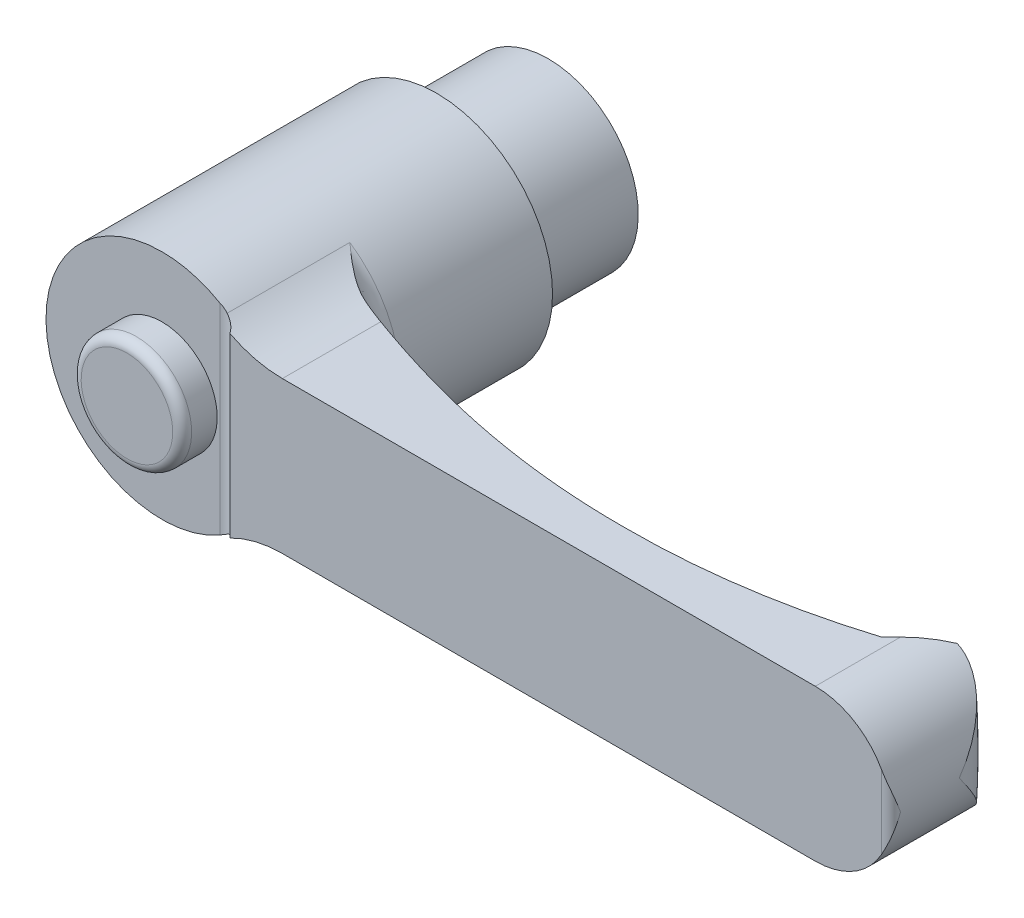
ISO-10303-21;
HEADER;
FILE_DESCRIPTION(('STEP AP214'),'2;1');
FILE_NAME('part.step','',(''),(''),'','','');
FILE_SCHEMA(('AUTOMOTIVE_DESIGN { 1 0 10303 214 1 1 1 1 }'));
ENDSEC;
DATA;
#1=APPLICATION_CONTEXT('core data for automotive mechanical design processes');
#2=APPLICATION_PROTOCOL_DEFINITION('international standard','automotive_design',2000,#1);
#3=PRODUCT_CONTEXT('',#1,'mechanical');
#4=PRODUCT('Part','Part','',(#3));
#5=PRODUCT_RELATED_PRODUCT_CATEGORY('part','',(#4));
#6=PRODUCT_DEFINITION_FORMATION('','',#4);
#7=PRODUCT_DEFINITION_CONTEXT('part definition',#1,'design');
#8=PRODUCT_DEFINITION('design','',#6,#7);
#9=PRODUCT_DEFINITION_SHAPE('','',#8);
#10=(LENGTH_UNIT() NAMED_UNIT(*) SI_UNIT(.MILLI.,.METRE.));
#11=(NAMED_UNIT(*) PLANE_ANGLE_UNIT() SI_UNIT($,.RADIAN.));
#12=(NAMED_UNIT(*) SI_UNIT($,.STERADIAN.) SOLID_ANGLE_UNIT());
#13=UNCERTAINTY_MEASURE_WITH_UNIT(LENGTH_MEASURE(1.E-05),#10,'distance_accuracy_value','');
#14=(GEOMETRIC_REPRESENTATION_CONTEXT(3) GLOBAL_UNCERTAINTY_ASSIGNED_CONTEXT((#13)) GLOBAL_UNIT_ASSIGNED_CONTEXT((#10,
#11,#12)) REPRESENTATION_CONTEXT('',''));
#15=CARTESIAN_POINT('',(0.,0.,0.));
#16=DIRECTION('',(0.,0.,1.));
#17=DIRECTION('',(1.,0.,0.));
#18=AXIS2_PLACEMENT_3D('',#15,#16,#17);
#19=CARTESIAN_POINT('',(0.,0.,20.));
#20=DIRECTION('',(0.,0.,-1.));
#21=DIRECTION('',(-1.,0.,0.));
#22=AXIS2_PLACEMENT_3D('',#19,#20,#21);
#23=PLANE('',#22);
#24=CARTESIAN_POINT('',(0.,0.,20.));
#25=DIRECTION('',(0.,0.,-1.));
#26=DIRECTION('',(-1.,0.,0.));
#27=AXIS2_PLACEMENT_3D('',#24,#25,#26);
#28=CIRCLE('',#27,5.);
#29=CARTESIAN_POINT('',(-5.,0.,20.));
#30=VERTEX_POINT('',#29);
#31=EDGE_CURVE('E419',#30,#30,#28,.T.);
#32=ORIENTED_EDGE('',*,*,#31,.T.);
#33=EDGE_LOOP('',(#32));
#34=FACE_BOUND('',#33,.T.);
#35=ADVANCED_FACE('F14',(#34),#23,.T.);
#36=CARTESIAN_POINT('',(7.6,0.,0.));
#37=DIRECTION('',(0.,0.,1.));
#38=DIRECTION('',(0.,-1.,0.));
#39=AXIS2_PLACEMENT_3D('',#36,#37,#38);
#40=PLANE('',#39);
#41=CARTESIAN_POINT('',(0.,0.,0.));
#42=DIRECTION('',(0.,0.,-1.));
#43=DIRECTION('',(0.,1.,0.));
#44=AXIS2_PLACEMENT_3D('',#41,#42,#43);
#45=CIRCLE('',#44,5.);
#46=CARTESIAN_POINT('',(0.,5.,0.));
#47=VERTEX_POINT('',#46);
#48=EDGE_CURVE('E416',#47,#47,#45,.T.);
#49=ORIENTED_EDGE('',*,*,#48,.F.);
#50=EDGE_LOOP('',(#49));
#51=FACE_BOUND('',#50,.T.);
#52=CARTESIAN_POINT('',(0.,0.,0.));
#53=DIRECTION('',(0.,0.,-1.));
#54=DIRECTION('',(0.,1.,0.));
#55=AXIS2_PLACEMENT_3D('',#52,#53,#54);
#56=CIRCLE('',#55,7.6);
#57=CARTESIAN_POINT('',(0.,7.6,0.));
#58=VERTEX_POINT('',#57);
#59=EDGE_CURVE('E341',#58,#58,#56,.T.);
#60=ORIENTED_EDGE('',*,*,#59,.T.);
#61=EDGE_LOOP('',(#60));
#62=FACE_BOUND('',#61,.T.);
#63=ADVANCED_FACE('F439',(#51,#62),#40,.F.);
#64=CARTESIAN_POINT('',(0.,0.,41.));
#65=DIRECTION('',(0.,0.,-1.));
#66=DIRECTION('',(0.,1.,0.));
#67=AXIS2_PLACEMENT_3D('',#64,#65,#66);
#68=PLANE('',#67);
#69=DIRECTION('',(0.,1.,0.));
#70=VECTOR('',#69,1.);
#71=CARTESIAN_POINT('',(6.125,-16.,41.));
#72=LINE('',#71,#70);
#73=CARTESIAN_POINT('',(6.125,-10.6088111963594,41.));
#74=VERTEX_POINT('',#73);
#75=CARTESIAN_POINT('',(6.125,10.6088111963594,41.));
#76=VERTEX_POINT('',#75);
#77=EDGE_CURVE('E379',#74,#76,#72,.T.);
#78=ORIENTED_EDGE('',*,*,#77,.T.);
#79=CARTESIAN_POINT('',(0.,0.,41.));
#80=DIRECTION('',(0.,0.,-1.));
#81=DIRECTION('',(0.,1.,0.));
#82=AXIS2_PLACEMENT_3D('',#79,#80,#81);
#83=CIRCLE('',#82,12.25);
#84=EDGE_CURVE('E326',#74,#76,#83,.T.);
#85=ORIENTED_EDGE('',*,*,#84,.F.);
#86=EDGE_LOOP('',(#78,#85));
#87=FACE_BOUND('',#86,.T.);
#88=CARTESIAN_POINT('',(0.,0.,41.));
#89=DIRECTION('',(0.,0.,-1.));
#90=DIRECTION('',(0.,1.,0.));
#91=AXIS2_PLACEMENT_3D('',#88,#89,#90);
#92=CIRCLE('',#91,5.83333333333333);
#93=CARTESIAN_POINT('',(0.,5.83333333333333,41.));
#94=VERTEX_POINT('',#93);
#95=EDGE_CURVE('E9',#94,#94,#92,.F.);
#96=ORIENTED_EDGE('',*,*,#95,.F.);
#97=EDGE_LOOP('',(#96));
#98=FACE_BOUND('',#97,.T.);
#99=ADVANCED_FACE('F16',(#87,#98),#68,.F.);
#100=CARTESIAN_POINT('',(70.,0.,0.));
#101=DIRECTION('',(0.,0.,1.));
#102=DIRECTION('',(0.,-1.,0.));
#103=AXIS2_PLACEMENT_3D('',#100,#101,#102);
#104=CYLINDRICAL_SURFACE('',#103,8.);
#105=CARTESIAN_POINT('',(78.,0.,34.8));
#106=CARTESIAN_POINT('',(78.0000000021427,-0.00507455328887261,34.7962762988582));
#107=CARTESIAN_POINT('',(77.9999951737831,-0.0101492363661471,34.7925524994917));
#108=CARTESIAN_POINT('',(77.9989416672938,-0.563628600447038,34.3864095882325));
#109=CARTESIAN_POINT('',(77.9414802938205,-1.11346566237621,33.9829298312));
#110=CARTESIAN_POINT('',(77.7692220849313,-1.92787753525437,33.38939297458));
#111=CARTESIAN_POINT('',(77.697249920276,-2.19810314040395,33.1931504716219));
#112=CARTESIAN_POINT('',(77.5237934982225,-2.73341157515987,32.8066637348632));
#113=CARTESIAN_POINT('',(77.4223242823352,-2.99849695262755,32.6164164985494));
#114=CARTESIAN_POINT('',(77.2199237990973,-3.45210642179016,32.2938177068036));
#115=CARTESIAN_POINT('',(77.1259458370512,-3.64233939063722,32.1594598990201));
#116=CARTESIAN_POINT('',(76.9211711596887,-4.01785016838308,31.8966888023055));
#117=CARTESIAN_POINT('',(76.8103745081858,-4.20312799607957,31.7682754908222));
#118=CARTESIAN_POINT('',(76.5717542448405,-4.56719869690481,31.5191542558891));
#119=CARTESIAN_POINT('',(76.4439640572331,-4.74600344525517,31.3984318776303));
#120=CARTESIAN_POINT('',(76.1708976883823,-5.09601175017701,31.1663364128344));
#121=CARTESIAN_POINT('',(76.0256268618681,-5.26721761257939,31.0549604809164));
#122=CARTESIAN_POINT('',(75.6441829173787,-5.67932922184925,30.7937387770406));
#123=CARTESIAN_POINT('',(75.3974573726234,-5.9150123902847,30.6505327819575));
#124=CARTESIAN_POINT('',(74.9987611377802,-6.24839682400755,30.4615945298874));
#125=CARTESIAN_POINT('',(74.8611020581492,-6.35616332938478,30.4029292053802));
#126=CARTESIAN_POINT('',(74.5764070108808,-6.56410843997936,30.2956150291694));
#127=CARTESIAN_POINT('',(74.429373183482,-6.66428876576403,30.2469639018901));
#128=CARTESIAN_POINT('',(74.1592544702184,-6.83522850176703,30.1705684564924));
#129=CARTESIAN_POINT('',(74.0378615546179,-6.90766708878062,30.1405781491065));
#130=CARTESIAN_POINT('',(73.7901015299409,-7.04665102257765,30.0886005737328));
#131=CARTESIAN_POINT('',(73.6637356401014,-7.11319780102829,30.0666113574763));
#132=CARTESIAN_POINT('',(73.4066843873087,-7.23982141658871,30.0315221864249));
#133=CARTESIAN_POINT('',(73.2760017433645,-7.2999022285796,30.0184167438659));
#134=CARTESIAN_POINT('',(73.0110423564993,-7.41312181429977,30.0019547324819));
#135=CARTESIAN_POINT('',(72.8767656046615,-7.46626057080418,29.9985981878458));
#136=CARTESIAN_POINT('',(72.6044130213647,-7.56559501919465,30.0024862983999));
#137=CARTESIAN_POINT('',(72.4663137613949,-7.6117232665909,30.009827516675));
#138=CARTESIAN_POINT('',(72.1887878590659,-7.69611880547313,30.0360283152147));
#139=CARTESIAN_POINT('',(72.0493611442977,-7.73438566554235,30.0548885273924));
#140=CARTESIAN_POINT('',(71.770740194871,-7.80288648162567,30.1046814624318));
#141=CARTESIAN_POINT('',(71.6315458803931,-7.83312431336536,30.1356083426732));
#142=CARTESIAN_POINT('',(71.3550409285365,-7.885663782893,30.2098119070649));
#143=CARTESIAN_POINT('',(71.217729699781,-7.90796796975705,30.2530846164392));
#144=CARTESIAN_POINT('',(70.8920238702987,-7.95241951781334,30.3719934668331));
#145=CARTESIAN_POINT('',(70.7052564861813,-7.97090772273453,30.4536477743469));
#146=CARTESIAN_POINT('',(70.433708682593,-7.98875485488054,30.5937624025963));
#147=CARTESIAN_POINT('',(70.3445710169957,-7.99305594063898,30.6434445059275));
#148=CARTESIAN_POINT('',(70.1696001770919,-7.99868029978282,30.7485120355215));
#149=CARTESIAN_POINT('',(70.0837676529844,-8.00000299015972,30.8038985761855));
#150=CARTESIAN_POINT('',(69.9998,-7.9999999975,30.8620428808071));
#151=B_SPLINE_CURVE_WITH_KNOTS('',3,(#105,#106,#107,#108,#109,#110,#111,#112,#113,#114,#115,
#116,#117,#118,#119,#120,#121,#122,#123,#124,#125,#126,#127,#128,#129,#130,#131,#132,#133,#134,
#135,#136,#137,#138,#139,#140,#141,#142,#143,#144,#145,#146,#147,#148,#149,#150),.UNSPECIFIED.,
.F.,.F.,(4,2,2,2,2,2,2,2,2,2,2,2,2,2,2,2,2,2,2,2,2,2,4),(0.,0.0188831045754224,2.05946970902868,
3.08347088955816,4.10695081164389,4.85978230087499,5.6126109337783,6.36398015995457,
7.11511980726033,8.22062566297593,8.77332293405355,9.32589447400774,9.75904172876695,
10.1920834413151,10.624857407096,11.0576324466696,11.4943381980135,11.9310679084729,
12.3675864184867,12.8039645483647,13.4155655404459,13.721767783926,14.0280299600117),.UNSPECIFIED.);
#152=CARTESIAN_POINT('',(72.9968893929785,-7.41745603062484,30.0031106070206));
#153=VERTEX_POINT('',#152);
#154=CARTESIAN_POINT('',(78.,0.,34.8));
#155=VERTEX_POINT('',#154);
#156=EDGE_CURVE('E126',#153,#155,#151,.F.);
#157=ORIENTED_EDGE('',*,*,#156,.T.);
#158=CARTESIAN_POINT('',(78.,0.,34.8));
#159=CARTESIAN_POINT('',(78.0000000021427,0.00507455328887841,34.7962762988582));
#160=CARTESIAN_POINT('',(77.9999951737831,0.0101492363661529,34.7925524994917));
#161=CARTESIAN_POINT('',(77.9989416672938,0.563628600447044,34.3864095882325));
#162=CARTESIAN_POINT('',(77.9414802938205,1.11346566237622,33.9829298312));
#163=CARTESIAN_POINT('',(77.7692220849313,1.92787753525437,33.38939297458));
#164=CARTESIAN_POINT('',(77.697249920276,2.19810314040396,33.1931504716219));
#165=CARTESIAN_POINT('',(77.5237934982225,2.73341157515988,32.8066637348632));
#166=CARTESIAN_POINT('',(77.4223242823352,2.99849695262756,32.6164164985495));
#167=CARTESIAN_POINT('',(77.2199237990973,3.45210642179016,32.2938177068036));
#168=CARTESIAN_POINT('',(77.1259458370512,3.64233939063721,32.1594598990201));
#169=CARTESIAN_POINT('',(76.9211711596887,4.01785016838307,31.8966888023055));
#170=CARTESIAN_POINT('',(76.8103745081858,4.20312799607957,31.7682754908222));
#171=CARTESIAN_POINT('',(76.5717542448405,4.56719869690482,31.5191542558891));
#172=CARTESIAN_POINT('',(76.4439640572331,4.74600344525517,31.3984318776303));
#173=CARTESIAN_POINT('',(76.1708976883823,5.09601175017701,31.1663364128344));
#174=CARTESIAN_POINT('',(76.0256268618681,5.26721761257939,31.0549604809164));
#175=CARTESIAN_POINT('',(75.6441829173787,5.67932922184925,30.7937387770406));
#176=CARTESIAN_POINT('',(75.3974573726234,5.91501239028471,30.6505327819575));
#177=CARTESIAN_POINT('',(74.9987611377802,6.24839682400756,30.4615945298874));
#178=CARTESIAN_POINT('',(74.8611020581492,6.35616332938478,30.4029292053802));
#179=CARTESIAN_POINT('',(74.5764070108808,6.56410843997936,30.2956150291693));
#180=CARTESIAN_POINT('',(74.429373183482,6.66428876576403,30.2469639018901));
#181=CARTESIAN_POINT('',(74.1592544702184,6.83522850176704,30.1705684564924));
#182=CARTESIAN_POINT('',(74.0378615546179,6.90766708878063,30.1405781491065));
#183=CARTESIAN_POINT('',(73.7901015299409,7.04665102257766,30.0886005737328));
#184=CARTESIAN_POINT('',(73.6637356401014,7.11319780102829,30.0666113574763));
#185=CARTESIAN_POINT('',(73.4066843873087,7.23982141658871,30.0315221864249));
#186=CARTESIAN_POINT('',(73.2760017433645,7.2999022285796,30.0184167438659));
#187=CARTESIAN_POINT('',(73.0110423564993,7.41312181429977,30.0019547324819));
#188=CARTESIAN_POINT('',(72.8767656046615,7.46626057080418,29.9985981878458));
#189=CARTESIAN_POINT('',(72.6044130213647,7.56559501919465,30.0024862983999));
#190=CARTESIAN_POINT('',(72.4663137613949,7.61172326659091,30.009827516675));
#191=CARTESIAN_POINT('',(72.1887878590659,7.69611880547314,30.0360283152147));
#192=CARTESIAN_POINT('',(72.0493611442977,7.73438566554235,30.0548885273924));
#193=CARTESIAN_POINT('',(71.770740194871,7.80288648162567,30.1046814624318));
#194=CARTESIAN_POINT('',(71.6315458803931,7.83312431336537,30.1356083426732));
#195=CARTESIAN_POINT('',(71.3550409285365,7.885663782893,30.2098119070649));
#196=CARTESIAN_POINT('',(71.217729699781,7.90796796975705,30.2530846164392));
#197=CARTESIAN_POINT('',(70.8920238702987,7.95241951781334,30.3719934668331));
#198=CARTESIAN_POINT('',(70.7052564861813,7.97090772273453,30.4536477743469));
#199=CARTESIAN_POINT('',(70.433708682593,7.98875485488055,30.5937624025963));
#200=CARTESIAN_POINT('',(70.3445710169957,7.99305594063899,30.6434445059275));
#201=CARTESIAN_POINT('',(70.1696001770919,7.99868029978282,30.7485120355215));
#202=CARTESIAN_POINT('',(70.0837676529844,8.00000299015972,30.8038985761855));
#203=CARTESIAN_POINT('',(69.9998,7.9999999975,30.8620428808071));
#204=B_SPLINE_CURVE_WITH_KNOTS('',3,(#158,#159,#160,#161,#162,#163,#164,#165,#166,#167,#168,
#169,#170,#171,#172,#173,#174,#175,#176,#177,#178,#179,#180,#181,#182,#183,#184,#185,#186,#187,
#188,#189,#190,#191,#192,#193,#194,#195,#196,#197,#198,#199,#200,#201,#202,#203),.UNSPECIFIED.,
.F.,.F.,(4,2,2,2,2,2,2,2,2,2,2,2,2,2,2,2,2,2,2,2,2,2,4),(0.,0.0188831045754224,2.05946970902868,
3.08347088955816,4.10695081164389,4.85978230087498,5.61261093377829,6.36398015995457,
7.11511980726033,8.22062566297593,8.77332293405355,9.32589447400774,9.75904172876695,
10.1920834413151,10.6248574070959,11.0576324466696,11.4943381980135,11.9310679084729,
12.3675864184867,12.8039645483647,13.4155655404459,13.721767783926,14.0280299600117),.UNSPECIFIED.);
#205=CARTESIAN_POINT('',(72.9968893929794,7.41745603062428,30.0031106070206));
#206=VERTEX_POINT('',#205);
#207=EDGE_CURVE('E123',#155,#206,#204,.T.);
#208=ORIENTED_EDGE('',*,*,#207,.T.);
#209=CARTESIAN_POINT('',(70.,0.,33.));
#210=DIRECTION('',(-0.707106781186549,0.,-0.707106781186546));
#211=DIRECTION('',(-0.707106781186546,0.,0.707106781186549));
#212=AXIS2_PLACEMENT_3D('',#209,#210,#211);
#213=ELLIPSE('',#212,11.3137084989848,8.);
#214=CARTESIAN_POINT('',(70.,8.,33.));
#215=VERTEX_POINT('',#214);
#216=EDGE_CURVE('E372',#206,#215,#213,.F.);
#217=ORIENTED_EDGE('',*,*,#216,.T.);
#218=DIRECTION('',(0.,0.,1.));
#219=VECTOR('',#218,1.);
#220=CARTESIAN_POINT('',(70.,8.,0.));
#221=LINE('',#220,#219);
#222=CARTESIAN_POINT('',(70.,8.,42.));
#223=VERTEX_POINT('',#222);
#224=EDGE_CURVE('E348',#215,#223,#221,.T.);
#225=ORIENTED_EDGE('',*,*,#224,.T.);
#226=CARTESIAN_POINT('',(70.,0.,42.));
#227=DIRECTION('',(0.,0.,1.));
#228=DIRECTION('',(0.,-1.,0.));
#229=AXIS2_PLACEMENT_3D('',#226,#227,#228);
#230=CIRCLE('',#229,8.);
#231=CARTESIAN_POINT('',(77.,3.87298334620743,42.));
#232=VERTEX_POINT('',#231);
#233=EDGE_CURVE('E321',#232,#223,#230,.T.);
#234=ORIENTED_EDGE('',*,*,#233,.F.);
#235=CARTESIAN_POINT('',(77.,3.87298334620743,42.));
#236=CARTESIAN_POINT('',(77.0320487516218,3.8150611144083,41.9999909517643));
#237=CARTESIAN_POINT('',(77.0633658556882,3.75675902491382,41.9984605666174));
#238=CARTESIAN_POINT('',(77.1244803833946,3.63952511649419,41.99269833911));
#239=CARTESIAN_POINT('',(77.1542784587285,3.58059358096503,41.9884676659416));
#240=CARTESIAN_POINT('',(77.241218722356,3.40324230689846,41.9722589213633));
#241=CARTESIAN_POINT('',(77.2960525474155,3.28400247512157,41.9567609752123));
#242=CARTESIAN_POINT('',(77.3991566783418,3.04456972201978,41.9185214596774));
#243=CARTESIAN_POINT('',(77.4474555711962,2.9243835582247,41.8958129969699));
#244=CARTESIAN_POINT('',(77.5378429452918,2.68282861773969,41.8446429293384));
#245=CARTESIAN_POINT('',(77.5799268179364,2.56145903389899,41.8161770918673));
#246=CARTESIAN_POINT('',(77.6827368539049,2.24038507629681,41.7351721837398));
#247=CARTESIAN_POINT('',(77.7382927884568,2.03996193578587,41.6788382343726));
#248=CARTESIAN_POINT('',(77.8332865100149,1.63779800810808,41.55814944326));
#249=CARTESIAN_POINT('',(77.8727175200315,1.43605670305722,41.4937912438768));
#250=CARTESIAN_POINT('',(77.967421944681,0.829293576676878,41.2932012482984));
#251=CARTESIAN_POINT('',(77.999127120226,0.42266785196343,41.1494356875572));
#252=CARTESIAN_POINT('',(77.9999940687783,0.0112434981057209,41.0039751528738));
#253=CARTESIAN_POINT('',(77.9999999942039,0.00562166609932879,41.0019875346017));
#254=CARTESIAN_POINT('',(78.,0.,41.));
#255=B_SPLINE_CURVE_WITH_KNOTS('',3,(#235,#236,#237,#238,#239,#240,#241,#242,#243,#244,#245,
#246,#247,#248,#249,#250,#251,#252,#253,#254),.UNSPECIFIED.,.F.,.F.,(4,2,2,2,2,2,2,2,2,4),(0.,
0.198535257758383,0.396984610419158,0.792983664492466,1.18719018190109,1.5816875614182,
2.22713013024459,2.8728436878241,4.16406208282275,4.18195063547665),.UNSPECIFIED.);
#256=CARTESIAN_POINT('',(78.,0.,41.));
#257=VERTEX_POINT('',#256);
#258=EDGE_CURVE('E178',#257,#232,#255,.F.);
#259=ORIENTED_EDGE('',*,*,#258,.F.);
#260=CARTESIAN_POINT('',(77.,-3.87298334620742,42.));
#261=CARTESIAN_POINT('',(77.0320487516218,-3.81506111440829,41.9999909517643));
#262=CARTESIAN_POINT('',(77.0633658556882,-3.75675902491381,41.9984605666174));
#263=CARTESIAN_POINT('',(77.1244803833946,-3.63952511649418,41.99269833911));
#264=CARTESIAN_POINT('',(77.1542784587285,-3.58059358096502,41.9884676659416));
#265=CARTESIAN_POINT('',(77.241218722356,-3.40324230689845,41.9722589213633));
#266=CARTESIAN_POINT('',(77.2960525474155,-3.28400247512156,41.9567609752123));
#267=CARTESIAN_POINT('',(77.3991566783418,-3.04456972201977,41.9185214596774));
#268=CARTESIAN_POINT('',(77.4474555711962,-2.92438355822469,41.8958129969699));
#269=CARTESIAN_POINT('',(77.5378429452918,-2.68282861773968,41.8446429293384));
#270=CARTESIAN_POINT('',(77.5799268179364,-2.56145903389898,41.8161770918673));
#271=CARTESIAN_POINT('',(77.6827368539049,-2.2403850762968,41.7351721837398));
#272=CARTESIAN_POINT('',(77.7382927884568,-2.03996193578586,41.6788382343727));
#273=CARTESIAN_POINT('',(77.8332865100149,-1.63779800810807,41.55814944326));
#274=CARTESIAN_POINT('',(77.8727175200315,-1.43605670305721,41.4937912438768));
#275=CARTESIAN_POINT('',(77.967421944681,-0.829293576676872,41.2932012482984));
#276=CARTESIAN_POINT('',(77.999127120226,-0.422667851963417,41.1494356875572));
#277=CARTESIAN_POINT('',(77.9999940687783,-0.0112434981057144,41.0039751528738));
#278=CARTESIAN_POINT('',(77.9999999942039,-0.00562166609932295,41.0019875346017));
#279=CARTESIAN_POINT('',(78.,0.,41.));
#280=B_SPLINE_CURVE_WITH_KNOTS('',3,(#260,#261,#262,#263,#264,#265,#266,#267,#268,#269,#270,
#271,#272,#273,#274,#275,#276,#277,#278,#279),.UNSPECIFIED.,.F.,.F.,(4,2,2,2,2,2,2,2,2,4),(0.,
0.19853525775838,0.396984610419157,0.792983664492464,1.18719018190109,1.5816875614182,
2.2271301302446,2.8728436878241,4.16406208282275,4.18195063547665),.UNSPECIFIED.);
#281=CARTESIAN_POINT('',(77.,-3.87298334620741,42.));
#282=VERTEX_POINT('',#281);
#283=EDGE_CURVE('E22',#282,#257,#280,.T.);
#284=ORIENTED_EDGE('',*,*,#283,.F.);
#285=CARTESIAN_POINT('',(70.,-8.,42.));
#286=VERTEX_POINT('',#285);
#287=EDGE_CURVE('E316',#286,#282,#230,.T.);
#288=ORIENTED_EDGE('',*,*,#287,.F.);
#289=DIRECTION('',(0.,0.,1.));
#290=VECTOR('',#289,1.);
#291=CARTESIAN_POINT('',(70.,-8.,0.));
#292=LINE('',#291,#290);
#293=CARTESIAN_POINT('',(70.,-8.,33.));
#294=VERTEX_POINT('',#293);
#295=EDGE_CURVE('E351',#294,#286,#292,.T.);
#296=ORIENTED_EDGE('',*,*,#295,.F.);
#297=EDGE_CURVE('E137',#294,#153,#213,.F.);
#298=ORIENTED_EDGE('',*,*,#297,.T.);
#299=EDGE_LOOP('',(#157,#208,#217,#225,#234,#259,#284,#288,#296,#298));
#300=FACE_BOUND('',#299,.T.);
#301=ADVANCED_FACE('F135',(#300),#104,.T.);
#302=CARTESIAN_POINT('',(73.,-16.,30.));
#303=DIRECTION('',(-0.707106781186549,0.,-0.707106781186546));
#304=DIRECTION('',(0.707106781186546,0.,-0.707106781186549));
#305=AXIS2_PLACEMENT_3D('',#302,#303,#304);
#306=PLANE('',#305);
#307=DIRECTION('',(0.,1.,0.));
#308=VECTOR('',#307,1.);
#309=CARTESIAN_POINT('',(73.,-16.,30.));
#310=LINE('',#309,#308);
#311=CARTESIAN_POINT('',(73.,-5.40740233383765,30.));
#312=VERTEX_POINT('',#311);
#313=CARTESIAN_POINT('',(73.,5.40740233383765,30.));
#314=VERTEX_POINT('',#313);
#315=EDGE_CURVE('E391',#312,#314,#310,.T.);
#316=ORIENTED_EDGE('',*,*,#315,.F.);
#317=CARTESIAN_POINT('',(72.9944134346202,8.0002,30.0055865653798));
#318=CARTESIAN_POINT('',(72.9964174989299,7.60019527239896,30.0035825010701));
#319=CARTESIAN_POINT('',(72.9977626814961,7.20018596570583,30.0022373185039));
#320=CARTESIAN_POINT('',(72.9994970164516,6.40016550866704,30.0005029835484));
#321=CARTESIAN_POINT('',(72.9998861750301,6.00015435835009,30.0001138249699));
#322=CARTESIAN_POINT('',(73.0000702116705,5.20013335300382,29.9999297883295));
#323=CARTESIAN_POINT('',(72.9998650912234,4.80012349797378,30.0001349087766));
#324=CARTESIAN_POINT('',(72.9991717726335,4.00010369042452,30.0008282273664));
#325=CARTESIAN_POINT('',(72.998683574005,3.60009373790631,30.001316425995));
#326=CARTESIAN_POINT('',(72.9972116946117,2.40006658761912,30.0027883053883));
#327=CARTESIAN_POINT('',(72.9962207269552,1.60004928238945,30.0037792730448));
#328=CARTESIAN_POINT('',(72.9954610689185,1.3601944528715E-05,30.0045389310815));
#329=CARTESIAN_POINT('',(72.9956923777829,-0.800004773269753,30.004307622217));
#330=CARTESIAN_POINT('',(72.9968584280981,-2.13336982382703,30.0031415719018));
#331=CARTESIAN_POINT('',(72.9975329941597,-2.66671710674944,30.0024670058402));
#332=CARTESIAN_POINT('',(72.9988528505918,-3.73341119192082,30.0011471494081));
#333=CARTESIAN_POINT('',(72.999498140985,-4.26675799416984,30.000501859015));
#334=CARTESIAN_POINT('',(73.000124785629,-5.33345534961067,29.999875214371));
#335=CARTESIAN_POINT('',(73.0001061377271,-5.86680590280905,29.9998938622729));
#336=CARTESIAN_POINT('',(72.9985813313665,-6.93350631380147,30.0014186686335));
#337=CARTESIAN_POINT('',(72.997075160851,-7.46685617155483,30.002924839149));
#338=CARTESIAN_POINT('',(72.9944134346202,-8.0002,30.0055865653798));
#339=B_SPLINE_CURVE_WITH_KNOTS('',3,(#317,#318,#319,#320,#321,#322,#323,#324,#325,#326,#327,
#328,#329,#330,#331,#332,#333,#334,#335,#336,#337,#338),.UNSPECIFIED.,.F.,.F.,(4,2,2,2,2,2,2,2,
2,2,4),(0.,1.20004037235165,2.40007297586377,3.60010256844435,4.80013422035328,7.20018907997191,
9.60024245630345,11.2002867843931,12.8003298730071,14.4003781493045,16.0004393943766),.UNSPECIFIED.);
#340=EDGE_CURVE('E138',#312,#153,#339,.T.);
#341=ORIENTED_EDGE('',*,*,#340,.T.);
#342=ORIENTED_EDGE('',*,*,#297,.F.);
#343=DIRECTION('',(-0.707106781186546,0.,0.707106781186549));
#344=VECTOR('',#343,1.);
#345=CARTESIAN_POINT('',(86.5,-8.,16.5));
#346=LINE('',#345,#344);
#347=CARTESIAN_POINT('',(69.,-8.,34.));
#348=VERTEX_POINT('',#347);
#349=EDGE_CURVE('E315',#294,#348,#346,.T.);
#350=ORIENTED_EDGE('',*,*,#349,.T.);
#351=DIRECTION('',(0.,1.,0.));
#352=VECTOR('',#351,1.);
#353=CARTESIAN_POINT('',(69.,-16.,34.));
#354=LINE('',#353,#352);
#355=CARTESIAN_POINT('',(69.,8.,34.));
#356=VERTEX_POINT('',#355);
#357=EDGE_CURVE('E313',#348,#356,#354,.T.);
#358=ORIENTED_EDGE('',*,*,#357,.T.);
#359=DIRECTION('',(0.707106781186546,0.,-0.707106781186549));
#360=VECTOR('',#359,1.);
#361=CARTESIAN_POINT('',(58.3567940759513,8.,44.6432059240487));
#362=LINE('',#361,#360);
#363=EDGE_CURVE('E369',#356,#215,#362,.T.);
#364=ORIENTED_EDGE('',*,*,#363,.T.);
#365=ORIENTED_EDGE('',*,*,#216,.F.);
#366=EDGE_CURVE('E129',#206,#314,#339,.T.);
#367=ORIENTED_EDGE('',*,*,#366,.T.);
#368=EDGE_LOOP('',(#316,#341,#342,#350,#358,#364,#365,#367));
#369=FACE_BOUND('',#368,.T.);
#370=ADVANCED_FACE('F162',(#369),#306,.T.);
#371=CARTESIAN_POINT('',(73.2,-16.,30.));
#372=DIRECTION('',(0.,0.,-1.));
#373=DIRECTION('',(0.,1.,0.));
#374=AXIS2_PLACEMENT_3D('',#371,#372,#373);
#375=PLANE('',#374);
#376=ORIENTED_EDGE('',*,*,#315,.T.);
#377=CARTESIAN_POINT('',(0.,0.,30.));
#378=DIRECTION('',(0.,0.,-1.));
#379=DIRECTION('',(0.,1.,0.));
#380=AXIS2_PLACEMENT_3D('',#377,#378,#379);
#381=CIRCLE('',#380,73.2);
#382=EDGE_CURVE('E36',#314,#312,#381,.T.);
#383=ORIENTED_EDGE('',*,*,#382,.T.);
#384=EDGE_LOOP('',(#376,#383));
#385=FACE_BOUND('',#384,.T.);
#386=ADVANCED_FACE('F196',(#385),#375,.T.);
#387=CARTESIAN_POINT('',(0.,0.,42.));
#388=DIRECTION('',(0.,0.,1.));
#389=DIRECTION('',(0.,-1.,0.));
#390=AXIS2_PLACEMENT_3D('',#387,#388,#389);
#391=PLANE('',#390);
#392=CARTESIAN_POINT('',(13.7135881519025,20.,42.));
#393=DIRECTION('',(0.,0.,1.));
#394=DIRECTION('',(1.,0.,0.));
#395=AXIS2_PLACEMENT_3D('',#392,#393,#394);
#396=CIRCLE('',#395,12.);
#397=CARTESIAN_POINT('',(8.16666666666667,9.35896330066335,42.));
#398=VERTEX_POINT('',#397);
#399=CARTESIAN_POINT('',(13.7135881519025,8.,42.));
#400=VERTEX_POINT('',#399);
#401=EDGE_CURVE('E366',#398,#400,#396,.T.);
#402=ORIENTED_EDGE('',*,*,#401,.F.);
#403=DIRECTION('',(0.,1.,0.));
#404=VECTOR('',#403,1.);
#405=CARTESIAN_POINT('',(8.16666666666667,-16.,42.));
#406=LINE('',#405,#404);
#407=CARTESIAN_POINT('',(8.16666666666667,-9.35896330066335,42.));
#408=VERTEX_POINT('',#407);
#409=EDGE_CURVE('E386',#408,#398,#406,.T.);
#410=ORIENTED_EDGE('',*,*,#409,.F.);
#411=CARTESIAN_POINT('',(13.7135881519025,-20.,42.));
#412=DIRECTION('',(0.,0.,1.));
#413=DIRECTION('',(1.,0.,0.));
#414=AXIS2_PLACEMENT_3D('',#411,#412,#413);
#415=CIRCLE('',#414,12.);
#416=CARTESIAN_POINT('',(13.7135881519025,-8.,42.));
#417=VERTEX_POINT('',#416);
#418=EDGE_CURVE('E357',#417,#408,#415,.T.);
#419=ORIENTED_EDGE('',*,*,#418,.F.);
#420=DIRECTION('',(-1.,0.,0.));
#421=VECTOR('',#420,1.);
#422=CARTESIAN_POINT('',(70.,-8.,42.));
#423=LINE('',#422,#421);
#424=EDGE_CURVE('E360',#286,#417,#423,.T.);
#425=ORIENTED_EDGE('',*,*,#424,.F.);
#426=ORIENTED_EDGE('',*,*,#287,.T.);
#427=DIRECTION('',(0.,1.,0.));
#428=VECTOR('',#427,1.);
#429=CARTESIAN_POINT('',(77.,-16.,42.));
#430=LINE('',#429,#428);
#431=EDGE_CURVE('E387',#282,#232,#430,.T.);
#432=ORIENTED_EDGE('',*,*,#431,.T.);
#433=ORIENTED_EDGE('',*,*,#233,.T.);
#434=DIRECTION('',(1.,0.,0.));
#435=VECTOR('',#434,1.);
#436=CARTESIAN_POINT('',(13.7135881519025,8.,42.));
#437=LINE('',#436,#435);
#438=EDGE_CURVE('E363',#400,#223,#437,.T.);
#439=ORIENTED_EDGE('',*,*,#438,.F.);
#440=EDGE_LOOP('',(#402,#410,#419,#425,#426,#432,#433,#439));
#441=FACE_BOUND('',#440,.T.);
#442=ADVANCED_FACE('F242',(#441),#391,.T.);
#443=CARTESIAN_POINT('',(0.,0.,0.));
#444=DIRECTION('',(0.,0.,-1.));
#445=DIRECTION('',(0.,1.,0.));
#446=AXIS2_PLACEMENT_3D('',#443,#444,#445);
#447=CYLINDRICAL_SURFACE('',#446,12.25);
#448=CARTESIAN_POINT('',(0.,0.,28.0779919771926));
#449=DIRECTION('',(0.,0.,-1.));
#450=DIRECTION('',(0.,1.,0.));
#451=AXIS2_PLACEMENT_3D('',#448,#449,#450);
#452=CIRCLE('',#451,12.25);
#453=CARTESIAN_POINT('',(6.92748267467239,10.1030927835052,28.0779919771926));
#454=VERTEX_POINT('',#453);
#455=CARTESIAN_POINT('',(6.92748267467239,-10.1030927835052,28.0779919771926));
#456=VERTEX_POINT('',#455);
#457=EDGE_CURVE('E406',#454,#456,#452,.T.);
#458=ORIENTED_EDGE('',*,*,#457,.T.);
#459=DIRECTION('',(0.,0.,1.));
#460=VECTOR('',#459,1.);
#461=CARTESIAN_POINT('',(6.92748267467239,-10.1030927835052,0.));
#462=LINE('',#461,#460);
#463=CARTESIAN_POINT('',(6.92748267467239,-10.1030927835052,41.0427567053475));
#464=VERTEX_POINT('',#463);
#465=EDGE_CURVE('E355',#456,#464,#462,.T.);
#466=ORIENTED_EDGE('',*,*,#465,.T.);
#467=CARTESIAN_POINT('',(6.125,-10.6088111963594,41.));
#468=CARTESIAN_POINT('',(6.19832883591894,-10.5664875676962,40.9889897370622));
#469=CARTESIAN_POINT('',(6.27164451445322,-10.523132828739,40.9821479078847));
#470=CARTESIAN_POINT('',(6.41753908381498,-10.4347921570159,40.9764986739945));
#471=CARTESIAN_POINT('',(6.49011843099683,-10.3898073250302,40.9776859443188));
#472=CARTESIAN_POINT('',(6.63402897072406,-10.2985167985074,40.9877856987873));
#473=CARTESIAN_POINT('',(6.70535828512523,-10.2522093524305,40.996708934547));
#474=CARTESIAN_POINT('',(6.84611057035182,-10.1587605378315,41.0220012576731));
#475=CARTESIAN_POINT('',(6.91553331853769,-10.1116190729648,41.0383712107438));
#476=CARTESIAN_POINT('',(7.10641045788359,-9.97916014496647,41.094233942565));
#477=CARTESIAN_POINT('',(7.22525798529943,-9.89334730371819,41.1417583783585));
#478=CARTESIAN_POINT('',(7.45241295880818,-9.72337963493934,41.2589427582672));
#479=CARTESIAN_POINT('',(7.56074253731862,-9.63922163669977,41.3285548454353));
#480=CARTESIAN_POINT('',(7.71168483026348,-9.51821587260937,41.4479066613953));
#481=CARTESIAN_POINT('',(7.75936397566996,-9.47936365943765,41.4893658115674));
#482=CARTESIAN_POINT('',(7.85125896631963,-9.40339173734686,41.5773725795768));
#483=CARTESIAN_POINT('',(7.89547657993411,-9.36627114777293,41.6239175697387));
#484=CARTESIAN_POINT('',(7.98020904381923,-9.29418452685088,41.7223463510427));
#485=CARTESIAN_POINT('',(8.02070494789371,-9.25922978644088,41.7742548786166));
#486=CARTESIAN_POINT('',(8.09722101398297,-9.19239515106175,41.8832605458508));
#487=CARTESIAN_POINT('',(8.13323329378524,-9.16052069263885,41.9403665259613));
#488=CARTESIAN_POINT('',(8.16666666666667,-9.13061090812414,42.));
#489=B_SPLINE_CURVE_WITH_KNOTS('',3,(#467,#468,#469,#470,#471,#472,#473,#474,#475,#476,#477,
#478,#479,#480,#481,#482,#483,#484,#485,#486,#487,#488),.UNSPECIFIED.,.F.,.F.,(4,2,2,2,2,2,2,2,
2,2,4),(0.,0.255975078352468,0.511780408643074,0.767941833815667,1.02413304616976,
1.48441304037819,1.94370248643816,2.16599787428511,2.38817894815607,2.61143478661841,
2.83507772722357),.UNSPECIFIED.);
#490=EDGE_CURVE('E217',#74,#464,#489,.T.);
#491=ORIENTED_EDGE('',*,*,#490,.F.);
#492=ORIENTED_EDGE('',*,*,#84,.T.);
#493=CARTESIAN_POINT('',(8.16666666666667,9.13061090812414,42.));
#494=CARTESIAN_POINT('',(8.13602850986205,9.15801692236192,41.9453523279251));
#495=CARTESIAN_POINT('',(8.10323346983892,9.18706943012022,41.8928397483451));
#496=CARTESIAN_POINT('',(8.03382107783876,9.24782874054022,41.7921703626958));
#497=CARTESIAN_POINT('',(7.99720910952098,9.27953179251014,41.7440075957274));
#498=CARTESIAN_POINT('',(7.88274220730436,9.37735907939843,41.6065497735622));
#499=CARTESIAN_POINT('',(7.79984772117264,9.44657197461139,41.5235775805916));
#500=CARTESIAN_POINT('',(7.62397737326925,9.58906879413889,41.3751924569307));
#501=CARTESIAN_POINT('',(7.53106018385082,9.66232791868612,41.3096843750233));
#502=CARTESIAN_POINT('',(7.33643153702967,9.81092784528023,41.1955319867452));
#503=CARTESIAN_POINT('',(7.23469620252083,9.88627389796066,41.1469353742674));
#504=CARTESIAN_POINT('',(7.00601089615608,10.0499435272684,41.0604339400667));
#505=CARTESIAN_POINT('',(6.87776073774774,10.1382349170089,41.0258797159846));
#506=CARTESIAN_POINT('',(6.61511692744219,10.3115145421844,40.9827504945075));
#507=CARTESIAN_POINT('',(6.48074133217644,10.3965112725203,40.9741035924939));
#508=CARTESIAN_POINT('',(6.30869788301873,10.5006996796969,40.9806991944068));
#509=CARTESIAN_POINT('',(6.27199131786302,10.5226640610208,40.9831161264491));
#510=CARTESIAN_POINT('',(6.19852568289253,10.5661055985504,40.9900077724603));
#511=CARTESIAN_POINT('',(6.16176668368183,10.5875831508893,40.9944807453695));
#512=CARTESIAN_POINT('',(6.125,10.6088111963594,41.));
#513=B_SPLINE_CURVE_WITH_KNOTS('',3,(#493,#494,#495,#496,#497,#498,#499,#500,#501,#502,#503,
#504,#505,#506,#507,#508,#509,#510,#511,#512),.UNSPECIFIED.,.F.,.F.,(4,2,2,2,2,2,2,2,2,4),(0.,
0.204930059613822,0.409574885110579,0.816210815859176,1.22058373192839,1.62608799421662,
2.10242753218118,2.57744378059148,2.7059409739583,2.83432955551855),.UNSPECIFIED.);
#514=CARTESIAN_POINT('',(6.92748267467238,10.1030927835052,41.0427567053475));
#515=VERTEX_POINT('',#514);
#516=EDGE_CURVE('E230',#515,#76,#513,.T.);
#517=ORIENTED_EDGE('',*,*,#516,.F.);
#518=DIRECTION('',(0.,0.,1.));
#519=VECTOR('',#518,1.);
#520=CARTESIAN_POINT('',(6.92748267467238,10.1030927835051,0.));
#521=LINE('',#520,#519);
#522=EDGE_CURVE('E344',#454,#515,#521,.T.);
#523=ORIENTED_EDGE('',*,*,#522,.F.);
#524=EDGE_LOOP('',(#458,#466,#491,#492,#517,#523));
#525=FACE_BOUND('',#524,.T.);
#526=CARTESIAN_POINT('',(0.,0.,12.));
#527=DIRECTION('',(0.,0.,-1.));
#528=DIRECTION('',(0.,1.,0.));
#529=AXIS2_PLACEMENT_3D('',#526,#527,#528);
#530=CIRCLE('',#529,12.25);
#531=CARTESIAN_POINT('',(0.,12.25,12.));
#532=VERTEX_POINT('',#531);
#533=EDGE_CURVE('E329',#532,#532,#530,.T.);
#534=ORIENTED_EDGE('',*,*,#533,.F.);
#535=EDGE_LOOP('',(#534));
#536=FACE_BOUND('',#535,.T.);
#537=ADVANCED_FACE('F240',(#525,#536),#447,.T.);
#538=CARTESIAN_POINT('',(13.7135881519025,20.,0.));
#539=DIRECTION('',(0.,0.,1.));
#540=DIRECTION('',(0.,-1.,0.));
#541=AXIS2_PLACEMENT_3D('',#538,#539,#540);
#542=CYLINDRICAL_SURFACE('',#541,12.);
#543=DIRECTION('',(0.,0.,1.));
#544=VECTOR('',#543,1.);
#545=CARTESIAN_POINT('',(13.7135881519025,8.,0.));
#546=LINE('',#545,#544);
#547=CARTESIAN_POINT('',(13.7135881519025,8.,31.611749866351));
#548=VERTEX_POINT('',#547);
#549=EDGE_CURVE('E346',#548,#400,#546,.T.);
#550=ORIENTED_EDGE('',*,*,#549,.F.);
#551=CARTESIAN_POINT('',(16.5591435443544,8.34226374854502,32.6591102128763));
#552=CARTESIAN_POINT('',(16.3261928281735,8.28540329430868,32.5722424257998));
#553=CARTESIAN_POINT('',(16.0917373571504,8.23557224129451,32.4848250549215));
#554=CARTESIAN_POINT('',(15.6204190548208,8.15004770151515,32.3095064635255));
#555=CARTESIAN_POINT('',(15.3835560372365,8.11435531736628,32.2216052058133));
#556=CARTESIAN_POINT('',(14.9085098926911,8.05724969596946,32.0461136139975));
#557=CARTESIAN_POINT('',(14.6703300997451,8.03580964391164,31.9585230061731));
#558=CARTESIAN_POINT('',(14.1928153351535,8.00718735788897,31.7842679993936));
#559=CARTESIAN_POINT('',(13.9534804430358,8.00000415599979,31.697603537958));
#560=CARTESIAN_POINT('',(13.3222890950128,7.99999321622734,31.4717100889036));
#561=CARTESIAN_POINT('',(12.9298365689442,8.01913869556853,31.3339527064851));
#562=CARTESIAN_POINT('',(12.1446747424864,8.09645283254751,31.0677464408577));
#563=CARTESIAN_POINT('',(11.7519664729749,8.15469870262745,30.9393165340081));
#564=CARTESIAN_POINT('',(11.0678445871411,8.29148603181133,30.7286186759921));
#565=CARTESIAN_POINT('',(10.7757440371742,8.36126529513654,30.6428547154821));
#566=CARTESIAN_POINT('',(10.1944299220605,8.52365043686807,30.4833757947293));
#567=CARTESIAN_POINT('',(9.90521727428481,8.61626334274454,30.4096645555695));
#568=CARTESIAN_POINT('',(9.33232622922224,8.82426158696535,30.2779606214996));
#569=CARTESIAN_POINT('',(9.04863462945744,8.93958259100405,30.219924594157));
#570=CARTESIAN_POINT('',(8.48843633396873,9.19295718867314,30.1227055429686));
#571=CARTESIAN_POINT('',(8.21192433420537,9.33099341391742,30.0835082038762));
#572=CARTESIAN_POINT('',(7.70530850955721,9.60902203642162,30.0304308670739));
#573=CARTESIAN_POINT('',(7.47397220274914,9.74624410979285,30.0138509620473));
#574=CARTESIAN_POINT('',(7.13386740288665,9.96379307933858,30.0017184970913));
#575=CARTESIAN_POINT('',(7.0215618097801,10.0383265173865,29.9998008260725));
#576=CARTESIAN_POINT('',(6.79949902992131,10.1911494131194,30.0002323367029));
#577=CARTESIAN_POINT('',(6.68974254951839,10.2694398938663,30.0025826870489));
#578=CARTESIAN_POINT('',(6.5813815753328,10.3495269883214,30.007070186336));
#579=B_SPLINE_CURVE_WITH_KNOTS('',3,(#551,#552,#553,#554,#555,#556,#557,#558,#559,#560,#561,
#562,#563,#564,#565,#566,#567,#568,#569,#570,#571,#572,#573,#574,#575,#576,#577,#578),
.UNSPECIFIED.,.F.,.F.,(4,2,2,2,2,2,2,2,2,2,2,2,2,4),(0.,0.765007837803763,1.53007532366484,
2.29369928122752,3.05727139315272,4.30444442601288,5.55408755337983,6.49010923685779,
7.42641935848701,8.36011402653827,9.29309806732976,10.100354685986,10.5046318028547,
10.9090196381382),.UNSPECIFIED.);
#580=CARTESIAN_POINT('',(11.361472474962,8.23277637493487,30.8190510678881));
#581=VERTEX_POINT('',#580);
#582=EDGE_CURVE('E256',#548,#581,#579,.T.);
#583=ORIENTED_EDGE('',*,*,#582,.T.);
#584=CARTESIAN_POINT('',(14.1569924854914,8.00819477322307,30.9010555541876));
#585=CARTESIAN_POINT('',(14.0595029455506,8.00457612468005,30.9322196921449));
#586=CARTESIAN_POINT('',(13.9606253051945,8.00212380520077,30.9590151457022));
#587=CARTESIAN_POINT('',(13.7610637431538,7.99968329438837,31.004218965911));
#588=CARTESIAN_POINT('',(13.6603822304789,7.99969203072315,31.0226377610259));
#589=CARTESIAN_POINT('',(13.4585847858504,8.00228706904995,31.0514218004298));
#590=CARTESIAN_POINT('',(13.3574757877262,8.00485682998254,31.061837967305));
#591=CARTESIAN_POINT('',(13.1548462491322,8.01258614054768,31.0753001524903));
#592=CARTESIAN_POINT('',(13.053325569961,8.01774665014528,31.0783434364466));
#593=CARTESIAN_POINT('',(12.8251352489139,8.0322613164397,31.0774805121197));
#594=CARTESIAN_POINT('',(12.6985166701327,8.04234092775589,31.07164895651));
#595=CARTESIAN_POINT('',(12.446446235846,8.06641586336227,31.0503579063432));
#596=CARTESIAN_POINT('',(12.3209952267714,8.08041382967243,31.0348919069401));
#597=CARTESIAN_POINT('',(11.9473264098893,8.12804907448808,30.9756133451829));
#598=CARTESIAN_POINT('',(11.7017310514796,8.16733172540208,30.9189189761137));
#599=CARTESIAN_POINT('',(11.4284283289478,8.21954129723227,30.8393902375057));
#600=CARTESIAN_POINT('',(11.3952261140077,8.22603104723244,30.829444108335));
#601=CARTESIAN_POINT('',(11.1613640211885,8.27276596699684,30.7574361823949));
#602=CARTESIAN_POINT('',(10.9642103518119,8.31751135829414,30.6865405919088));
#603=CARTESIAN_POINT('',(10.5777285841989,8.41525886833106,30.5303701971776));
#604=CARTESIAN_POINT('',(10.3884095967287,8.46827027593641,30.4450792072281));
#605=CARTESIAN_POINT('',(10.0168146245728,8.5819543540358,30.262829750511));
#606=CARTESIAN_POINT('',(9.83457244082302,8.64265900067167,30.1658226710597));
#607=CARTESIAN_POINT('',(9.47767438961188,8.77088665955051,29.9630240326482));
#608=CARTESIAN_POINT('',(9.30301613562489,8.83840750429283,29.8572352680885));
#609=CARTESIAN_POINT('',(8.93248691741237,8.99147577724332,29.6209801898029));
#610=CARTESIAN_POINT('',(8.73785326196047,9.07816138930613,29.4893172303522));
#611=CARTESIAN_POINT('',(8.35703282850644,9.25980318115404,29.2196101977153));
#612=CARTESIAN_POINT('',(8.17084790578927,9.35476116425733,29.0815647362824));
#613=CARTESIAN_POINT('',(7.80639286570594,9.55261034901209,28.801722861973));
#614=CARTESIAN_POINT('',(7.62810747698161,9.65548508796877,28.6599346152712));
#615=CARTESIAN_POINT('',(7.27822148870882,9.8694475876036,28.3744148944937));
#616=CARTESIAN_POINT('',(7.10661929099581,9.98053336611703,28.2306838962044));
#617=CARTESIAN_POINT('',(6.93448645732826,10.0982931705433,28.0839649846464));
#618=CARTESIAN_POINT('',(6.93098392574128,10.1006920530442,28.0809784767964));
#619=CARTESIAN_POINT('',(6.92748267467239,10.1030927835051,28.0779919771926));
#620=B_SPLINE_CURVE_WITH_KNOTS('',3,(#584,#585,#586,#587,#588,#589,#590,#591,#592,#593,#594,
#595,#596,#597,#598,#599,#600,#601,#602,#603,#604,#605,#606,#607,#608,#609,#610,#611,#612,#613,
#614,#615,#616,#617,#618,#619),.UNSPECIFIED.,.F.,.F.,(4,2,2,2,2,2,2,2,2,2,2,2,2,2,2,2,2,4),(0.,
0.307060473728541,0.613737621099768,0.918446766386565,1.2232689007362,1.60421628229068,
1.98542114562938,2.74764704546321,2.85344139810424,3.49502286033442,4.13733056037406,
4.78240133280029,5.42726761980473,6.17822336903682,6.9293432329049,7.67894130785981,
8.42835901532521,8.44393060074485),.UNSPECIFIED.);
#621=EDGE_CURVE('E247',#581,#454,#620,.T.);
#622=ORIENTED_EDGE('',*,*,#621,.T.);
#623=ORIENTED_EDGE('',*,*,#522,.T.);
#624=CARTESIAN_POINT('',(8.16666666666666,9.35896330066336,42.));
#625=CARTESIAN_POINT('',(8.13901649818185,9.37337657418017,41.9506476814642));
#626=CARTESIAN_POINT('',(8.10940958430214,9.3889470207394,41.9027481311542));
#627=CARTESIAN_POINT('',(8.04670483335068,9.42230209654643,41.8101553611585));
#628=CARTESIAN_POINT('',(8.01360925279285,9.44008529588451,41.7654600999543));
#629=CARTESIAN_POINT('',(7.9445192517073,9.47767235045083,41.679768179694));
#630=CARTESIAN_POINT('',(7.90854324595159,9.49746355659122,41.6387511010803));
#631=CARTESIAN_POINT('',(7.83394241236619,9.53904426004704,41.5603078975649));
#632=CARTESIAN_POINT('',(7.79531727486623,9.56083399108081,41.522882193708));
#633=CARTESIAN_POINT('',(7.67627287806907,9.628928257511,41.4163832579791));
#634=CARTESIAN_POINT('',(7.59246475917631,9.67807605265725,41.3528199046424));
#635=CARTESIAN_POINT('',(7.41892619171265,9.78297864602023,41.2409217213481));
#636=CARTESIAN_POINT('',(7.32918731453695,9.83874294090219,41.1926091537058));
#637=CARTESIAN_POINT('',(7.1868076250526,9.93000297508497,41.1289842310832));
#638=CARTESIAN_POINT('',(7.13520490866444,9.96362930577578,41.1085023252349));
#639=CARTESIAN_POINT('',(7.03159838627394,10.0323084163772,41.072203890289));
#640=CARTESIAN_POINT('',(6.97959668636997,10.0673556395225,41.0563708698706));
#641=CARTESIAN_POINT('',(6.92748267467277,10.1030927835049,41.0427567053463));
#642=B_SPLINE_CURVE_WITH_KNOTS('',3,(#624,#625,#626,#627,#628,#629,#630,#631,#632,#633,#634,
#635,#636,#637,#638,#639,#640,#641),.UNSPECIFIED.,.F.,.F.,(4,2,2,2,2,2,2,2,4),(0.,
0.17504734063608,0.349982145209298,0.52387635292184,0.697790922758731,1.04453417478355,
1.39178126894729,1.58634089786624,1.78020177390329),.UNSPECIFIED.);
#643=EDGE_CURVE('E224',#398,#515,#642,.T.);
#644=ORIENTED_EDGE('',*,*,#643,.F.);
#645=ORIENTED_EDGE('',*,*,#401,.T.);
#646=EDGE_LOOP('',(#550,#583,#622,#623,#644,#645));
#647=FACE_BOUND('',#646,.T.);
#648=ADVANCED_FACE('F236',(#647),#542,.F.);
#649=CARTESIAN_POINT('',(13.7135881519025,8.,0.));
#650=DIRECTION('',(0.,-1.,0.));
#651=DIRECTION('',(1.,0.,0.));
#652=AXIS2_PLACEMENT_3D('',#649,#650,#651);
#653=PLANE('',#652);
#654=CARTESIAN_POINT('',(45.7315011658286,8.,-40.4484852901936));
#655=DIRECTION('',(0.,-1.,0.));
#656=DIRECTION('',(1.,0.,0.));
#657=AXIS2_PLACEMENT_3D('',#654,#655,#656);
#658=CIRCLE('',#657,78.);
#659=CARTESIAN_POINT('',(45.3816329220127,8.00000000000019,37.5507300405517));
#660=VERTEX_POINT('',#659);
#661=EDGE_CURVE('E373',#660,#356,#658,.F.);
#662=ORIENTED_EDGE('',*,*,#661,.F.);
#663=CARTESIAN_POINT('',(41.2013215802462,8.,37.4608030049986));
#664=CARTESIAN_POINT('',(39.9809181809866,8.,37.4029725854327));
#665=CARTESIAN_POINT('',(38.761796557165,8.,37.3175877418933));
#666=CARTESIAN_POINT('',(36.3285638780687,8.,37.0925358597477));
#667=CARTESIAN_POINT('',(35.1144529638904,8.,36.9528673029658));
#668=CARTESIAN_POINT('',(32.6938673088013,8.,36.620494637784));
#669=CARTESIAN_POINT('',(31.4873906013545,8.,36.4278048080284));
#670=CARTESIAN_POINT('',(29.0837615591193,8.,35.9910366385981));
#671=CARTESIAN_POINT('',(27.8866092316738,8.,35.7469582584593));
#672=CARTESIAN_POINT('',(26.0963309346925,8.,35.3434938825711));
#673=CARTESIAN_POINT('',(25.4990195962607,8.,35.2023884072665));
#674=CARTESIAN_POINT('',(24.307345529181,8.,34.9082411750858));
#675=CARTESIAN_POINT('',(23.7129827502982,8.,34.7551996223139));
#676=CARTESIAN_POINT('',(22.5273511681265,8.,34.4376835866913));
#677=CARTESIAN_POINT('',(21.9360822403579,8.,34.2732095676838));
#678=CARTESIAN_POINT('',(20.7566633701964,8.,33.9334464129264));
#679=CARTESIAN_POINT('',(20.168513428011,8.,33.7581572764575));
#680=CARTESIAN_POINT('',(18.9953081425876,8.,33.3975573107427));
#681=CARTESIAN_POINT('',(18.410252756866,8.,33.2122466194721));
#682=CARTESIAN_POINT('',(17.2430689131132,8.,32.8326229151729));
#683=CARTESIAN_POINT('',(16.6609404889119,8.,32.6383097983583));
#684=CARTESIAN_POINT('',(15.4992827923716,8.,32.2420388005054));
#685=CARTESIAN_POINT('',(14.9197535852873,8.,32.0400807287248));
#686=CARTESIAN_POINT('',(13.7627551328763,8.,31.6303639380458));
#687=CARTESIAN_POINT('',(13.1852858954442,8.,31.4226051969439));
#688=CARTESIAN_POINT('',(12.2105601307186,8.,31.068884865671));
#689=CARTESIAN_POINT('',(11.8129994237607,8.,30.9237570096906));
#690=CARTESIAN_POINT('',(11.01801083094,8.,30.6331667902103));
#691=CARTESIAN_POINT('',(10.6205829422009,8.,30.4877044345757));
#692=CARTESIAN_POINT('',(9.82504247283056,8.,30.1978593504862));
#693=CARTESIAN_POINT('',(9.42692961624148,8.,30.0534773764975));
#694=CARTESIAN_POINT('',(8.62956030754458,8.,29.7678970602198));
#695=CARTESIAN_POINT('',(8.23030386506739,8.,29.6266986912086));
#696=CARTESIAN_POINT('',(7.434658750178,8.,29.3518607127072));
#697=CARTESIAN_POINT('',(7.03829494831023,8.,29.2181496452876));
#698=CARTESIAN_POINT('',(6.24250909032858,8.,28.9598804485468));
#699=CARTESIAN_POINT('',(5.84308667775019,8.,28.8353234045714));
#700=CARTESIAN_POINT('',(5.04058284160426,8.,28.6000350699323));
#701=CARTESIAN_POINT('',(4.63750557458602,8.,28.4892897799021));
#702=CARTESIAN_POINT('',(3.82651409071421,8.,28.287230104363));
#703=CARTESIAN_POINT('',(3.41860155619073,8.,28.1959091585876));
#704=CARTESIAN_POINT('',(2.77898962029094,8.,28.0738229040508));
#705=CARTESIAN_POINT('',(2.54899380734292,8.,28.0341217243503));
#706=CARTESIAN_POINT('',(2.08758367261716,8.,27.9639460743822));
#707=CARTESIAN_POINT('',(1.85616936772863,8.,27.9334714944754));
#708=CARTESIAN_POINT('',(1.39234110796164,8.,27.8827533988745));
#709=CARTESIAN_POINT('',(1.15992777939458,8.,27.8625042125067));
#710=CARTESIAN_POINT('',(0.694402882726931,8.,27.832938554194));
#711=CARTESIAN_POINT('',(0.461291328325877,8.,27.8236218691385));
#712=CARTESIAN_POINT('',(-0.00577358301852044,8.,27.81626587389));
#713=CARTESIAN_POINT('',(-0.239727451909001,8.,27.8182586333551));
#714=CARTESIAN_POINT('',(-0.707274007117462,8.,27.8335186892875));
#715=CARTESIAN_POINT('',(-0.940866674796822,8.,27.8467865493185));
#716=CARTESIAN_POINT('',(-1.40721975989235,8.,27.8841006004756));
#717=CARTESIAN_POINT('',(-1.63998003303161,8.,27.9081485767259));
#718=CARTESIAN_POINT('',(-2.10419851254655,8.,27.9661729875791));
#719=CARTESIAN_POINT('',(-2.33565694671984,8.,28.0001476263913));
#720=CARTESIAN_POINT('',(-2.97420169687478,8.,28.1064680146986));
#721=CARTESIAN_POINT('',(-3.37972262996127,8.,28.1882492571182));
#722=CARTESIAN_POINT('',(-4.18592396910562,8.,28.3731628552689));
#723=CARTESIAN_POINT('',(-4.58660185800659,8.,28.4763058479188));
#724=CARTESIAN_POINT('',(-5.38438882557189,8.,28.6981904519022));
#725=CARTESIAN_POINT('',(-5.78148949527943,8.,28.8169618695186));
#726=CARTESIAN_POINT('',(-6.57226220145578,8.,29.0650744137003));
#727=CARTESIAN_POINT('',(-6.96593476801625,8.,29.1944138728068));
#728=CARTESIAN_POINT('',(-7.75322419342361,8.,29.4607078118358));
#729=CARTESIAN_POINT('',(-8.14682745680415,8.,29.597702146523));
#730=CARTESIAN_POINT('',(-8.93259934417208,8.,29.8757469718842));
#731=CARTESIAN_POINT('',(-9.32476793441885,8.,30.0167975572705));
#732=CARTESIAN_POINT('',(-10.108000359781,8.,30.300645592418));
#733=CARTESIAN_POINT('',(-10.4990649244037,8.,30.4434410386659));
#734=CARTESIAN_POINT('',(-11.2810912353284,8.,30.7292982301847));
#735=CARTESIAN_POINT('',(-11.6720529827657,8.,30.8723599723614));
#736=CARTESIAN_POINT('',(-12.4604268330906,8.,31.1597298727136));
#737=CARTESIAN_POINT('',(-12.857844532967,8.,31.3040227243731));
#738=CARTESIAN_POINT('',(-13.6534067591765,8.,31.5905970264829));
#739=CARTESIAN_POINT('',(-14.051551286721,8.,31.7328784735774));
#740=CARTESIAN_POINT('',(-14.8489307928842,8.,32.0146765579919));
#741=CARTESIAN_POINT('',(-15.2481660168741,8.,32.1541925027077));
#742=CARTESIAN_POINT('',(-16.0478157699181,8.,32.4298018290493));
#743=CARTESIAN_POINT('',(-16.4482302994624,8.,32.5658952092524));
#744=CARTESIAN_POINT('',(-17.6492782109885,8.,32.967534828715));
#745=CARTESIAN_POINT('',(-18.4518884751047,8.,33.2272148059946));
#746=CARTESIAN_POINT('',(-20.062907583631,8.,33.7279015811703));
#747=CARTESIAN_POINT('',(-20.871316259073,8.,33.9689089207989));
#748=CARTESIAN_POINT('',(-22.2651511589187,8.,34.3651668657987));
#749=CARTESIAN_POINT('',(-22.8491532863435,8.,34.5254312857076));
#750=CARTESIAN_POINT('',(-24.0201231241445,8.,34.8347340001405));
#751=CARTESIAN_POINT('',(-24.6070908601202,8.,34.9837721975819));
#752=CARTESIAN_POINT('',(-26.3723282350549,8.,35.4133385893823));
#753=CARTESIAN_POINT('',(-27.5549313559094,8.,35.6763183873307));
#754=CARTESIAN_POINT('',(-29.9310593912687,8.,36.1528528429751));
#755=CARTESIAN_POINT('',(-31.1245924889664,8.,36.3663666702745));
#756=CARTESIAN_POINT('',(-33.5197648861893,8.,36.7417992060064));
#757=CARTESIAN_POINT('',(-34.7214041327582,8.,36.9037182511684));
#758=CARTESIAN_POINT('',(-37.1345480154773,8.,37.1750363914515));
#759=CARTESIAN_POINT('',(-38.3460719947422,8.,37.2842637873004));
#760=CARTESIAN_POINT('',(-40.7728077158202,8.,37.4484491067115));
#761=CARTESIAN_POINT('',(-41.9880194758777,8.,37.5034067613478));
#762=CARTESIAN_POINT('',(-44.4195958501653,8.,37.558389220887));
#763=CARTESIAN_POINT('',(-45.6359603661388,8.,37.5584183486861));
#764=CARTESIAN_POINT('',(-48.0674333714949,8.,37.5031457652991));
#765=CARTESIAN_POINT('',(-49.2825418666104,8.,37.4478443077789));
#766=CARTESIAN_POINT('',(-51.6852618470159,8.,37.283339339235));
#767=CARTESIAN_POINT('',(-52.8729469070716,8.,37.1752095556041));
#768=CARTESIAN_POINT('',(-55.2423682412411,8.,36.9055520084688));
#769=CARTESIAN_POINT('',(-56.4241038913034,8.,36.7440187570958));
#770=CARTESIAN_POINT('',(-58.7789436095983,8.,36.3677286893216));
#771=CARTESIAN_POINT('',(-59.9520485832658,8.,36.152977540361));
#772=CARTESIAN_POINT('',(-62.2874481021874,8.,35.670516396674));
#773=CARTESIAN_POINT('',(-63.4497415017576,8.,35.4028008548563));
#774=CARTESIAN_POINT('',(-65.7567345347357,8.,34.8159414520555));
#775=CARTESIAN_POINT('',(-66.9014830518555,8.,34.4969897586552));
#776=CARTESIAN_POINT('',(-69.1753518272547,8.,33.8075267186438));
#777=CARTESIAN_POINT('',(-70.3044720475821,8.,33.4370152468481));
#778=CARTESIAN_POINT('',(-72.544681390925,8.,32.6451401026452));
#779=CARTESIAN_POINT('',(-73.6557712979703,8.,32.2237786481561));
#780=CARTESIAN_POINT('',(-75.857653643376,8.,31.3309987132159));
#781=CARTESIAN_POINT('',(-76.9484462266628,8.,30.85958059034));
#782=CARTESIAN_POINT('',(-79.034727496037,8.,29.9010302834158));
#783=CARTESIAN_POINT('',(-80.0316867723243,8.,29.4170952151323));
#784=CARTESIAN_POINT('',(-82.0042428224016,8.,28.4072861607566));
#785=CARTESIAN_POINT('',(-82.9798378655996,8.,27.8814087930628));
#786=CARTESIAN_POINT('',(-84.9076630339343,8.,26.7887492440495));
#787=CARTESIAN_POINT('',(-85.8598964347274,8.,26.2219728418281));
#788=CARTESIAN_POINT('',(-87.7394957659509,8.,25.0483937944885));
#789=CARTESIAN_POINT('',(-88.6668593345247,8.,24.4415873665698));
#790=CARTESIAN_POINT('',(-90.4960328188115,8.,23.1883197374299));
#791=CARTESIAN_POINT('',(-91.3978106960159,8.,22.5418117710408));
#792=CARTESIAN_POINT('',(-93.1730809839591,8.,21.2108978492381));
#793=CARTESIAN_POINT('',(-94.0465706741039,8.,20.5264882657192));
#794=CARTESIAN_POINT('',(-95.7635177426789,8.,19.1210970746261));
#795=CARTESIAN_POINT('',(-96.6069776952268,8.,18.4001186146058));
#796=CARTESIAN_POINT('',(-98.2624140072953,8.,16.922839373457));
#797=CARTESIAN_POINT('',(-99.0743874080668,8.,16.1665352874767));
#798=CARTESIAN_POINT('',(-101.445256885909,8.,13.8617444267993));
#799=CARTESIAN_POINT('',(-102.956221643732,8.,12.2633517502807));
#800=CARTESIAN_POINT('',(-105.837524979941,8.,8.94488909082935));
#801=CARTESIAN_POINT('',(-107.20786508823,8.,7.22482043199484));
#802=CARTESIAN_POINT('',(-109.797743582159,8.,3.67584521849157));
#803=CARTESIAN_POINT('',(-111.017354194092,8.,1.84699141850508));
#804=CARTESIAN_POINT('',(-113.297700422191,8.,-1.90719990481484));
#805=CARTESIAN_POINT('',(-114.358435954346,8.,-3.83253747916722));
#806=CARTESIAN_POINT('',(-116.311018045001,8.,-7.76112230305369));
#807=CARTESIAN_POINT('',(-117.203273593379,8.,-9.76416627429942));
#808=CARTESIAN_POINT('',(-118.815729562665,8.,-13.8383453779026));
#809=CARTESIAN_POINT('',(-119.53593033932,8.,-15.9094803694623));
#810=CARTESIAN_POINT('',(-120.79920531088,8.,-20.1053701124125));
#811=CARTESIAN_POINT('',(-121.342256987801,8.,-22.2301316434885));
#812=CARTESIAN_POINT('',(-122.247220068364,8.,-26.5178865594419));
#813=CARTESIAN_POINT('',(-122.609131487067,8.,-28.6808799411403));
#814=CARTESIAN_POINT('',(-123.148944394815,8.,-33.0274417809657));
#815=CARTESIAN_POINT('',(-123.327035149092,8.,-35.210986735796));
#816=CARTESIAN_POINT('',(-123.498591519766,8.,-39.585316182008));
#817=CARTESIAN_POINT('',(-123.492057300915,8.,-41.7761006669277));
#818=CARTESIAN_POINT('',(-123.294410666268,8.,-46.1493274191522));
#819=CARTESIAN_POINT('',(-123.103298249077,8.,-48.3317696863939));
#820=CARTESIAN_POINT('',(-122.537860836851,8.,-52.6727901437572));
#821=CARTESIAN_POINT('',(-122.163535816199,8.,-54.8313683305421));
#822=CARTESIAN_POINT('',(-121.234422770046,8.,-59.1089663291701));
#823=CARTESIAN_POINT('',(-120.679663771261,8.,-61.227992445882));
#824=CARTESIAN_POINT('',(-119.393628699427,8.,-65.4117847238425));
#825=CARTESIAN_POINT('',(-118.662352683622,8.,-67.4765509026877));
#826=CARTESIAN_POINT('',(-117.028617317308,8.,-71.5368832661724));
#827=CARTESIAN_POINT('',(-116.126181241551,8.,-73.5324588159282));
#828=CARTESIAN_POINT('',(-114.156503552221,8.,-77.4405467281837));
#829=CARTESIAN_POINT('',(-113.089261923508,8.,-79.3530590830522));
#830=CARTESIAN_POINT('',(-110.797386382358,8.,-83.0817975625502));
#831=CARTESIAN_POINT('',(-109.572724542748,8.,-84.8980065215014));
#832=CARTESIAN_POINT('',(-106.974898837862,8.,-88.4209142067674));
#833=CARTESIAN_POINT('',(-105.601734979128,8.,-90.1276129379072));
#834=CARTESIAN_POINT('',(-102.716043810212,8.,-93.4201933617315));
#835=CARTESIAN_POINT('',(-101.203453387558,8.,-95.0060197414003));
#836=CARTESIAN_POINT('',(-98.0502415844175,8.,-98.0448134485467));
#837=CARTESIAN_POINT('',(-96.4096199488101,8.,-99.4977805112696));
#838=CARTESIAN_POINT('',(-93.0094106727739,8.,-102.262787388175));
#839=CARTESIAN_POINT('',(-91.2496439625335,8.,-103.574607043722));
#840=CARTESIAN_POINT('',(-87.6260782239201,8.,-106.045531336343));
#841=CARTESIAN_POINT('',(-85.7622793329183,8.,-107.204636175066));
#842=CARTESIAN_POINT('',(-81.9459395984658,8.,-109.360920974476));
#843=CARTESIAN_POINT('',(-79.9935099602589,8.,-110.358297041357));
#844=CARTESIAN_POINT('',(-77.0078484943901,8.,-111.728844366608));
#845=CARTESIAN_POINT('',(-76.002987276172,8.,-112.164823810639));
#846=CARTESIAN_POINT('',(-73.9759079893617,8.,-112.99429499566));
#847=CARTESIAN_POINT('',(-72.9536915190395,8.,-113.387790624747));
#848=CARTESIAN_POINT('',(-70.890916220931,8.,-114.132655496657));
#849=CARTESIAN_POINT('',(-69.850315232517,8.,-114.483907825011));
#850=CARTESIAN_POINT('',(-67.7553990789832,8.,-115.14246646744));
#851=CARTESIAN_POINT('',(-66.7010851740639,8.,-115.449776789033));
#852=CARTESIAN_POINT('',(-64.5804277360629,8.,-116.020041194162));
#853=CARTESIAN_POINT('',(-63.5140831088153,8.,-116.282991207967));
#854=CARTESIAN_POINT('',(-61.3714401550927,8.,-116.764102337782));
#855=CARTESIAN_POINT('',(-60.29514274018,8.,-116.982267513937));
#856=CARTESIAN_POINT('',(-58.1319341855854,8.,-117.374004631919));
#857=CARTESIAN_POINT('',(-57.0450044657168,8.,-117.54747395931));
#858=CARTESIAN_POINT('',(-54.8649626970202,8.,-117.848977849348));
#859=CARTESIAN_POINT('',(-53.7718512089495,8.,-117.97701646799));
#860=CARTESIAN_POINT('',(-51.58119396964,8.,-118.187619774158));
#861=CARTESIAN_POINT('',(-50.4836479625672,8.,-118.270181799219));
#862=CARTESIAN_POINT('',(-48.2861804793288,8.,-118.389867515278));
#863=CARTESIAN_POINT('',(-47.1862592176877,8.,-118.426995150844));
#864=CARTESIAN_POINT('',(-44.9763990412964,8.,-118.456132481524));
#865=CARTESIAN_POINT('',(-43.8664550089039,8.,-118.447753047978));
#866=CARTESIAN_POINT('',(-41.6479509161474,8.,-118.385316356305));
#867=CARTESIAN_POINT('',(-40.539390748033,8.,-118.331262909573));
#868=CARTESIAN_POINT('',(-38.3251645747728,8.,-118.177984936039));
#869=CARTESIAN_POINT('',(-37.2194992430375,8.,-118.078750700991));
#870=CARTESIAN_POINT('',(-35.0130734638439,8.,-117.835843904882));
#871=CARTESIAN_POINT('',(-33.9123130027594,8.,-117.692171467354));
#872=CARTESIAN_POINT('',(-31.7163075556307,8.,-117.361240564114));
#873=CARTESIAN_POINT('',(-30.6210687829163,8.,-117.173940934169));
#874=CARTESIAN_POINT('',(-28.4386526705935,8.,-116.757220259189));
#875=CARTESIAN_POINT('',(-27.351475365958,8.,-116.527799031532));
#876=CARTESIAN_POINT('',(-25.1876132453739,8.,-116.029015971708));
#877=CARTESIAN_POINT('',(-24.110917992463,8.,-115.759699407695));
#878=CARTESIAN_POINT('',(-22.5034932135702,8.,-115.327727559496));
#879=CARTESIAN_POINT('',(-21.9689549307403,8.,-115.179070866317));
#880=CARTESIAN_POINT('',(-20.9024220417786,8.,-114.872896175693));
#881=CARTESIAN_POINT('',(-20.3704274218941,8.,-114.715378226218));
#882=CARTESIAN_POINT('',(-19.082843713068,8.,-114.323156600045));
#883=CARTESIAN_POINT('',(-18.3285614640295,8.,-114.084160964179));
#884=CARTESIAN_POINT('',(-16.8248131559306,8.,-113.591440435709));
#885=CARTESIAN_POINT('',(-16.0753472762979,8.,-113.33771499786));
#886=CARTESIAN_POINT('',(-14.9527535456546,8.,-112.94801302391));
#887=CARTESIAN_POINT('',(-14.5781218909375,8.,-112.816337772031));
#888=CARTESIAN_POINT('',(-13.8296867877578,8.,-112.55065306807));
#889=CARTESIAN_POINT('',(-13.4558833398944,8.,-112.416643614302));
#890=CARTESIAN_POINT('',(-12.7089638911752,8.,-112.14699816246));
#891=CARTESIAN_POINT('',(-12.335847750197,8.,-112.011362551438));
#892=CARTESIAN_POINT('',(-11.5899077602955,8.,-111.739292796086));
#893=CARTESIAN_POINT('',(-11.2170839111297,8.,-111.60285865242));
#894=CARTESIAN_POINT('',(-10.479422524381,8.,-111.333246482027));
#895=CARTESIAN_POINT('',(-10.1145873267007,8.,-111.200062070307));
#896=CARTESIAN_POINT('',(-9.3843276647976,8.,-110.93529913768));
#897=CARTESIAN_POINT('',(-9.01890319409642,8.,-110.803720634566));
#898=CARTESIAN_POINT('',(-8.28647129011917,8.,-110.543745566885));
#899=CARTESIAN_POINT('',(-7.91946256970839,8.,-110.415352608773));
#900=CARTESIAN_POINT('',(-7.18353265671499,8.,-110.164145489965));
#901=CARTESIAN_POINT('',(-6.81461149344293,8.,-110.041331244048));
#902=CARTESIAN_POINT('',(-6.07673532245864,8.,-109.805079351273));
#903=CARTESIAN_POINT('',(-5.7078004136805,8.,-109.691579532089));
#904=CARTESIAN_POINT('',(-4.96633657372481,8.,-109.476629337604));
#905=CARTESIAN_POINT('',(-4.5938071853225,8.,-109.375180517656));
#906=CARTESIAN_POINT('',(-3.84531639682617,8.,-109.189083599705));
#907=CARTESIAN_POINT('',(-3.46936355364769,8.,-109.104401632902));
#908=CARTESIAN_POINT('',(-2.71327053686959,8.,-108.956783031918));
#909=CARTESIAN_POINT('',(-2.3331324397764,8.,-108.893836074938));
#910=CARTESIAN_POINT('',(-1.69248874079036,8.,-108.810602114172));
#911=CARTESIAN_POINT('',(-1.43291810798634,8.,-108.783104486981));
#912=CARTESIAN_POINT('',(-0.912633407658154,8.,-108.741521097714));
#913=CARTESIAN_POINT('',(-0.651919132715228,8.,-108.727437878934));
#914=CARTESIAN_POINT('',(-0.130028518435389,8.,-108.713360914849));
#915=CARTESIAN_POINT('',(0.131147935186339,8.,-108.713371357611));
#916=CARTESIAN_POINT('',(0.653102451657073,8.,-108.727489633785));
#917=CARTESIAN_POINT('',(0.913880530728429,8.,-108.741596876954));
#918=CARTESIAN_POINT('',(1.43451233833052,8.,-108.7832559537));
#919=CARTESIAN_POINT('',(1.69436538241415,8.,-108.810816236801));
#920=CARTESIAN_POINT('',(2.21245838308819,8.,-108.878187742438));
#921=CARTESIAN_POINT('',(2.47069827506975,8.,-108.91799945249));
#922=CARTESIAN_POINT('',(3.24290181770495,8.,-109.053603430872));
#923=CARTESIAN_POINT('',(3.75405102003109,8.,-109.165537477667));
#924=CARTESIAN_POINT('',(4.50831767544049,8.,-109.354397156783));
#925=CARTESIAN_POINT('',(4.75449112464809,8.,-109.419847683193));
#926=CARTESIAN_POINT('',(5.24522594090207,8.,-109.556586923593));
#927=CARTESIAN_POINT('',(5.48978731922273,8.,-109.627875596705));
#928=CARTESIAN_POINT('',(5.97738356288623,8.,-109.775075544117));
#929=CARTESIAN_POINT('',(6.22041904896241,8.,-109.850984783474));
#930=CARTESIAN_POINT('',(6.70532362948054,8.,-110.006446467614));
#931=CARTESIAN_POINT('',(6.94719270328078,8.,-110.085998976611));
#932=CARTESIAN_POINT('',(7.43069602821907,8.,-110.248123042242));
#933=CARTESIAN_POINT('',(7.67232754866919,8.,-110.330702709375));
#934=CARTESIAN_POINT('',(8.15486960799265,8.,-110.497933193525));
#935=CARTESIAN_POINT('',(8.39578015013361,8.,-110.582584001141));
#936=CARTESIAN_POINT('',(8.87712037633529,8.,-110.753358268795));
#937=CARTESIAN_POINT('',(9.11754997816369,8.,-110.839481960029));
#938=CARTESIAN_POINT('',(9.59806807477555,8.,-111.012679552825));
#939=CARTESIAN_POINT('',(9.83815656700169,8.,-111.099753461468));
#940=CARTESIAN_POINT('',(10.5593952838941,8.,-111.362187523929));
#941=CARTESIAN_POINT('',(11.0402671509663,8.,-111.538310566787));
#942=CARTESIAN_POINT('',(12.0022665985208,8.,-111.889861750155));
#943=CARTESIAN_POINT('',(12.4833941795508,8.,-112.065289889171));
#944=CARTESIAN_POINT('',(13.4465990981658,8.,-112.413507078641));
#945=CARTESIAN_POINT('',(13.928676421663,8.,-112.586296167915));
#946=CARTESIAN_POINT('',(14.89427793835,8.,-112.927791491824));
#947=CARTESIAN_POINT('',(15.3778021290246,8.,-113.096497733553));
#948=CARTESIAN_POINT('',(16.3464764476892,8.,-113.428685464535));
#949=CARTESIAN_POINT('',(16.8316260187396,8.,-113.592168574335));
#950=CARTESIAN_POINT('',(17.8039116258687,8.,-113.91312515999));
#951=CARTESIAN_POINT('',(18.2910476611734,8.,-114.070598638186));
#952=CARTESIAN_POINT('',(19.2674414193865,8.,-114.378879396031));
#953=CARTESIAN_POINT('',(19.7566991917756,8.,-114.529686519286));
#954=CARTESIAN_POINT('',(20.7373751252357,8.,-114.82410664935));
#955=CARTESIAN_POINT('',(21.2287933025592,8.,-114.967719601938));
#956=CARTESIAN_POINT('',(22.7037837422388,8.,-115.386389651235));
#957=CARTESIAN_POINT('',(23.6906178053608,8.,-115.650080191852));
#958=CARTESIAN_POINT('',(25.6725098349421,8.,-116.144501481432));
#959=CARTESIAN_POINT('',(26.6675677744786,8.,-116.37523233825));
#960=CARTESIAN_POINT('',(28.6655686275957,8.,-116.802054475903));
#961=CARTESIAN_POINT('',(29.6685148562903,8.,-116.998130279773));
#962=CARTESIAN_POINT('',(31.6807921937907,8.,-117.354196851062));
#963=CARTESIAN_POINT('',(32.6901232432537,8.,-117.514187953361));
#964=CARTESIAN_POINT('',(34.7240591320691,8.,-117.798519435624));
#965=CARTESIAN_POINT('',(35.7487159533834,8.,-117.922488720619));
#966=CARTESIAN_POINT('',(37.8019678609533,8.,-118.131868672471));
#967=CARTESIAN_POINT('',(38.830562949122,8.,-118.217279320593));
#968=CARTESIAN_POINT('',(40.8900801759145,8.,-118.348970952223));
#969=CARTESIAN_POINT('',(41.9210018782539,8.,-118.39525874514));
#970=CARTESIAN_POINT('',(43.9839387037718,8.,-118.448329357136));
#971=CARTESIAN_POINT('',(45.0159538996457,8.,-118.455109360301));
#972=CARTESIAN_POINT('',(47.0819889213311,8.,-118.428854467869));
#973=CARTESIAN_POINT('',(48.1160075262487,8.,-118.395722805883));
#974=CARTESIAN_POINT('',(50.1820560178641,8.,-118.289321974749));
#975=CARTESIAN_POINT('',(51.2140857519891,8.,-118.216049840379));
#976=CARTESIAN_POINT('',(53.2745889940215,8.,-118.029304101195));
#977=CARTESIAN_POINT('',(54.3030622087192,8.,-117.915827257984));
#978=CARTESIAN_POINT('',(56.3547866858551,8.,-117.648713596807));
#979=CARTESIAN_POINT('',(57.3780378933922,8.,-117.495076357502));
#980=CARTESIAN_POINT('',(59.5167730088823,8.,-117.130902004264));
#981=CARTESIAN_POINT('',(60.6315652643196,8.,-116.916288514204));
#982=CARTESIAN_POINT('',(62.8508702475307,8.,-116.439151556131));
#983=CARTESIAN_POINT('',(63.9553827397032,8.,-116.176626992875));
#984=CARTESIAN_POINT('',(66.1520234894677,8.,-115.604066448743));
#985=CARTESIAN_POINT('',(67.2441517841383,8.,-115.294030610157));
#986=CARTESIAN_POINT('',(69.4140568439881,8.,-114.626919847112));
#987=CARTESIAN_POINT('',(70.4918322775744,8.,-114.269840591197));
#988=CARTESIAN_POINT('',(72.630172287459,8.,-113.509524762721));
#989=CARTESIAN_POINT('',(73.690747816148,8.,-113.106318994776));
#990=CARTESIAN_POINT('',(75.7935088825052,8.,-112.254222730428));
#991=CARTESIAN_POINT('',(76.8356925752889,8.,-111.805327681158));
#992=CARTESIAN_POINT('',(78.8994462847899,8.,-110.862747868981));
#993=CARTESIAN_POINT('',(79.9210189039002,8.,-110.369068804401));
#994=CARTESIAN_POINT('',(81.9418308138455,8.,-109.337722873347));
#995=CARTESIAN_POINT('',(82.9410679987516,8.,-108.800051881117));
#996=CARTESIAN_POINT('',(84.8889399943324,8.,-107.696620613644));
#997=CARTESIAN_POINT('',(85.8382137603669,8.,-107.131988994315));
#998=CARTESIAN_POINT('',(87.7120125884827,8.,-105.963004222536));
#999=CARTESIAN_POINT('',(88.6365353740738,8.,-105.358647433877));
#1000=CARTESIAN_POINT('',(91.3702257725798,8.,-103.48766923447));
#1001=CARTESIAN_POINT('',(93.1400680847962,8.,-102.162826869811));
#1002=CARTESIAN_POINT('',(96.5609798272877,8.,-99.3678713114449));
#1003=CARTESIAN_POINT('',(98.2120365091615,8.,-97.8977425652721));
#1004=CARTESIAN_POINT('',(101.383515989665,8.,-94.8226316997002));
#1005=CARTESIAN_POINT('',(102.903938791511,8.,-93.2176495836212));
#1006=CARTESIAN_POINT('',(105.793833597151,8.,-89.8949654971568));
#1007=CARTESIAN_POINT('',(107.164199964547,8.,-88.178041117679));
#1008=CARTESIAN_POINT('',(109.755139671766,8.,-84.6346636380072));
#1009=CARTESIAN_POINT('',(110.975713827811,8.,-82.8082111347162));
#1010=CARTESIAN_POINT('',(113.258239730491,8.,-79.0588898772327));
#1011=CARTESIAN_POINT('',(114.3202006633,8.,-77.13602671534));
#1012=CARTESIAN_POINT('',(116.277963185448,8.,-73.2074926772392));
#1013=CARTESIAN_POINT('',(117.17376479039,8.,-71.2018218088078));
#1014=CARTESIAN_POINT('',(118.79113586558,8.,-67.1261200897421));
#1015=CARTESIAN_POINT('',(119.513054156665,8.,-65.0562276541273));
#1016=CARTESIAN_POINT('',(120.779831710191,8.,-60.8629554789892));
#1017=CARTESIAN_POINT('',(121.324691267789,8.,-58.7395758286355));
#1018=CARTESIAN_POINT('',(122.233458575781,8.,-54.4544205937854));
#1019=CARTESIAN_POINT('',(122.5973646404,8.,-52.2926446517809));
#1020=CARTESIAN_POINT('',(123.141613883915,8.,-47.9461074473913));
#1021=CARTESIAN_POINT('',(123.321957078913,8.,-45.7613461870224));
#1022=CARTESIAN_POINT('',(123.497724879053,8.,-41.3860293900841));
#1023=CARTESIAN_POINT('',(123.493287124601,8.,-39.1954793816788));
#1024=CARTESIAN_POINT('',(123.299865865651,8.,-34.8225431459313));
#1025=CARTESIAN_POINT('',(123.110882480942,8.,-32.6401569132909));
#1026=CARTESIAN_POINT('',(122.549721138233,8.,-28.2990732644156));
#1027=CARTESIAN_POINT('',(122.177543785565,8.,-26.1403757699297));
#1028=CARTESIAN_POINT('',(121.25265353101,8.,-21.8620087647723));
#1029=CARTESIAN_POINT('',(120.699940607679,8.,-19.7423392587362));
#1030=CARTESIAN_POINT('',(119.417982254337,8.,-15.5572714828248));
#1031=CARTESIAN_POINT('',(118.688751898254,8.,-13.4918685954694));
#1032=CARTESIAN_POINT('',(117.058941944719,8.,-9.42981438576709));
#1033=CARTESIAN_POINT('',(116.158362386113,8.,-7.43316304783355));
#1034=CARTESIAN_POINT('',(114.192287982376,8.,-3.5227877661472));
#1035=CARTESIAN_POINT('',(113.126793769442,8.,-1.60906350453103));
#1036=CARTESIAN_POINT('',(110.83849357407,8.,2.1219004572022));
#1037=CARTESIAN_POINT('',(109.615687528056,8.,3.9391401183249));
#1038=CARTESIAN_POINT('',(107.020842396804,8.,7.46515196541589));
#1039=CARTESIAN_POINT('',(105.648729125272,8.,9.17386955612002));
#1040=CARTESIAN_POINT('',(102.765567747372,8.,12.4697651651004));
#1041=CARTESIAN_POINT('',(101.254519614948,8.,14.0569431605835));
#1042=CARTESIAN_POINT('',(98.1042751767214,8.,17.0985678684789));
#1043=CARTESIAN_POINT('',(96.4650789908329,8.,18.5530147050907));
#1044=CARTESIAN_POINT('',(93.0702310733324,8.,21.3189662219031));
#1045=CARTESIAN_POINT('',(91.3145793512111,8.,22.6304709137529));
#1046=CARTESIAN_POINT('',(87.6967200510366,8.,25.1031717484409));
#1047=CARTESIAN_POINT('',(85.8343624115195,8.,26.264148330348));
#1048=CARTESIAN_POINT('',(82.018689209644,8.,28.4255291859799));
#1049=CARTESIAN_POINT('',(80.0653731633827,8.,29.4259326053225));
#1050=CARTESIAN_POINT('',(76.0815840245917,8.,31.2593919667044));
#1051=CARTESIAN_POINT('',(74.0511065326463,8.,32.0924383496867));
#1052=CARTESIAN_POINT('',(69.927622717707,8.,33.585569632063));
#1053=CARTESIAN_POINT('',(67.8346177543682,8.,34.2456582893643));
#1054=CARTESIAN_POINT('',(63.7242907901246,8.,35.3554073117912));
#1055=CARTESIAN_POINT('',(61.7096853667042,8.,35.8151039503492));
#1056=CARTESIAN_POINT('',(58.6659520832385,8.,36.3851809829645));
#1057=CARTESIAN_POINT('',(57.6476753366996,8.,36.5553019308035));
#1058=CARTESIAN_POINT('',(55.6052722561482,8.,36.8556088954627));
#1059=CARTESIAN_POINT('',(54.5811463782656,8.,36.9857979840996));
#1060=CARTESIAN_POINT('',(52.5299047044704,8.,37.2060222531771));
#1061=CARTESIAN_POINT('',(51.5027942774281,8.,37.296107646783));
#1062=CARTESIAN_POINT('',(49.445931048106,8.,37.4363764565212));
#1063=CARTESIAN_POINT('',(48.4161784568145,8.,37.4865629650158));
#1064=CARTESIAN_POINT('',(46.3552052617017,8.,37.5471627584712));
#1065=CARTESIAN_POINT('',(45.3239843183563,8.,37.5575644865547));
#1066=CARTESIAN_POINT('',(43.2619785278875,8.,37.5387843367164));
#1067=CARTESIAN_POINT('',(42.2311936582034,8.,37.5096048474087));
#1068=CARTESIAN_POINT('',(41.2013215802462,8.,37.4608030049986));
#1069=B_SPLINE_CURVE_WITH_KNOTS('',3,(#663,#664,#665,#666,#667,#668,#669,#670,#671,#672,#673,
#674,#675,#676,#677,#678,#679,#680,#681,#682,#683,#684,#685,#686,#687,#688,#689,#690,#691,#692,
#693,#694,#695,#696,#697,#698,#699,#700,#701,#702,#703,#704,#705,#706,#707,#708,#709,#710,#711,
#712,#713,#714,#715,#716,#717,#718,#719,#720,#721,#722,#723,#724,#725,#726,#727,#728,#729,#730,
#731,#732,#733,#734,#735,#736,#737,#738,#739,#740,#741,#742,#743,#744,#745,#746,#747,#748,#749,
#750,#751,#752,#753,#754,#755,#756,#757,#758,#759,#760,#761,#762,#763,#764,#765,#766,#767,#768,
#769,#770,#771,#772,#773,#774,#775,#776,#777,#778,#779,#780,#781,#782,#783,#784,#785,#786,#787,
#788,#789,#790,#791,#792,#793,#794,#795,#796,#797,#798,#799,#800,#801,#802,#803,#804,#805,#806,
#807,#808,#809,#810,#811,#812,#813,#814,#815,#816,#817,#818,#819,#820,#821,#822,#823,#824,#825,
#826,#827,#828,#829,#830,#831,#832,#833,#834,#835,#836,#837,#838,#839,#840,#841,#842,#843,#844,
#845,#846,#847,#848,#849,#850,#851,#852,#853,#854,#855,#856,#857,#858,#859,#860,#861,#862,#863,
#864,#865,#866,#867,#868,#869,#870,#871,#872,#873,#874,#875,#876,#877,#878,#879,#880,#881,#882,
#883,#884,#885,#886,#887,#888,#889,#890,#891,#892,#893,#894,#895,#896,#897,#898,#899,#900,#901,
#902,#903,#904,#905,#906,#907,#908,#909,#910,#911,#912,#913,#914,#915,#916,#917,#918,#919,#920,
#921,#922,#923,#924,#925,#926,#927,#928,#929,#930,#931,#932,#933,#934,#935,#936,#937,#938,#939,
#940,#941,#942,#943,#944,#945,#946,#947,#948,#949,#950,#951,#952,#953,#954,#955,#956,#957,#958,
#959,#960,#961,#962,#963,#964,#965,#966,#967,#968,#969,#970,#971,#972,#973,#974,#975,#976,#977,
#978,#979,#980,#981,#982,#983,#984,#985,#986,#987,#988,#989,#990,#991,#992,#993,#994,#995,#996,
#997,#998,#999,#1000,#1001,#1002,#1003,#1004,#1005,#1006,#1007,#1008,#1009,#1010,#1011,#1012,
#1013,#1014,#1015,#1016,#1017,#1018,#1019,#1020,#1021,#1022,#1023,#1024,#1025,#1026,#1027,#1028,
#1029,#1030,#1031,#1032,#1033,#1034,#1035,#1036,#1037,#1038,#1039,#1040,#1041,#1042,#1043,#1044,
#1045,#1046,#1047,#1048,#1049,#1050,#1051,#1052,#1053,#1054,#1055,#1056,#1057,#1058,#1059,#1060,
#1061,#1062,#1063,#1064,#1065,#1066,#1067,#1068),.UNSPECIFIED.,.T.,.F.,(4,2,2,2,2,2,2,2,2,2,2,2,
2,2,2,2,2,2,2,2,2,2,2,2,2,2,2,2,2,2,2,2,2,2,2,2,2,2,2,2,2,2,2,2,2,2,2,2,2,2,2,2,2,2,2,2,2,2,2,2,
2,2,2,2,2,2,2,2,2,2,2,2,2,2,2,2,2,2,2,2,2,2,2,2,2,2,2,2,2,2,2,2,2,2,2,2,2,2,2,2,2,2,2,2,2,2,2,2,
2,2,2,2,2,2,2,2,2,2,2,2,2,2,2,2,2,2,2,2,2,2,2,2,2,2,2,2,2,2,2,2,2,2,2,2,2,2,2,2,2,2,2,2,2,2,2,2,
2,2,2,2,2,2,2,2,2,2,2,2,2,2,2,2,2,2,2,2,2,2,2,2,2,2,2,2,2,2,2,2,2,2,2,2,2,2,2,2,2,2,2,2,2,2,4),
(0.,3.66505770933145,7.33021792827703,10.9943920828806,14.6585691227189,16.4997240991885,
18.3408475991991,20.1818964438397,22.0229454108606,23.8639690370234,25.7050138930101,
27.5461047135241,29.3872025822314,30.6568675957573,31.9265030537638,33.1969550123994,
34.4673963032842,35.7222586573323,36.9772695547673,38.2309978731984,39.4843020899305,
40.1843375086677,40.884364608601,41.584003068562,42.2836278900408,42.9852375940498,
43.6868823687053,44.3886433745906,45.0902775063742,46.3304851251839,47.5713117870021,
48.8145401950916,50.05757282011,51.3078228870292,52.5581021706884,53.8070602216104,
55.0560038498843,56.3244057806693,57.5928098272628,58.8615276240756,60.1302459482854,
62.6607644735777,65.1912095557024,67.0078817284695,68.8245696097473,72.4579475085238,
76.0943138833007,79.7306565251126,83.3787697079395,87.0269009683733,90.6747451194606,
94.3225725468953,97.8991626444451,101.476120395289,105.052697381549,108.629649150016,
112.193485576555,115.757330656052,119.321020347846,122.884684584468,126.208317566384,
129.532218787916,132.855651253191,136.17939823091,139.507138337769,142.835197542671,
146.162970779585,149.491055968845,156.081044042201,162.67096041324,169.257706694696,
175.844456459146,182.415005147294,188.985540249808,195.556910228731,202.128279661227,
208.692876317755,215.257467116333,221.822057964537,228.386649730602,234.95018596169,
241.5137200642,248.076362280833,254.639005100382,261.202813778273,267.766622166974,
274.333416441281,280.900223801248,287.477129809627,294.054027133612,300.622888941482,
303.908196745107,307.1932036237,310.487102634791,313.780701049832,317.074601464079,
320.368203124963,323.669300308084,326.970102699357,330.271098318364,333.571807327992,
336.900784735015,340.229484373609,343.558899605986,346.888305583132,350.220865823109,
353.553440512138,356.8822623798,358.546671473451,360.211071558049,362.58460627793,
364.958228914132,366.149518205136,367.340808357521,368.531820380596,369.72283141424,
370.887985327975,372.053152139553,373.21958287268,374.385995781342,375.543852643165,
376.701858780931,377.857501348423,379.012594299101,379.795356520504,380.578267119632,
381.361410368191,382.144520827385,382.928123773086,383.711757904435,385.279921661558,
386.044072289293,386.808217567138,387.572028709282,388.335853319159,389.101900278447,
389.86794376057,390.634108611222,391.400279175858,392.936609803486,394.472943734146,
396.009255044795,397.545563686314,399.081390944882,400.617217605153,402.153080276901,
403.688954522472,406.752755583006,409.816546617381,412.88170250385,415.946829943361,
419.042497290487,422.138166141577,425.233296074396,428.328646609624,431.431516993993,
434.534616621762,437.637966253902,440.741348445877,444.146063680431,447.550856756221,
450.95563963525,454.360736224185,457.763571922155,461.166747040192,464.569489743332,
467.972551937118,471.285029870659,474.597811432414,481.22147509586,487.845848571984,
494.470221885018,501.052674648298,507.635091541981,514.21712706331,520.799161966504,
527.367880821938,533.93658872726,540.505357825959,547.07412634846,553.638001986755,
560.201873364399,566.765723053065,573.329573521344,579.892863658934,586.456152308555,
593.019415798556,599.582681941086,606.149224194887,612.715767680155,619.282305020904,
625.848841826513,632.424851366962,639.00089589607,645.577315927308,652.153593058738,
658.34588795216,661.442405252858,664.538684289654,667.631075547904,670.723227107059,
673.816276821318,676.909139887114),.UNSPECIFIED.);
#1070=EDGE_CURVE('E265',#660,#548,#1069,.T.);
#1071=ORIENTED_EDGE('',*,*,#1070,.T.);
#1072=ORIENTED_EDGE('',*,*,#549,.T.);
#1073=ORIENTED_EDGE('',*,*,#438,.T.);
#1074=ORIENTED_EDGE('',*,*,#224,.F.);
#1075=ORIENTED_EDGE('',*,*,#363,.F.);
#1076=EDGE_LOOP('',(#662,#1071,#1072,#1073,#1074,#1075));
#1077=FACE_BOUND('',#1076,.T.);
#1078=ADVANCED_FACE('F166',(#1077),#653,.F.);
#1079=CARTESIAN_POINT('',(70.,-8.,0.));
#1080=DIRECTION('',(0.,1.,0.));
#1081=DIRECTION('',(-1.,0.,0.));
#1082=AXIS2_PLACEMENT_3D('',#1079,#1080,#1081);
#1083=PLANE('',#1082);
#1084=DIRECTION('',(0.,0.,1.));
#1085=VECTOR('',#1084,1.);
#1086=CARTESIAN_POINT('',(13.7135881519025,-8.,0.));
#1087=LINE('',#1086,#1085);
#1088=CARTESIAN_POINT('',(13.7135881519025,-8.,31.611749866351));
#1089=VERTEX_POINT('',#1088);
#1090=EDGE_CURVE('E353',#1089,#417,#1087,.T.);
#1091=ORIENTED_EDGE('',*,*,#1090,.F.);
#1092=CARTESIAN_POINT('',(41.2013215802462,-8.,37.4608030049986));
#1093=CARTESIAN_POINT('',(42.3214581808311,-8.,37.5138799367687));
#1094=CARTESIAN_POINT('',(43.4427238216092,-8.,37.5437481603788));
#1095=CARTESIAN_POINT('',(45.6855653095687,-8.,37.5566272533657));
#1096=CARTESIAN_POINT('',(46.8071411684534,-8.,37.5396360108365));
#1097=CARTESIAN_POINT('',(49.0488564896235,-8.,37.4585223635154));
#1098=CARTESIAN_POINT('',(50.1689955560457,-8.,37.3943889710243));
#1099=CARTESIAN_POINT('',(52.4058261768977,-8.,37.2188440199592));
#1100=CARTESIAN_POINT('',(53.5225168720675,-8.,37.107421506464));
#1101=CARTESIAN_POINT('',(55.7481692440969,-8.,36.8375597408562));
#1102=CARTESIAN_POINT('',(56.8571412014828,-8.,36.6792053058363));
#1103=CARTESIAN_POINT('',(59.067490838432,-8.,36.315527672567));
#1104=CARTESIAN_POINT('',(60.1688676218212,-8.,36.1101990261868));
#1105=CARTESIAN_POINT('',(62.3618803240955,-8.,35.6528399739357));
#1106=CARTESIAN_POINT('',(63.4535162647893,-8.,35.4008096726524));
#1107=CARTESIAN_POINT('',(65.6249165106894,-8.,34.8504436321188));
#1108=CARTESIAN_POINT('',(66.7046822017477,-8.,34.5521133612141));
#1109=CARTESIAN_POINT('',(68.8488199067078,-8.,33.9100908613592));
#1110=CARTESIAN_POINT('',(69.9132131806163,-8.,33.5664696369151));
#1111=CARTESIAN_POINT('',(72.0260775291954,-8.,32.8341672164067));
#1112=CARTESIAN_POINT('',(73.0745526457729,-8.,32.4454976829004));
#1113=CARTESIAN_POINT('',(75.1540513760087,-8.,31.6236356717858));
#1114=CARTESIAN_POINT('',(76.1850728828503,-8.,31.1904378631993));
#1115=CARTESIAN_POINT('',(78.2276977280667,-8.,30.2802767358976));
#1116=CARTESIAN_POINT('',(79.2392997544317,-8.,29.8033104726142));
#1117=CARTESIAN_POINT('',(81.2419946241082,-8.,28.8060503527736));
#1118=CARTESIAN_POINT('',(82.2330692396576,-8.,28.2857198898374));
#1119=CARTESIAN_POINT('',(84.192073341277,-8.,27.2029575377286));
#1120=CARTESIAN_POINT('',(85.1600005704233,-8.,26.6405215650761));
#1121=CARTESIAN_POINT('',(87.0707046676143,-8.,25.4746679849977));
#1122=CARTESIAN_POINT('',(88.013484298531,-8.,24.8712549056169));
#1123=CARTESIAN_POINT('',(89.8723385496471,-8.,23.6244237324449));
#1124=CARTESIAN_POINT('',(90.7884106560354,-8.,22.9810018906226));
#1125=CARTESIAN_POINT('',(92.57741806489,-8.,21.6661300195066));
#1126=CARTESIAN_POINT('',(93.4508120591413,-8.,20.9953039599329));
#1127=CARTESIAN_POINT('',(95.1685190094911,-8.,19.6172382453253));
#1128=CARTESIAN_POINT('',(96.0128292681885,-8.,18.9099952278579));
#1129=CARTESIAN_POINT('',(97.6706730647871,-8.,17.4604828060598));
#1130=CARTESIAN_POINT('',(98.4842097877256,-8.,16.7182170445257));
#1131=CARTESIAN_POINT('',(100.079205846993,-8.,15.1998394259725));
#1132=CARTESIAN_POINT('',(100.860662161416,-8.,14.4237243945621));
#1133=CARTESIAN_POINT('',(102.389613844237,-8.,12.8395010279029));
#1134=CARTESIAN_POINT('',(103.137126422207,-8.,12.0314093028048));
#1135=CARTESIAN_POINT('',(104.597334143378,-8.,10.3842286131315));
#1136=CARTESIAN_POINT('',(105.310025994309,-8.,9.54513673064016));
#1137=CARTESIAN_POINT('',(106.699177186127,-8.,7.83758412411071));
#1138=CARTESIAN_POINT('',(107.37563993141,-8.,6.96912617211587));
#1139=CARTESIAN_POINT('',(108.691199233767,-8.,5.20432150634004));
#1140=CARTESIAN_POINT('',(109.330292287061,-8.,4.3079721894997));
#1141=CARTESIAN_POINT('',(111.184705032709,-8.,1.58683257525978));
#1142=CARTESIAN_POINT('',(112.343049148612,-8.,-0.277294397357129));
#1143=CARTESIAN_POINT('',(114.49821039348,-8.,-4.09635100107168));
#1144=CARTESIAN_POINT('',(115.495028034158,-8.,-6.05128034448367));
#1145=CARTESIAN_POINT('',(117.320336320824,-8.,-10.0385724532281));
#1146=CARTESIAN_POINT('',(118.148806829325,-8.,-12.07094444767));
#1147=CARTESIAN_POINT('',(119.63127034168,-8.,-16.1983360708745));
#1148=CARTESIAN_POINT('',(120.285263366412,-8.,-18.29335569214));
#1149=CARTESIAN_POINT('',(121.413259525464,-8.,-22.5279688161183));
#1150=CARTESIAN_POINT('',(121.887528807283,-8.,-24.6674914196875));
#1151=CARTESIAN_POINT('',(122.65405466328,-8.,-28.9788938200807));
#1152=CARTESIAN_POINT('',(122.946311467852,-8.,-31.1507735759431));
#1153=CARTESIAN_POINT('',(123.346714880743,-8.,-35.5113334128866));
#1154=CARTESIAN_POINT('',(123.454870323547,-8.,-37.700012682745));
#1155=CARTESIAN_POINT('',(123.486324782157,-8.,-42.0786993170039));
#1156=CARTESIAN_POINT('',(123.409623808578,-8.,-44.2687066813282));
#1157=CARTESIAN_POINT('',(123.071995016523,-8.,-48.6334173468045));
#1158=CARTESIAN_POINT('',(122.811155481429,-8.,-50.808127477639));
#1159=CARTESIAN_POINT('',(122.107208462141,-8.,-55.1278440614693));
#1160=CARTESIAN_POINT('',(121.664101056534,-8.,-57.2728505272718));
#1161=CARTESIAN_POINT('',(120.598759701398,-8.,-61.5180088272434));
#1162=CARTESIAN_POINT('',(119.976517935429,-8.,-63.6181586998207));
#1163=CARTESIAN_POINT('',(118.557359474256,-8.,-67.7585872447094));
#1164=CARTESIAN_POINT('',(117.760442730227,-8.,-69.7988659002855));
#1165=CARTESIAN_POINT('',(115.997505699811,-8.,-73.8053368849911));
#1166=CARTESIAN_POINT('',(115.031462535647,-8.,-75.7715191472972));
#1167=CARTESIAN_POINT('',(112.937246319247,-8.,-79.6155535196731));
#1168=CARTESIAN_POINT('',(111.809073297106,-8.,-81.4934056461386));
#1169=CARTESIAN_POINT('',(109.398781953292,-8.,-85.1472737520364));
#1170=CARTESIAN_POINT('',(108.116680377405,-8.,-86.9233007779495));
#1171=CARTESIAN_POINT('',(105.407590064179,-8.,-90.3611730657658));
#1172=CARTESIAN_POINT('',(103.98060126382,-8.,-92.0230182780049));
#1173=CARTESIAN_POINT('',(100.990855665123,-8.,-95.2219206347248));
#1174=CARTESIAN_POINT('',(99.4280054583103,-8.,-96.7588904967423));
#1175=CARTESIAN_POINT('',(96.1786331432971,-8.,-99.6958820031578));
#1176=CARTESIAN_POINT('',(94.492111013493,-8.,-101.095903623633));
#1177=CARTESIAN_POINT('',(91.0066795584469,-8.,-103.74969069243));
#1178=CARTESIAN_POINT('',(89.2077434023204,-8.,-105.003421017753));
#1179=CARTESIAN_POINT('',(86.4356162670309,-8.,-106.767121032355));
#1180=CARTESIAN_POINT('',(85.4991562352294,-8.,-107.335606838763));
#1181=CARTESIAN_POINT('',(83.6032070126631,-8.,-108.432727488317));
#1182=CARTESIAN_POINT('',(82.643719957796,-8.,-108.961366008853));
#1183=CARTESIAN_POINT('',(80.7013305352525,-8.,-109.978977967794));
#1184=CARTESIAN_POINT('',(79.7183822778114,-8.,-110.467863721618));
#1185=CARTESIAN_POINT('',(77.7328907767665,-8.,-111.403841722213));
#1186=CARTESIAN_POINT('',(76.7303493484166,-8.,-111.850937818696));
#1187=CARTESIAN_POINT('',(74.7072821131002,-8.,-112.702671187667));
#1188=CARTESIAN_POINT('',(73.6867546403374,-8.,-113.107304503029));
#1189=CARTESIAN_POINT('',(71.6297167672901,-8.,-113.873362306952));
#1190=CARTESIAN_POINT('',(70.5932078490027,-8.,-114.234790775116));
#1191=CARTESIAN_POINT('',(68.5061072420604,-8.,-114.913851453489));
#1192=CARTESIAN_POINT('',(67.4555175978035,-8.,-115.231489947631));
#1193=CARTESIAN_POINT('',(65.3420678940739,-8.,-115.822513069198));
#1194=CARTESIAN_POINT('',(64.2792089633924,-8.,-116.095901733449));
#1195=CARTESIAN_POINT('',(62.1429186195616,-8.,-116.598080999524));
#1196=CARTESIAN_POINT('',(61.0694863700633,-8.,-116.826868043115));
#1197=CARTESIAN_POINT('',(58.9141193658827,-8.,-117.239495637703));
#1198=CARTESIAN_POINT('',(57.8321853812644,-8.,-117.423340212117));
#1199=CARTESIAN_POINT('',(55.6538376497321,-8.,-117.747063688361));
#1200=CARTESIAN_POINT('',(54.557375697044,-8.,-117.886618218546));
#1201=CARTESIAN_POINT('',(52.3596783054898,-8.,-118.119851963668));
#1202=CARTESIAN_POINT('',(51.2584432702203,-8.,-118.21353498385));
#1203=CARTESIAN_POINT('',(49.0529305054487,-8.,-118.355073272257));
#1204=CARTESIAN_POINT('',(47.9486524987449,-8.,-118.402924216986));
#1205=CARTESIAN_POINT('',(45.7390710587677,-8.,-118.452936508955));
#1206=CARTESIAN_POINT('',(44.6337676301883,-8.,-118.455098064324));
#1207=CARTESIAN_POINT('',(42.4261057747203,-8.,-118.414070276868));
#1208=CARTESIAN_POINT('',(41.3237457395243,-8.,-118.370966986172));
#1209=CARTESIAN_POINT('',(39.1216903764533,-8.,-118.240008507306));
#1210=CARTESIAN_POINT('',(38.0219950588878,-8.,-118.152153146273));
#1211=CARTESIAN_POINT('',(35.8273032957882,-8.,-117.932380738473));
#1212=CARTESIAN_POINT('',(34.7323057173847,-8.,-117.800474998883));
#1213=CARTESIAN_POINT('',(32.5484680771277,-8.,-117.493535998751));
#1214=CARTESIAN_POINT('',(31.4596276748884,-8.,-117.318505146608));
#1215=CARTESIAN_POINT('',(29.0493640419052,-8.,-116.883144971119));
#1216=CARTESIAN_POINT('',(27.7297846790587,-8.,-116.612511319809));
#1217=CARTESIAN_POINT('',(25.7607206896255,-8.,-116.16216665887));
#1218=CARTESIAN_POINT('',(25.1060592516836,-8.,-116.004646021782));
#1219=CARTESIAN_POINT('',(23.8003054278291,-8.,-115.675371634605));
#1220=CARTESIAN_POINT('',(23.1492130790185,-8.,-115.503617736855));
#1221=CARTESIAN_POINT('',(21.8454383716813,-8.,-115.145117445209));
#1222=CARTESIAN_POINT('',(21.1927867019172,-8.,-114.958259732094));
#1223=CARTESIAN_POINT('',(19.8913003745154,-8.,-114.571718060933));
#1224=CARTESIAN_POINT('',(19.2424657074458,-8.,-114.372034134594));
#1225=CARTESIAN_POINT('',(17.9489623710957,-8.,-113.961206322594));
#1226=CARTESIAN_POINT('',(17.3042910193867,-8.,-113.750070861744));
#1227=CARTESIAN_POINT('',(16.0183084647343,-8.,-113.317843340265));
#1228=CARTESIAN_POINT('',(15.3769972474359,-8.,-113.096751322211));
#1229=CARTESIAN_POINT('',(14.1908758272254,-8.,-112.679871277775));
#1230=CARTESIAN_POINT('',(13.6456981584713,-8.,-112.48512391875));
#1231=CARTESIAN_POINT('',(12.5566294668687,-8.,-112.092047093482));
#1232=CARTESIAN_POINT('',(12.0127384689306,-8.,-111.893717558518));
#1233=CARTESIAN_POINT('',(10.9237663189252,-8.,-111.495705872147));
#1234=CARTESIAN_POINT('',(10.37868597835,-8.,-111.296021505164));
#1235=CARTESIAN_POINT('',(9.56017677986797,-8.,-110.998974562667));
#1236=CARTESIAN_POINT('',(9.28719870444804,-8.,-110.900374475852));
#1237=CARTESIAN_POINT('',(8.74069655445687,-8.,-110.70470151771));
#1238=CARTESIAN_POINT('',(8.46717248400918,-8.,-110.607628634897));
#1239=CARTESIAN_POINT('',(7.9266267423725,-8.,-110.418397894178));
#1240=CARTESIAN_POINT('',(7.6596268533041,-8.,-110.326178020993));
#1241=CARTESIAN_POINT('',(7.12455119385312,-8.,-110.144895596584));
#1242=CARTESIAN_POINT('',(6.85647541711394,-8.,-110.055833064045));
#1243=CARTESIAN_POINT('',(6.31881136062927,-8.,-109.881953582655));
#1244=CARTESIAN_POINT('',(6.04922245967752,-8.,-109.797138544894));
#1245=CARTESIAN_POINT('',(5.50832423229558,-8.,-109.633154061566));
#1246=CARTESIAN_POINT('',(5.23701491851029,-8.,-109.553984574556));
#1247=CARTESIAN_POINT('',(4.69365770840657,-8.,-109.403253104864));
#1248=CARTESIAN_POINT('',(4.4216193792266,-8.,-109.331656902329));
#1249=CARTESIAN_POINT('',(3.87529860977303,-8.,-109.197461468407));
#1250=CARTESIAN_POINT('',(3.60101607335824,-8.,-109.134862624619));
#1251=CARTESIAN_POINT('',(3.05040971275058,-8.,-109.020710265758));
#1252=CARTESIAN_POINT('',(2.77408809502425,-8.,-108.969146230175));
#1253=CARTESIAN_POINT('',(2.21936054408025,-8.,-108.879005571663));
#1254=CARTESIAN_POINT('',(1.94095504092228,-8.,-108.840426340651));
#1255=CARTESIAN_POINT('',(1.39470436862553,-8.,-108.779388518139));
#1256=CARTESIAN_POINT('',(1.12693069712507,-8.,-108.756297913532));
#1257=CARTESIAN_POINT('',(0.590501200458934,-8.,-108.724707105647));
#1258=CARTESIAN_POINT('',(0.321845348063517,-8.,-108.71620735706));
#1259=CARTESIAN_POINT('',(-0.215559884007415,-8.,-108.714233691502));
#1260=CARTESIAN_POINT('',(-0.484309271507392,-8.,-108.720761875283));
#1261=CARTESIAN_POINT('',(-1.02103876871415,-8.,-108.748513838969));
#1262=CARTESIAN_POINT('',(-1.28901886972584,-8.,-108.769737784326));
#1263=CARTESIAN_POINT('',(-1.82680174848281,-8.,-108.826199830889));
#1264=CARTESIAN_POINT('',(-2.09658656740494,-8.,-108.86160662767));
#1265=CARTESIAN_POINT('',(-2.63421331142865,-8.,-108.944863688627));
#1266=CARTESIAN_POINT('',(-2.90205515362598,-8.,-108.992714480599));
#1267=CARTESIAN_POINT('',(-3.43586624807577,-8.,-109.099108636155));
#1268=CARTESIAN_POINT('',(-3.70183335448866,-8.,-109.157662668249));
#1269=CARTESIAN_POINT('',(-4.09917219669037,-8.,-109.252118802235));
#1270=CARTESIAN_POINT('',(-4.23134580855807,-8.,-109.284707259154));
#1271=CARTESIAN_POINT('',(-4.49518318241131,-8.,-109.351879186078));
#1272=CARTESIAN_POINT('',(-4.62684695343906,-8.,-109.386462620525));
#1273=CARTESIAN_POINT('',(-5.01262783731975,-8.,-109.490603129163));
#1274=CARTESIAN_POINT('',(-5.26608325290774,-8.,-109.562614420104));
#1275=CARTESIAN_POINT('',(-5.77142302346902,-8.,-109.711972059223));
#1276=CARTESIAN_POINT('',(-6.02330726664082,-8.,-109.789318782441));
#1277=CARTESIAN_POINT('',(-6.52581751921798,-8.,-109.948194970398));
#1278=CARTESIAN_POINT('',(-6.77644319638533,-8.,-110.029725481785));
#1279=CARTESIAN_POINT('',(-7.27664139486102,-8.,-110.195962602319));
#1280=CARTESIAN_POINT('',(-7.5262138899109,-8.,-110.28066929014));
#1281=CARTESIAN_POINT('',(-8.02478753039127,-8.,-110.452507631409));
#1282=CARTESIAN_POINT('',(-8.27378789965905,-8.,-110.539641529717));
#1283=CARTESIAN_POINT('',(-8.77120328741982,-8.,-110.715566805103));
#1284=CARTESIAN_POINT('',(-9.01961830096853,-8.,-110.804358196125));
#1285=CARTESIAN_POINT('',(-9.76421698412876,-8.,-111.072295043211));
#1286=CARTESIAN_POINT('',(-10.2598272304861,-8.,-111.253028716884));
#1287=CARTESIAN_POINT('',(-11.2513968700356,-8.,-111.615364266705));
#1288=CARTESIAN_POINT('',(-11.7473559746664,-8.,-111.796966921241));
#1289=CARTESIAN_POINT('',(-12.7399656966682,-8.,-112.158326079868));
#1290=CARTESIAN_POINT('',(-13.2366163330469,-8.,-112.338082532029));
#1291=CARTESIAN_POINT('',(-14.2309761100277,-8.,-112.693819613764));
#1292=CARTESIAN_POINT('',(-14.7286845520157,-8.,-112.869802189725));
#1293=CARTESIAN_POINT('',(-15.725850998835,-8.,-113.216736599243));
#1294=CARTESIAN_POINT('',(-16.2253089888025,-8.,-113.387688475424));
#1295=CARTESIAN_POINT('',(-17.2244770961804,-8.,-113.722937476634));
#1296=CARTESIAN_POINT('',(-17.7241799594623,-8.,-113.887256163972));
#1297=CARTESIAN_POINT('',(-18.7257672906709,-8.,-114.209100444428));
#1298=CARTESIAN_POINT('',(-19.2276517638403,-8.,-114.366626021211));
#1299=CARTESIAN_POINT('',(-20.7368651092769,-8.,-114.828096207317));
#1300=CARTESIAN_POINT('',(-21.7476394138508,-8.,-115.120895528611));
#1301=CARTESIAN_POINT('',(-23.7783906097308,-8.,-115.673156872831));
#1302=CARTESIAN_POINT('',(-24.7983685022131,-8.,-115.932615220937));
#1303=CARTESIAN_POINT('',(-26.8467607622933,-8.,-116.415748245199));
#1304=CARTESIAN_POINT('',(-27.8751749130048,-8.,-116.639423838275));
#1305=CARTESIAN_POINT('',(-29.9511798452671,-8.,-117.051592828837));
#1306=CARTESIAN_POINT('',(-30.9988558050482,-8.,-117.23965815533));
#1307=CARTESIAN_POINT('',(-33.1005787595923,-8.,-117.576123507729));
#1308=CARTESIAN_POINT('',(-34.1546258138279,-8.,-117.724523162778));
#1309=CARTESIAN_POINT('',(-36.267442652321,-8.,-117.980664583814));
#1310=CARTESIAN_POINT('',(-37.3262114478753,-8.,-118.088414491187));
#1311=CARTESIAN_POINT('',(-39.4471454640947,-8.,-118.262585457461));
#1312=CARTESIAN_POINT('',(-40.5093106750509,-8.,-118.329006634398));
#1313=CARTESIAN_POINT('',(-42.6455738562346,-8.,-118.42043770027));
#1314=CARTESIAN_POINT('',(-43.7196890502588,-8.,-118.445046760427));
#1315=CARTESIAN_POINT('',(-45.8680453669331,-8.,-118.451252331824));
#1316=CARTESIAN_POINT('',(-46.9422864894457,-8.,-118.432848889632));
#1317=CARTESIAN_POINT('',(-49.0893227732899,-8.,-118.352799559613));
#1318=CARTESIAN_POINT('',(-50.1621176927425,-8.,-118.29114716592));
#1319=CARTESIAN_POINT('',(-52.3044305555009,-8.,-118.12448727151));
#1320=CARTESIAN_POINT('',(-53.373948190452,-8.,-118.019475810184));
#1321=CARTESIAN_POINT('',(-55.585539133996,-8.,-117.756883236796));
#1322=CARTESIAN_POINT('',(-56.7272256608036,-8.,-117.596031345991));
#1323=CARTESIAN_POINT('',(-59.0025961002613,-8.,-117.224571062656));
#1324=CARTESIAN_POINT('',(-60.1362791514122,-8.,-117.013957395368));
#1325=CARTESIAN_POINT('',(-62.3932195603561,-8.,-116.543283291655));
#1326=CARTESIAN_POINT('',(-63.5164779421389,-8.,-116.283227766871));
#1327=CARTESIAN_POINT('',(-65.7506074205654,-8.,-115.714026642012));
#1328=CARTESIAN_POINT('',(-66.8614772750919,-8.,-115.40487616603));
#1329=CARTESIAN_POINT('',(-69.0636487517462,-8.,-114.73949792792));
#1330=CARTESIAN_POINT('',(-70.1550153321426,-8.,-114.383485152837));
#1331=CARTESIAN_POINT('',(-72.3212003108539,-8.,-113.623910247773));
#1332=CARTESIAN_POINT('',(-73.3960170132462,-8.,-113.220343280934));
#1333=CARTESIAN_POINT('',(-75.526767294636,-8.,-112.366462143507));
#1334=CARTESIAN_POINT('',(-76.582703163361,-8.,-111.916153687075));
#1335=CARTESIAN_POINT('',(-78.6738646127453,-8.,-110.969529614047));
#1336=CARTESIAN_POINT('',(-79.7090882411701,-8.,-110.47320968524));
#1337=CARTESIAN_POINT('',(-81.7190181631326,-8.,-109.454612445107));
#1338=CARTESIAN_POINT('',(-82.6945492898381,-8.,-108.933963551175));
#1339=CARTESIAN_POINT('',(-84.6226913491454,-8.,-107.851773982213));
#1340=CARTESIAN_POINT('',(-85.5753001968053,-8.,-107.290229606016));
#1341=CARTESIAN_POINT('',(-88.3958876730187,-8.,-105.545814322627));
#1342=CARTESIAN_POINT('',(-90.2272160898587,-8.,-104.302862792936));
#1343=CARTESIAN_POINT('',(-93.7801316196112,-8.,-101.664297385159));
#1344=CARTESIAN_POINT('',(-95.5015553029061,-8.,-100.268464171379));
#1345=CARTESIAN_POINT('',(-98.8195470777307,-8.,-97.335411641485));
#1346=CARTESIAN_POINT('',(-100.416114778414,-8.,-95.7981918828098));
#1347=CARTESIAN_POINT('',(-103.460233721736,-8.,-92.6065009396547));
#1348=CARTESIAN_POINT('',(-104.908888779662,-8.,-90.9530821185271));
#1349=CARTESIAN_POINT('',(-107.661411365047,-8.,-87.5298322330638));
#1350=CARTESIAN_POINT('',(-108.965280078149,-8.,-85.760002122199));
#1351=CARTESIAN_POINT('',(-111.418274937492,-8.,-82.1174025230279));
#1352=CARTESIAN_POINT('',(-112.567474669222,-8.,-80.2446825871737));
#1353=CARTESIAN_POINT('',(-114.703614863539,-8.,-76.4088770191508));
#1354=CARTESIAN_POINT('',(-115.690555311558,-8.,-74.4457913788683));
#1355=CARTESIAN_POINT('',(-117.493127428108,-8.,-70.4476106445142));
#1356=CARTESIAN_POINT('',(-118.309125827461,-8.,-68.4126808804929));
#1357=CARTESIAN_POINT('',(-119.766667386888,-8.,-64.2812761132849));
#1358=CARTESIAN_POINT('',(-120.408210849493,-8.,-62.1848012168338));
#1359=CARTESIAN_POINT('',(-121.512316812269,-8.,-57.9449808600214));
#1360=CARTESIAN_POINT('',(-121.974858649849,-8.,-55.8016300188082));
#1361=CARTESIAN_POINT('',(-122.71754571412,-8.,-51.4835563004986));
#1362=CARTESIAN_POINT('',(-122.997690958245,-8.,-49.3088334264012));
#1363=CARTESIAN_POINT('',(-123.373406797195,-8.,-44.945518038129));
#1364=CARTESIAN_POINT('',(-123.469146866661,-8.,-42.7569401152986));
#1365=CARTESIAN_POINT('',(-123.475880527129,-8.,-38.379501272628));
#1366=CARTESIAN_POINT('',(-123.386874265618,-8.,-36.1906403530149));
#1367=CARTESIAN_POINT('',(-123.024750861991,-8.,-31.8281952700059));
#1368=CARTESIAN_POINT('',(-122.751633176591,-8.,-29.6546111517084));
#1369=CARTESIAN_POINT('',(-122.023237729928,-8.,-25.338182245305));
#1370=CARTESIAN_POINT('',(-121.567959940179,-8.,-23.1953374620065));
#1371=CARTESIAN_POINT('',(-120.478556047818,-8.,-18.955851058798));
#1372=CARTESIAN_POINT('',(-119.844449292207,-8.,-16.8592044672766));
#1373=CARTESIAN_POINT('',(-118.401896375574,-8.,-12.7267711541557));
#1374=CARTESIAN_POINT('',(-117.593450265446,-8.,-10.6909844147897));
#1375=CARTESIAN_POINT('',(-115.808095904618,-8.,-6.69495684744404));
#1376=CARTESIAN_POINT('',(-114.83120724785,-8.,-4.73470726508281));
#1377=CARTESIAN_POINT('',(-112.715876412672,-8.,-0.903405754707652));
#1378=CARTESIAN_POINT('',(-111.577434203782,-8.,0.967646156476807));
#1379=CARTESIAN_POINT('',(-109.146766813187,-8.,4.60782976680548));
#1380=CARTESIAN_POINT('',(-107.854496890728,-8.,6.37693159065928));
#1381=CARTESIAN_POINT('',(-105.125662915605,-8.,9.80010756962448));
#1382=CARTESIAN_POINT('',(-103.68909886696,-8.,11.45418172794));
#1383=CARTESIAN_POINT('',(-100.681411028,-8.,14.6361774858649));
#1384=CARTESIAN_POINT('',(-99.1102406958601,-8.,16.1640550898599));
#1385=CARTESIAN_POINT('',(-95.8449560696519,-8.,19.0822747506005));
#1386=CARTESIAN_POINT('',(-94.1508415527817,-8.,20.4726165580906));
#1387=CARTESIAN_POINT('',(-90.6492240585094,-8.,23.1079531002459));
#1388=CARTESIAN_POINT('',(-88.8415552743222,-8.,24.3527273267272));
#1389=CARTESIAN_POINT('',(-85.12769101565,-8.,26.6859922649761));
#1390=CARTESIAN_POINT('',(-83.221495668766,-8.,27.7744831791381));
#1391=CARTESIAN_POINT('',(-80.2999562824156,-8.,29.2836967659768));
#1392=CARTESIAN_POINT('',(-79.3159882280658,-8.,29.7660760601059));
#1393=CARTESIAN_POINT('',(-77.328705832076,-8.,30.6891185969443));
#1394=CARTESIAN_POINT('',(-76.3253932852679,-8.,31.1297856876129));
#1395=CARTESIAN_POINT('',(-74.3011009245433,-8.,31.9687047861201));
#1396=CARTESIAN_POINT('',(-73.2801194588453,-8.,32.3669528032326));
#1397=CARTESIAN_POINT('',(-71.2224652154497,-8.,33.1203122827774));
#1398=CARTESIAN_POINT('',(-70.1857938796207,-8.,33.4754276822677));
#1399=CARTESIAN_POINT('',(-68.0946055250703,-8.,34.1432400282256));
#1400=CARTESIAN_POINT('',(-67.0400362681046,-8.,34.4557733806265));
#1401=CARTESIAN_POINT('',(-64.9188227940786,-8.,35.0363390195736));
#1402=CARTESIAN_POINT('',(-63.8521796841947,-8.,35.3043753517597));
#1403=CARTESIAN_POINT('',(-61.70852011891,-8.,35.7956140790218));
#1404=CARTESIAN_POINT('',(-60.631502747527,-8.,36.0188124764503));
#1405=CARTESIAN_POINT('',(-58.4691889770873,-8.,36.420036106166));
#1406=CARTESIAN_POINT('',(-57.3838933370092,-8.,36.5980654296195));
#1407=CARTESIAN_POINT('',(-55.2062674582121,-8.,36.9088699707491));
#1408=CARTESIAN_POINT('',(-54.1139338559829,-8.,37.0416216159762));
#1409=CARTESIAN_POINT('',(-51.924796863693,-8.,37.2616543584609));
#1410=CARTESIAN_POINT('',(-50.827993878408,-8.,37.3489394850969));
#1411=CARTESIAN_POINT('',(-48.6316538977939,-8.,37.4781000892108));
#1412=CARTESIAN_POINT('',(-47.5321167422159,-8.,37.5199728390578));
#1413=CARTESIAN_POINT('',(-45.3323490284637,-8.,37.5584666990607));
#1414=CARTESIAN_POINT('',(-44.2321185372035,-8.,37.5550916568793));
#1415=CARTESIAN_POINT('',(-42.0236823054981,-8.,37.503200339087));
#1416=CARTESIAN_POINT('',(-40.9154852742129,-8.,37.4543135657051));
#1417=CARTESIAN_POINT('',(-38.7020238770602,-8.,37.3113679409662));
#1418=CARTESIAN_POINT('',(-37.5967595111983,-8.,37.217309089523));
#1419=CARTESIAN_POINT('',(-35.3907544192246,-8.,36.9847016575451));
#1420=CARTESIAN_POINT('',(-34.2900142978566,-8.,36.8461473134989));
#1421=CARTESIAN_POINT('',(-32.6437502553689,-8.,36.6057038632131));
#1422=CARTESIAN_POINT('',(-32.0957960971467,-8.,36.5201193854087));
#1423=CARTESIAN_POINT('',(-31.0016439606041,-8.,36.3382327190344));
#1424=CARTESIAN_POINT('',(-30.4554460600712,-8.,36.2419300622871));
#1425=CARTESIAN_POINT('',(-28.8128335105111,-8.,35.9359099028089));
#1426=CARTESIAN_POINT('',(-27.7193801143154,-8.,35.7101023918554));
#1427=CARTESIAN_POINT('',(-25.5417173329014,-8.,35.2176214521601));
#1428=CARTESIAN_POINT('',(-24.4575081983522,-8.,34.9509469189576));
#1429=CARTESIAN_POINT('',(-22.8394027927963,-8.,34.5224880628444));
#1430=CARTESIAN_POINT('',(-22.3016742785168,-8.,34.3750096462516));
#1431=CARTESIAN_POINT('',(-21.2287842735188,-8.,34.0709975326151));
#1432=CARTESIAN_POINT('',(-20.6936227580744,-8.,33.9144639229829));
#1433=CARTESIAN_POINT('',(-19.6258800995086,-8.,33.5928956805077));
#1434=CARTESIAN_POINT('',(-19.0932988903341,-8.,33.427861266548));
#1435=CARTESIAN_POINT('',(-18.0306171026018,-8.,33.0899842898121));
#1436=CARTESIAN_POINT('',(-17.5005165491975,-8.,32.9171416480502));
#1437=CARTESIAN_POINT('',(-16.3335512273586,-8.,32.5281783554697));
#1438=CARTESIAN_POINT('',(-15.6972120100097,-8.,32.3104831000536));
#1439=CARTESIAN_POINT('',(-14.427332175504,-8.,31.867101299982));
#1440=CARTESIAN_POINT('',(-13.7937915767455,-8.,31.6414147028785));
#1441=CARTESIAN_POINT('',(-12.8437863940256,-8.,31.2988027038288));
#1442=CARTESIAN_POINT('',(-12.52665074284,-8.,31.1837268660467));
#1443=CARTESIAN_POINT('',(-11.8926412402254,-8.,30.9528557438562));
#1444=CARTESIAN_POINT('',(-11.5757673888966,-8.,30.8370604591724));
#1445=CARTESIAN_POINT('',(-10.9420914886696,-8.,30.6053844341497));
#1446=CARTESIAN_POINT('',(-10.6252894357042,-8.,30.4895037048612));
#1447=CARTESIAN_POINT('',(-9.99143784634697,-8.,30.2584190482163));
#1448=CARTESIAN_POINT('',(-9.67438830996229,-8.,30.1432151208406));
#1449=CARTESIAN_POINT('',(-9.04954514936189,-8.,29.9180023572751));
#1450=CARTESIAN_POINT('',(-8.74176969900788,-8.,29.8079432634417));
#1451=CARTESIAN_POINT('',(-8.12527869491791,-8.,29.5904712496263));
#1452=CARTESIAN_POINT('',(-7.81656313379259,-8.,29.4830583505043));
#1453=CARTESIAN_POINT('',(-7.1975412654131,-8.,29.2721869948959));
#1454=CARTESIAN_POINT('',(-6.88723401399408,-8.,29.1687312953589));
#1455=CARTESIAN_POINT('',(-6.26474811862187,-8.,28.9675805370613));
#1456=CARTESIAN_POINT('',(-5.95256949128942,-8.,28.8698854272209));
#1457=CARTESIAN_POINT('',(-5.32764515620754,-8.,28.6829365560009));
#1458=CARTESIAN_POINT('',(-5.01491322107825,-8.,28.5936371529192));
#1459=CARTESIAN_POINT('',(-4.38662456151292,-8.,28.4253796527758));
#1460=CARTESIAN_POINT('',(-4.07106764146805,-8.,28.3464222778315));
#1461=CARTESIAN_POINT('',(-3.43731171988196,-8.,28.2018909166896));
#1462=CARTESIAN_POINT('',(-3.11911687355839,-8.,28.1362989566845));
#1463=CARTESIAN_POINT('',(-2.47982070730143,-8.,28.0215112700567));
#1464=CARTESIAN_POINT('',(-2.15872026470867,-8.,27.9723107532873));
#1465=CARTESIAN_POINT('',(-1.5544034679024,-8.,27.8981186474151));
#1466=CARTESIAN_POINT('',(-1.27146695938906,-8.,27.8708702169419));
#1467=CARTESIAN_POINT('',(-0.704455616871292,-8.,27.832543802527));
#1468=CARTESIAN_POINT('',(-0.420380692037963,-8.,27.8214671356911));
#1469=CARTESIAN_POINT('',(0.147915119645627,-8.,27.8161197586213));
#1470=CARTESIAN_POINT('',(0.432135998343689,-8.,27.8218481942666));
#1471=CARTESIAN_POINT('',(0.999754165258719,-8.,27.8497795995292));
#1472=CARTESIAN_POINT('',(1.28315144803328,-8.,27.8719826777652));
#1473=CARTESIAN_POINT('',(1.85172719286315,-8.,27.9320226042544));
#1474=CARTESIAN_POINT('',(2.13688571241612,-8.,27.97004537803));
#1475=CARTESIAN_POINT('',(2.70500437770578,-8.,28.0598685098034));
#1476=CARTESIAN_POINT('',(2.98796441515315,-8.,28.1116695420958));
#1477=CARTESIAN_POINT('',(3.55187753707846,-8.,28.2269846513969));
#1478=CARTESIAN_POINT('',(3.83282723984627,-8.,28.2905150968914));
#1479=CARTESIAN_POINT('',(4.2524685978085,-8.,28.3929498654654));
#1480=CARTESIAN_POINT('',(4.39204803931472,-8.,28.428283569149));
#1481=CARTESIAN_POINT('',(4.6706473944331,-8.,28.5010832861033));
#1482=CARTESIAN_POINT('',(4.80966731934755,-8.,28.5385492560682));
#1483=CARTESIAN_POINT('',(5.21639536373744,-8.,28.6511438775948));
#1484=CARTESIAN_POINT('',(5.4833888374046,-8.,28.7288559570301));
#1485=CARTESIAN_POINT('',(6.01571259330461,-8.,28.8898007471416));
#1486=CARTESIAN_POINT('',(6.28104275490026,-8.,28.9730338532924));
#1487=CARTESIAN_POINT('',(6.81041147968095,-8.,29.1437392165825));
#1488=CARTESIAN_POINT('',(7.07444966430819,-8.,29.2312126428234));
#1489=CARTESIAN_POINT('',(7.60145794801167,-8.,29.4092867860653));
#1490=CARTESIAN_POINT('',(7.86442807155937,-8.,29.4998874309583));
#1491=CARTESIAN_POINT('',(8.38983609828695,-8.,29.6834023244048));
#1492=CARTESIAN_POINT('',(8.65227326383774,-8.,29.776318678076));
#1493=CARTESIAN_POINT('',(9.17661581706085,-8.,29.9636420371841));
#1494=CARTESIAN_POINT('',(9.43852120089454,-8.,30.0580490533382));
#1495=CARTESIAN_POINT('',(10.2236939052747,-8.,30.3425223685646));
#1496=CARTESIAN_POINT('',(10.7464958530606,-8.,30.5338686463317));
#1497=CARTESIAN_POINT('',(11.7926271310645,-8.,30.9163505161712));
#1498=CARTESIAN_POINT('',(12.3159565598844,-8.,31.1074858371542));
#1499=CARTESIAN_POINT('',(13.363705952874,-8.,31.4868059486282));
#1500=CARTESIAN_POINT('',(13.8881259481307,-8.,31.6749906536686));
#1501=CARTESIAN_POINT('',(14.9384196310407,-8.,32.0464258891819));
#1502=CARTESIAN_POINT('',(15.4642924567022,-8.,32.2296788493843));
#1503=CARTESIAN_POINT('',(16.5181672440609,-8.,32.5899642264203));
#1504=CARTESIAN_POINT('',(17.046169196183,-8.,32.7669966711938));
#1505=CARTESIAN_POINT('',(18.1020317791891,-8.,33.1129683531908));
#1506=CARTESIAN_POINT('',(18.6298810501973,-8.,33.2819421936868));
#1507=CARTESIAN_POINT('',(19.6880676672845,-8.,33.6118963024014));
#1508=CARTESIAN_POINT('',(20.2184049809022,-8.,33.7728766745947));
#1509=CARTESIAN_POINT('',(21.281711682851,-8.,34.0862447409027));
#1510=CARTESIAN_POINT('',(21.8146814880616,-8.,34.238631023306));
#1511=CARTESIAN_POINT('',(22.8831461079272,-8.,34.5342829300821));
#1512=CARTESIAN_POINT('',(23.418640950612,-8.,34.6775484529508));
#1513=CARTESIAN_POINT('',(25.0288656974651,-8.,35.0930406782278));
#1514=CARTESIAN_POINT('',(26.1073328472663,-8.,35.3509621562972));
#1515=CARTESIAN_POINT('',(28.2731569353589,-8.,35.8261290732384));
#1516=CARTESIAN_POINT('',(29.3605135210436,-8.,36.0433761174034));
#1517=CARTESIAN_POINT('',(31.3373722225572,-8.,36.3985734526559));
#1518=CARTESIAN_POINT('',(32.2255797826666,-8.,36.5437524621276));
#1519=CARTESIAN_POINT('',(34.005926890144,-8.,36.8054584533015));
#1520=CARTESIAN_POINT('',(34.8980650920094,-8.,36.9219945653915));
#1521=CARTESIAN_POINT('',(36.6905872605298,-8.,37.1264933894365));
#1522=CARTESIAN_POINT('',(37.5909895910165,-8.,37.2142954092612));
#1523=CARTESIAN_POINT('',(39.3944563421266,-8.,37.360041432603));
#1524=CARTESIAN_POINT('',(40.2975214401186,-8.,37.4179770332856));
#1525=CARTESIAN_POINT('',(41.2013215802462,-8.,37.4608030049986));
#1526=B_SPLINE_CURVE_WITH_KNOTS('',3,(#1092,#1093,#1094,#1095,#1096,#1097,#1098,#1099,#1100,
#1101,#1102,#1103,#1104,#1105,#1106,#1107,#1108,#1109,#1110,#1111,#1112,#1113,#1114,#1115,#1116,
#1117,#1118,#1119,#1120,#1121,#1122,#1123,#1124,#1125,#1126,#1127,#1128,#1129,#1130,#1131,#1132,
#1133,#1134,#1135,#1136,#1137,#1138,#1139,#1140,#1141,#1142,#1143,#1144,#1145,#1146,#1147,#1148,
#1149,#1150,#1151,#1152,#1153,#1154,#1155,#1156,#1157,#1158,#1159,#1160,#1161,#1162,#1163,#1164,
#1165,#1166,#1167,#1168,#1169,#1170,#1171,#1172,#1173,#1174,#1175,#1176,#1177,#1178,#1179,#1180,
#1181,#1182,#1183,#1184,#1185,#1186,#1187,#1188,#1189,#1190,#1191,#1192,#1193,#1194,#1195,#1196,
#1197,#1198,#1199,#1200,#1201,#1202,#1203,#1204,#1205,#1206,#1207,#1208,#1209,#1210,#1211,#1212,
#1213,#1214,#1215,#1216,#1217,#1218,#1219,#1220,#1221,#1222,#1223,#1224,#1225,#1226,#1227,#1228,
#1229,#1230,#1231,#1232,#1233,#1234,#1235,#1236,#1237,#1238,#1239,#1240,#1241,#1242,#1243,#1244,
#1245,#1246,#1247,#1248,#1249,#1250,#1251,#1252,#1253,#1254,#1255,#1256,#1257,#1258,#1259,#1260,
#1261,#1262,#1263,#1264,#1265,#1266,#1267,#1268,#1269,#1270,#1271,#1272,#1273,#1274,#1275,#1276,
#1277,#1278,#1279,#1280,#1281,#1282,#1283,#1284,#1285,#1286,#1287,#1288,#1289,#1290,#1291,#1292,
#1293,#1294,#1295,#1296,#1297,#1298,#1299,#1300,#1301,#1302,#1303,#1304,#1305,#1306,#1307,#1308,
#1309,#1310,#1311,#1312,#1313,#1314,#1315,#1316,#1317,#1318,#1319,#1320,#1321,#1322,#1323,#1324,
#1325,#1326,#1327,#1328,#1329,#1330,#1331,#1332,#1333,#1334,#1335,#1336,#1337,#1338,#1339,#1340,
#1341,#1342,#1343,#1344,#1345,#1346,#1347,#1348,#1349,#1350,#1351,#1352,#1353,#1354,#1355,#1356,
#1357,#1358,#1359,#1360,#1361,#1362,#1363,#1364,#1365,#1366,#1367,#1368,#1369,#1370,#1371,#1372,
#1373,#1374,#1375,#1376,#1377,#1378,#1379,#1380,#1381,#1382,#1383,#1384,#1385,#1386,#1387,#1388,
#1389,#1390,#1391,#1392,#1393,#1394,#1395,#1396,#1397,#1398,#1399,#1400,#1401,#1402,#1403,#1404,
#1405,#1406,#1407,#1408,#1409,#1410,#1411,#1412,#1413,#1414,#1415,#1416,#1417,#1418,#1419,#1420,
#1421,#1422,#1423,#1424,#1425,#1426,#1427,#1428,#1429,#1430,#1431,#1432,#1433,#1434,#1435,#1436,
#1437,#1438,#1439,#1440,#1441,#1442,#1443,#1444,#1445,#1446,#1447,#1448,#1449,#1450,#1451,#1452,
#1453,#1454,#1455,#1456,#1457,#1458,#1459,#1460,#1461,#1462,#1463,#1464,#1465,#1466,#1467,#1468,
#1469,#1470,#1471,#1472,#1473,#1474,#1475,#1476,#1477,#1478,#1479,#1480,#1481,#1482,#1483,#1484,
#1485,#1486,#1487,#1488,#1489,#1490,#1491,#1492,#1493,#1494,#1495,#1496,#1497,#1498,#1499,#1500,
#1501,#1502,#1503,#1504,#1505,#1506,#1507,#1508,#1509,#1510,#1511,#1512,#1513,#1514,#1515,#1516,
#1517,#1518,#1519,#1520,#1521,#1522,#1523,#1524,#1525),.UNSPECIFIED.,.T.,.F.,(4,2,2,2,2,2,2,2,2,
2,2,2,2,2,2,2,2,2,2,2,2,2,2,2,2,2,2,2,2,2,2,2,2,2,2,2,2,2,2,2,2,2,2,2,2,2,2,2,2,2,2,2,2,2,2,2,2,
2,2,2,2,2,2,2,2,2,2,2,2,2,2,2,2,2,2,2,2,2,2,2,2,2,2,2,2,2,2,2,2,2,2,2,2,2,2,2,2,2,2,2,2,2,2,2,2,
2,2,2,2,2,2,2,2,2,2,2,2,2,2,2,2,2,2,2,2,2,2,2,2,2,2,2,2,2,2,2,2,2,2,2,2,2,2,2,2,2,2,2,2,2,2,2,2,
2,2,2,2,2,2,2,2,2,2,2,2,2,2,2,2,2,2,2,2,2,2,2,2,2,2,2,2,2,2,2,2,2,2,2,2,2,2,2,2,2,2,2,2,2,2,2,2,
2,2,2,2,2,2,2,2,2,2,2,2,2,2,2,4),(0.,3.36398544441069,6.72812250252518,10.0930439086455,
13.4587452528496,16.8184006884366,20.1784459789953,23.5384837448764,26.8981249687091,
30.2525604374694,33.6061294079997,36.9601003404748,40.3142970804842,43.6713545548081,
47.0287380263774,50.3857511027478,53.7430791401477,57.045946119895,60.3491186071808,
63.6519482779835,66.9550883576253,70.2565345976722,73.5582923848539,76.8597393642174,
80.1614953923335,86.7370841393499,93.312652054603,99.8890060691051,106.465359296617,
113.031935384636,119.598503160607,126.164755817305,132.73100809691,139.294114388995,
145.85721785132,152.420607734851,158.983999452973,165.548279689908,172.11255870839,
178.676124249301,185.239692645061,191.807809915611,198.375928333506,204.945620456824,
208.231347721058,211.516771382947,214.809255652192,218.101436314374,221.393923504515,
224.686107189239,227.97781794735,231.269228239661,234.560901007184,237.85227898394,
241.167234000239,244.481913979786,247.796906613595,251.111884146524,254.420571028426,
257.729270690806,261.037121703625,264.344788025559,268.384307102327,270.404217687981,
272.424149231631,274.460632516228,276.497110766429,278.532110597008,280.567101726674,
282.303834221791,284.040600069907,285.782114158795,286.652830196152,287.523539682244,
288.370957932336,289.218381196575,290.066182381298,290.913977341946,291.757761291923,
292.601581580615,293.444593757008,294.287436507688,295.09336664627,295.89932189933,
296.705389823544,297.511466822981,298.327430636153,299.143429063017,299.960245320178,
300.368628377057,300.777004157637,301.567382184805,302.357815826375,303.148448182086,
303.93910013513,304.730509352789,305.521925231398,307.104525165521,308.68901260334,
310.273544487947,311.857238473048,313.440919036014,315.018950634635,316.596986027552,
319.75341929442,322.910200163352,326.066900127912,329.259423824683,332.451977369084,
335.643891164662,338.835795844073,342.058130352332,345.28046137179,348.503277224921,
351.726387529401,355.184162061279,358.64230328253,362.100101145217,365.558242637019,
369.001039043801,372.444185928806,375.886912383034,379.329961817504,382.646249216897,
385.962837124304,392.594038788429,399.234881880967,405.875745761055,412.462735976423,
419.049672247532,425.633463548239,432.217255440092,438.786774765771,445.356282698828,
451.926548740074,458.49681415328,465.061038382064,471.625257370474,478.189495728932,
484.753735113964,491.317264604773,497.8807921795,504.443556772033,511.006322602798,
517.571001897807,524.135681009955,530.702639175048,537.269609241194,543.846401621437,
550.423185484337,553.709940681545,556.996392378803,560.283152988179,563.569613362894,
566.868363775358,570.166814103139,573.4655583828,576.764003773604,580.064163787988,
583.364031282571,586.664096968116,589.963882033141,593.290766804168,596.617651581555,
599.944967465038,601.608669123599,603.272443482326,606.621141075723,609.969929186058,
611.642619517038,613.315293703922,614.987924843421,616.660572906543,618.678140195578,
620.695720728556,621.707825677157,622.719931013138,623.731922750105,624.743914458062,
625.724493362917,626.705079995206,627.68633779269,628.667586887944,629.643148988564,
630.618779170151,631.593088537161,632.567112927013,633.419426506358,634.271809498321,
635.124149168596,635.976494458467,636.839153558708,637.701854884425,638.565769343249,
638.997702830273,639.429627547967,640.263761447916,641.097955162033,641.932380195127,
642.766786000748,643.601980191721,644.437180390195,646.10733225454,647.778754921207,
649.450225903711,651.120857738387,652.791482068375,654.454130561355,656.116757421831,
657.779656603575,659.44257428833,662.768418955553,666.094132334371,668.793672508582,
671.492351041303,674.20587350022,676.920158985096),.UNSPECIFIED.);
#1527=CARTESIAN_POINT('',(45.3816329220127,-8.00000000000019,37.5507300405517));
#1528=VERTEX_POINT('',#1527);
#1529=EDGE_CURVE('E295',#1089,#1528,#1526,.T.);
#1530=ORIENTED_EDGE('',*,*,#1529,.T.);
#1531=CARTESIAN_POINT('',(45.7315011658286,-8.,-40.4484852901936));
#1532=DIRECTION('',(0.,1.,0.));
#1533=DIRECTION('',(-1.,0.,0.));
#1534=AXIS2_PLACEMENT_3D('',#1531,#1532,#1533);
#1535=CIRCLE('',#1534,78.);
#1536=EDGE_CURVE('E312',#348,#1528,#1535,.F.);
#1537=ORIENTED_EDGE('',*,*,#1536,.F.);
#1538=ORIENTED_EDGE('',*,*,#349,.F.);
#1539=ORIENTED_EDGE('',*,*,#295,.T.);
#1540=ORIENTED_EDGE('',*,*,#424,.T.);
#1541=EDGE_LOOP('',(#1091,#1530,#1537,#1538,#1539,#1540));
#1542=FACE_BOUND('',#1541,.T.);
#1543=ADVANCED_FACE('F163',(#1542),#1083,.F.);
#1544=CARTESIAN_POINT('',(13.7135881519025,-20.,0.));
#1545=DIRECTION('',(0.,0.,1.));
#1546=DIRECTION('',(0.,-1.,0.));
#1547=AXIS2_PLACEMENT_3D('',#1544,#1545,#1546);
#1548=CYLINDRICAL_SURFACE('',#1547,12.);
#1549=CARTESIAN_POINT('',(6.92748267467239,-10.1030927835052,28.0779919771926));
#1550=CARTESIAN_POINT('',(6.93098392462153,-10.1006920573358,28.0809784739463));
#1551=CARTESIAN_POINT('',(6.93448645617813,-10.0982931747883,28.0839649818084));
#1552=CARTESIAN_POINT('',(7.15660553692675,-9.94633647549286,28.273290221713));
#1553=CARTESIAN_POINT('',(7.38022248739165,-9.80394890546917,28.4596375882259));
#1554=CARTESIAN_POINT('',(7.83914498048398,-9.53281312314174,28.8281358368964));
#1555=CARTESIAN_POINT('',(8.07445710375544,-9.40407272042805,29.0102842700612));
#1556=CARTESIAN_POINT('',(8.55846783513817,-9.1603461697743,29.3654912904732));
#1557=CARTESIAN_POINT('',(8.80715640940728,-9.04534991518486,29.538556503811));
#1558=CARTESIAN_POINT('',(9.31994808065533,-8.82980738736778,29.8699510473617));
#1559=CARTESIAN_POINT('',(9.58403617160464,-8.72924736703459,30.0282943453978));
#1560=CARTESIAN_POINT('',(10.0941563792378,-8.55611696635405,30.3039005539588));
#1561=CARTESIAN_POINT('',(10.338067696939,-8.48160721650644,30.4238279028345));
#1562=CARTESIAN_POINT('',(10.8398193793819,-8.34628920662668,30.6407971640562));
#1563=CARTESIAN_POINT('',(11.0976634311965,-8.28548459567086,30.7378329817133));
#1564=CARTESIAN_POINT('',(11.6002844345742,-8.18506241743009,30.8925734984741));
#1565=CARTESIAN_POINT('',(11.8438113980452,-8.14393932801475,30.9532296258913));
#1566=CARTESIAN_POINT('',(12.214605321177,-8.0933374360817,31.0194176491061));
#1567=CARTESIAN_POINT('',(12.338956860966,-8.07832949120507,31.0373404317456));
#1568=CARTESIAN_POINT('',(12.5890208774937,-8.05215005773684,31.0639471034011));
#1569=CARTESIAN_POINT('',(12.7147325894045,-8.04097651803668,31.0726359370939));
#1570=CARTESIAN_POINT('',(12.9510647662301,-8.02374011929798,31.0792841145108));
#1571=CARTESIAN_POINT('',(13.0616171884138,-8.01721441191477,31.0784437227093));
#1572=CARTESIAN_POINT('',(13.2824332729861,-8.00723891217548,31.0681854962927));
#1573=CARTESIAN_POINT('',(13.3926970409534,-8.00378776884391,31.0587714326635));
#1574=CARTESIAN_POINT('',(13.6132681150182,-7.99990873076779,31.0305779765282));
#1575=CARTESIAN_POINT('',(13.7235639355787,-7.99951266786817,31.0117021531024));
#1576=CARTESIAN_POINT('',(13.9421234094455,-8.00167250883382,30.9639908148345));
#1577=CARTESIAN_POINT('',(14.0503835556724,-8.00423310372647,30.9351395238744));
#1578=CARTESIAN_POINT('',(14.1569924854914,-8.00819477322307,30.9010555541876));
#1579=B_SPLINE_CURVE_WITH_KNOTS('',3,(#1549,#1550,#1551,#1552,#1553,#1554,#1555,#1556,#1557,
#1558,#1559,#1560,#1561,#1562,#1563,#1564,#1565,#1566,#1567,#1568,#1569,#1570,#1571,#1572,#1573,
#1574,#1575,#1576,#1577,#1578),.UNSPECIFIED.,.F.,.F.,(4,2,2,2,2,2,2,2,2,2,2,2,2,2,4),(0.,
0.01557158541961,0.98713684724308,1.95925511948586,2.93065409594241,3.90112181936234,
4.7453331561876,5.5897690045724,6.35023994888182,6.72949975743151,7.10855637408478,
7.44045928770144,7.77221628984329,8.10742536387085,8.44316701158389),.UNSPECIFIED.);
#1580=CARTESIAN_POINT('',(11.361472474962,-8.23277637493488,30.8190510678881));
#1581=VERTEX_POINT('',#1580);
#1582=EDGE_CURVE('E394',#456,#1581,#1579,.T.);
#1583=ORIENTED_EDGE('',*,*,#1582,.T.);
#1584=CARTESIAN_POINT('',(6.5813815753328,-10.3495269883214,30.007070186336));
#1585=CARTESIAN_POINT('',(6.69865489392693,-10.262848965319,30.0022066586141));
#1586=CARTESIAN_POINT('',(6.81758021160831,-10.1782690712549,29.9998564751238));
#1587=CARTESIAN_POINT('',(7.05842096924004,-10.0135090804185,30.0001562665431));
#1588=CARTESIAN_POINT('',(7.18033617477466,-9.93332864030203,30.0028058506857));
#1589=CARTESIAN_POINT('',(7.42672495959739,-9.77764360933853,30.0130722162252));
#1590=CARTESIAN_POINT('',(7.55119556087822,-9.70213394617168,30.0206835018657));
#1591=CARTESIAN_POINT('',(7.80249758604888,-9.55585543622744,30.0407301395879));
#1592=CARTESIAN_POINT('',(7.92932901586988,-9.48508660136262,30.0531655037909));
#1593=CARTESIAN_POINT('',(8.31040314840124,-9.28142056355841,30.0971377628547));
#1594=CARTESIAN_POINT('',(8.56770633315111,-9.15559994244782,30.1354515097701));
#1595=CARTESIAN_POINT('',(9.08813316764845,-8.92361136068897,30.2280543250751));
#1596=CARTESIAN_POINT('',(9.35125656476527,-8.81744254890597,30.2823427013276));
#1597=CARTESIAN_POINT('',(9.75989905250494,-8.66899478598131,30.3762406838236));
#1598=CARTESIAN_POINT('',(9.90401940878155,-8.61974298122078,30.4111662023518));
#1599=CARTESIAN_POINT('',(10.193185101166,-8.5269965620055,30.4844642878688));
#1600=CARTESIAN_POINT('',(10.3382301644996,-8.48350032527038,30.5228358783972));
#1601=CARTESIAN_POINT('',(10.774719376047,-8.36151326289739,30.6425544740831));
#1602=CARTESIAN_POINT('',(11.0673395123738,-8.29158849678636,30.7284634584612));
#1603=CARTESIAN_POINT('',(11.7514976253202,-8.15479048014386,30.9391716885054));
#1604=CARTESIAN_POINT('',(12.1437022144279,-8.09659634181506,31.067428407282));
#1605=CARTESIAN_POINT('',(12.9288533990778,-8.01918792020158,31.3336077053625));
#1606=CARTESIAN_POINT('',(13.3218002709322,-7.99999352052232,31.4715351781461));
#1607=CARTESIAN_POINT('',(13.9537730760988,-8.00000396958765,31.6977082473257));
#1608=CARTESIAN_POINT('',(14.1933985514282,-8.00720480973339,31.7844791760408));
#1609=CARTESIAN_POINT('',(14.6714969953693,-8.03589715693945,31.9589504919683));
#1610=CARTESIAN_POINT('',(14.9099698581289,-8.05738995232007,32.046650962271));
#1611=CARTESIAN_POINT('',(15.3850129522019,-8.11456594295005,32.2221454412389));
#1612=CARTESIAN_POINT('',(15.6215841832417,-8.1502411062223,32.3099393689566));
#1613=CARTESIAN_POINT('',(16.0923182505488,-8.23569573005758,32.4850415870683));
#1614=CARTESIAN_POINT('',(16.326481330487,-8.28547374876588,32.5723499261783));
#1615=CARTESIAN_POINT('',(16.5591435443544,-8.34226374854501,32.6591102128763));
#1616=B_SPLINE_CURVE_WITH_KNOTS('',3,(#1584,#1585,#1586,#1587,#1588,#1589,#1590,#1591,#1592,
#1593,#1594,#1595,#1596,#1597,#1598,#1599,#1600,#1601,#1602,#1603,#1604,#1605,#1606,#1607,#1608,
#1609,#1610,#1611,#1612,#1613,#1614,#1615),.UNSPECIFIED.,.F.,.F.,(4,2,2,2,2,2,2,2,2,2,2,2,2,2,2,
4),(0.,0.437680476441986,0.875326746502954,1.31248908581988,1.74965252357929,2.61521325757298,
3.48073649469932,3.94937592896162,4.41788298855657,5.35547686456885,6.60356692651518,
7.85229315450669,8.61679502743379,9.38136582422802,10.1455042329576,10.9095645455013),.UNSPECIFIED.);
#1617=EDGE_CURVE('E264',#1581,#1089,#1616,.T.);
#1618=ORIENTED_EDGE('',*,*,#1617,.T.);
#1619=ORIENTED_EDGE('',*,*,#1090,.T.);
#1620=ORIENTED_EDGE('',*,*,#418,.T.);
#1621=CARTESIAN_POINT('',(6.92748267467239,-10.1030927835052,41.0427567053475));
#1622=CARTESIAN_POINT('',(6.98158968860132,-10.0659893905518,41.0568930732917));
#1623=CARTESIAN_POINT('',(7.0355693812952,-10.0296331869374,41.0734170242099));
#1624=CARTESIAN_POINT('',(7.14293128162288,-9.95855545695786,41.1114085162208));
#1625=CARTESIAN_POINT('',(7.19631292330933,-9.92383539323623,41.1328803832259));
#1626=CARTESIAN_POINT('',(7.35575739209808,-9.82188987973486,41.2053158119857));
#1627=CARTESIAN_POINT('',(7.46023156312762,-9.75748523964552,41.2640761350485));
#1628=CARTESIAN_POINT('',(7.66093981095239,-9.63760652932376,41.4030328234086));
#1629=CARTESIAN_POINT('',(7.75712497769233,-9.58218396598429,41.4833462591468));
#1630=CARTESIAN_POINT('',(7.89042593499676,-9.50746009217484,41.6185125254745));
#1631=CARTESIAN_POINT('',(7.932945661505,-9.48399774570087,41.665892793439));
#1632=CARTESIAN_POINT('',(8.01381240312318,-9.43994956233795,41.7652957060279));
#1633=CARTESIAN_POINT('',(8.05216328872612,-9.41936105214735,41.8173139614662));
#1634=CARTESIAN_POINT('',(8.10192896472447,-9.39294916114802,41.8922519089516));
#1635=CARTESIAN_POINT('',(8.11539985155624,-9.38583457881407,41.9133851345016));
#1636=CARTESIAN_POINT('',(8.14159781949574,-9.3720584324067,41.956249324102));
#1637=CARTESIAN_POINT('',(8.15432495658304,-9.36539683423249,41.9779802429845));
#1638=CARTESIAN_POINT('',(8.16666666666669,-9.35896330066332,42.));
#1639=B_SPLINE_CURVE_WITH_KNOTS('',3,(#1621,#1622,#1623,#1624,#1625,#1626,#1627,#1628,#1629,
#1630,#1631,#1632,#1633,#1634,#1635,#1636,#1637,#1638),.UNSPECIFIED.,.F.,.F.,(4,2,2,2,2,2,2,2,
4),(0.,0.201254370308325,0.402685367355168,0.808803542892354,1.21717392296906,1.42043524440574,
1.62350620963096,1.70164501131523,1.77977792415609),.UNSPECIFIED.);
#1640=EDGE_CURVE('E207',#464,#408,#1639,.T.);
#1641=ORIENTED_EDGE('',*,*,#1640,.F.);
#1642=ORIENTED_EDGE('',*,*,#465,.F.);
#1643=EDGE_LOOP('',(#1583,#1618,#1619,#1620,#1641,#1642));
#1644=FACE_BOUND('',#1643,.T.);
#1645=ADVANCED_FACE('F202',(#1644),#1548,.F.);
#1646=CARTESIAN_POINT('',(12.25,0.,12.));
#1647=DIRECTION('',(0.,0.,1.));
#1648=DIRECTION('',(0.,-1.,0.));
#1649=AXIS2_PLACEMENT_3D('',#1646,#1647,#1648);
#1650=PLANE('',#1649);
#1651=CARTESIAN_POINT('',(0.,0.,12.));
#1652=DIRECTION('',(0.,0.,-1.));
#1653=DIRECTION('',(0.,1.,0.));
#1654=AXIS2_PLACEMENT_3D('',#1651,#1652,#1653);
#1655=CIRCLE('',#1654,9.5);
#1656=CARTESIAN_POINT('',(0.,9.5,12.));
#1657=VERTEX_POINT('',#1656);
#1658=EDGE_CURVE('E332',#1657,#1657,#1655,.T.);
#1659=ORIENTED_EDGE('',*,*,#1658,.F.);
#1660=EDGE_LOOP('',(#1659));
#1661=FACE_BOUND('',#1660,.T.);
#1662=ORIENTED_EDGE('',*,*,#533,.T.);
#1663=EDGE_LOOP('',(#1662));
#1664=FACE_BOUND('',#1663,.T.);
#1665=ADVANCED_FACE('F463',(#1661,#1664),#1650,.F.);
#1666=CARTESIAN_POINT('',(0.,0.,0.));
#1667=DIRECTION('',(0.,0.,-1.));
#1668=DIRECTION('',(0.,1.,0.));
#1669=AXIS2_PLACEMENT_3D('',#1666,#1667,#1668);
#1670=CYLINDRICAL_SURFACE('',#1669,9.5);
#1671=CARTESIAN_POINT('',(0.,0.,0.2));
#1672=DIRECTION('',(0.,0.,-1.));
#1673=DIRECTION('',(0.,1.,0.));
#1674=AXIS2_PLACEMENT_3D('',#1671,#1672,#1673);
#1675=CIRCLE('',#1674,9.5);
#1676=CARTESIAN_POINT('',(0.,9.5,0.2));
#1677=VERTEX_POINT('',#1676);
#1678=EDGE_CURVE('E335',#1677,#1677,#1675,.T.);
#1679=ORIENTED_EDGE('',*,*,#1678,.F.);
#1680=EDGE_LOOP('',(#1679));
#1681=FACE_BOUND('',#1680,.T.);
#1682=ORIENTED_EDGE('',*,*,#1658,.T.);
#1683=EDGE_LOOP('',(#1682));
#1684=FACE_BOUND('',#1683,.T.);
#1685=ADVANCED_FACE('F459',(#1681,#1684),#1670,.T.);
#1686=CARTESIAN_POINT('',(9.5,0.,0.2));
#1687=DIRECTION('',(0.,0.,1.));
#1688=DIRECTION('',(0.,-1.,0.));
#1689=AXIS2_PLACEMENT_3D('',#1686,#1687,#1688);
#1690=PLANE('',#1689);
#1691=CARTESIAN_POINT('',(0.,0.,0.200000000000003));
#1692=DIRECTION('',(0.,0.,-1.));
#1693=DIRECTION('',(0.,1.,0.));
#1694=AXIS2_PLACEMENT_3D('',#1691,#1692,#1693);
#1695=CIRCLE('',#1694,7.6);
#1696=CARTESIAN_POINT('',(0.,7.6,0.200000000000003));
#1697=VERTEX_POINT('',#1696);
#1698=EDGE_CURVE('E338',#1697,#1697,#1695,.T.);
#1699=ORIENTED_EDGE('',*,*,#1698,.F.);
#1700=EDGE_LOOP('',(#1699));
#1701=FACE_BOUND('',#1700,.T.);
#1702=ORIENTED_EDGE('',*,*,#1678,.T.);
#1703=EDGE_LOOP('',(#1702));
#1704=FACE_BOUND('',#1703,.T.);
#1705=ADVANCED_FACE('F455',(#1701,#1704),#1690,.F.);
#1706=CARTESIAN_POINT('',(0.,0.,0.));
#1707=DIRECTION('',(0.,0.,-1.));
#1708=DIRECTION('',(0.,1.,0.));
#1709=AXIS2_PLACEMENT_3D('',#1706,#1707,#1708);
#1710=CYLINDRICAL_SURFACE('',#1709,7.6);
#1711=ORIENTED_EDGE('',*,*,#59,.F.);
#1712=EDGE_LOOP('',(#1711));
#1713=FACE_BOUND('',#1712,.T.);
#1714=ORIENTED_EDGE('',*,*,#1698,.T.);
#1715=EDGE_LOOP('',(#1714));
#1716=FACE_BOUND('',#1715,.T.);
#1717=ADVANCED_FACE('F452',(#1713,#1716),#1710,.T.);
#1718=CARTESIAN_POINT('',(45.7315011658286,-16.,-40.4484852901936));
#1719=DIRECTION('',(0.,1.,0.));
#1720=DIRECTION('',(-1.,0.,0.));
#1721=AXIS2_PLACEMENT_3D('',#1718,#1719,#1720);
#1722=CYLINDRICAL_SURFACE('',#1721,78.);
#1723=ORIENTED_EDGE('',*,*,#661,.T.);
#1724=ORIENTED_EDGE('',*,*,#357,.F.);
#1725=ORIENTED_EDGE('',*,*,#1536,.T.);
#1726=CARTESIAN_POINT('',(45.7315011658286,0.,-118.448485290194));
#1727=CARTESIAN_POINT('',(45.7315011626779,-0.100809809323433,-118.448485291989));
#1728=CARTESIAN_POINT('',(45.7313344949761,-0.20161943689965,-118.448485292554));
#1729=CARTESIAN_POINT('',(45.7305219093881,-0.447370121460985,-118.448485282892));
#1730=CARTESIAN_POINT('',(45.7296981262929,-0.592310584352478,-118.448485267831));
#1731=CARTESIAN_POINT('',(45.7238564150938,-1.31702612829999,-118.448485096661));
#1732=CARTESIAN_POINT('',(45.7136702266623,-1.8967672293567,-118.448484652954));
#1733=CARTESIAN_POINT('',(45.6778817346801,-3.21856996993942,-118.448469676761));
#1734=CARTESIAN_POINT('',(45.6487560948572,-3.96053880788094,-118.448451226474));
#1735=CARTESIAN_POINT('',(45.5755334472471,-5.3848860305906,-118.448336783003));
#1736=CARTESIAN_POINT('',(45.5328025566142,-6.06733669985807,-118.448247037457));
#1737=CARTESIAN_POINT('',(45.3817365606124,-8.11442487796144,-118.447768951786));
#1738=CARTESIAN_POINT('',(45.2505666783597,-9.47747622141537,-118.447171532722));
#1739=CARTESIAN_POINT('',(45.0089469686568,-11.5167993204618,-118.445178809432));
#1740=CARTESIAN_POINT('',(44.9209082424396,-12.1958286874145,-118.444331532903));
#1741=CARTESIAN_POINT('',(44.7300374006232,-13.5518815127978,-118.442114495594));
#1742=CARTESIAN_POINT('',(44.6272037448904,-14.2289047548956,-118.440744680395));
#1743=CARTESIAN_POINT('',(44.29361542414,-16.2759443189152,-118.435552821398));
#1744=CARTESIAN_POINT('',(44.0400997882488,-17.6423139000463,-118.430657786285));
#1745=CARTESIAN_POINT('',(43.4748327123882,-20.363070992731,-118.416345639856));
#1746=CARTESIAN_POINT('',(43.1630723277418,-21.7174566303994,-118.406927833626));
#1747=CARTESIAN_POINT('',(42.4833863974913,-24.4127305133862,-118.381568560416));
#1748=CARTESIAN_POINT('',(42.1154328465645,-25.7536116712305,-118.365623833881));
#1749=CARTESIAN_POINT('',(41.3259710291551,-28.4194251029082,-118.324972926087));
#1750=CARTESIAN_POINT('',(40.9044573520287,-29.7443557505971,-118.300265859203));
#1751=CARTESIAN_POINT('',(39.5614068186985,-33.6990728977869,-118.209258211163));
#1752=CARTESIAN_POINT('',(38.5629051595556,-36.3027340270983,-118.12610670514));
#1753=CARTESIAN_POINT('',(36.384633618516,-41.4289552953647,-117.894167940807));
#1754=CARTESIAN_POINT('',(35.2048901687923,-43.9515271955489,-117.745390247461));
#1755=CARTESIAN_POINT('',(32.6952300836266,-48.895271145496,-117.361796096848));
#1756=CARTESIAN_POINT('',(31.3662315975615,-51.3169497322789,-117.127487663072));
#1757=CARTESIAN_POINT('',(28.5759527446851,-56.0699889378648,-116.55180530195));
#1758=CARTESIAN_POINT('',(27.1146680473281,-58.4013465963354,-116.210427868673));
#1759=CARTESIAN_POINT('',(24.8419765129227,-61.826702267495,-115.603279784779));
#1760=CARTESIAN_POINT('',(24.0710458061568,-62.9564140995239,-115.385080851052));
#1761=CARTESIAN_POINT('',(22.5050858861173,-65.1917494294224,-114.914596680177));
#1762=CARTESIAN_POINT('',(21.7100583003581,-66.2973745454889,-114.662313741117));
#1763=CARTESIAN_POINT('',(20.098842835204,-68.4841252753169,-114.121337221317));
#1764=CARTESIAN_POINT('',(19.2826536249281,-69.5652493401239,-113.832641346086));
#1765=CARTESIAN_POINT('',(17.6322483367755,-71.7023411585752,-113.216663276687));
#1766=CARTESIAN_POINT('',(16.7980335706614,-72.7583107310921,-112.889383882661));
#1767=CARTESIAN_POINT('',(15.1007762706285,-74.8617414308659,-112.188400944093));
#1768=CARTESIAN_POINT('',(14.2374852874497,-75.9087776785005,-111.814022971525));
#1769=CARTESIAN_POINT('',(12.4987944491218,-77.9755994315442,-111.02114325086));
#1770=CARTESIAN_POINT('',(11.6233955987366,-78.995387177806,-110.602645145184));
#1771=CARTESIAN_POINT('',(9.8636605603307,-81.0072393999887,-109.719455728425));
#1772=CARTESIAN_POINT('',(8.979322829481,-81.9992989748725,-109.254756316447));
#1773=CARTESIAN_POINT('',(7.20544576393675,-83.9545894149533,-108.277449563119));
#1774=CARTESIAN_POINT('',(6.31590693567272,-84.91782303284,-107.76484681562));
#1775=CARTESIAN_POINT('',(4.53572333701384,-86.8140390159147,-106.690375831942));
#1776=CARTESIAN_POINT('',(3.64507963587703,-87.7470403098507,-106.128539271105));
#1777=CARTESIAN_POINT('',(1.86591207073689,-89.5823588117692,-104.953883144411));
#1778=CARTESIAN_POINT('',(0.977388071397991,-90.4846780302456,-104.341066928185));
#1779=CARTESIAN_POINT('',(-0.793479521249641,-92.2573255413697,-103.063322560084));
#1780=CARTESIAN_POINT('',(-1.67582490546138,-93.1276634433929,-102.398410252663));
#1781=CARTESIAN_POINT('',(-3.43077325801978,-94.8355839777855,-101.015139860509));
#1782=CARTESIAN_POINT('',(-4.30337373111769,-95.6731583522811,-100.296768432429));
#1783=CARTESIAN_POINT('',(-6.54248567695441,-97.7955317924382,-98.3683867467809));
#1784=CARTESIAN_POINT('',(-7.8984315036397,-99.0544311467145,-97.11719391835));
#1785=CARTESIAN_POINT('',(-10.5574100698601,-101.479929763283,-94.4768757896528));
#1786=CARTESIAN_POINT('',(-11.8604538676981,-102.646548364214,-93.0877795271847));
#1787=CARTESIAN_POINT('',(-13.7616659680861,-104.322383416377,-90.9014044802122));
#1788=CARTESIAN_POINT('',(-14.3865999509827,-104.868721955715,-90.1553725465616));
#1789=CARTESIAN_POINT('',(-15.6163556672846,-105.935843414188,-88.6293963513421));
#1790=CARTESIAN_POINT('',(-16.2211808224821,-106.456630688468,-87.8494579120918));
#1791=CARTESIAN_POINT('',(-17.4084941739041,-107.471879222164,-86.2559998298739));
#1792=CARTESIAN_POINT('',(-17.9909800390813,-107.966337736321,-85.442476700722));
#1793=CARTESIAN_POINT('',(-19.1312182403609,-108.928000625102,-83.7825538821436));
#1794=CARTESIAN_POINT('',(-19.6889694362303,-109.395203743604,-82.9361526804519));
#1795=CARTESIAN_POINT('',(-20.7819876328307,-110.305283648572,-81.2040184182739));
#1796=CARTESIAN_POINT('',(-21.3170217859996,-110.747918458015,-80.3180110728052));
#1797=CARTESIAN_POINT('',(-22.3570635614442,-111.603548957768,-78.5146222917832));
#1798=CARTESIAN_POINT('',(-22.8620717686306,-112.016545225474,-77.5972414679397));
#1799=CARTESIAN_POINT('',(-23.839725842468,-112.811988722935,-75.7323740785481));
#1800=CARTESIAN_POINT('',(-24.3123696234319,-113.19443398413,-74.7848855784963));
#1801=CARTESIAN_POINT('',(-25.2229392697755,-113.927813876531,-72.8614387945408));
#1802=CARTESIAN_POINT('',(-25.6608651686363,-114.278748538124,-71.885480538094));
#1803=CARTESIAN_POINT('',(-26.4994728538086,-114.947968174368,-69.9075991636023));
#1804=CARTESIAN_POINT('',(-26.9001803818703,-115.266275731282,-68.9056946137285));
#1805=CARTESIAN_POINT('',(-27.6625820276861,-115.869657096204,-66.8773036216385));
#1806=CARTESIAN_POINT('',(-28.024275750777,-116.154730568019,-65.8508169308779));
#1807=CARTESIAN_POINT('',(-28.7066148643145,-116.69078367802,-63.7757144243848));
#1808=CARTESIAN_POINT('',(-29.0272665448,-116.941768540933,-62.7271020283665));
#1809=CARTESIAN_POINT('',(-29.6257706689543,-117.408940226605,-60.6101167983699));
#1810=CARTESIAN_POINT('',(-29.9036249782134,-117.625128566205,-59.541744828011));
#1811=CARTESIAN_POINT('',(-30.3783445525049,-117.993639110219,-57.5420818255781));
#1812=CARTESIAN_POINT('',(-30.5811095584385,-118.150673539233,-56.6130523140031));
#1813=CARTESIAN_POINT('',(-30.9531666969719,-118.438340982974,-54.7442653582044));
#1814=CARTESIAN_POINT('',(-31.122459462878,-118.568974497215,-53.804508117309));
#1815=CARTESIAN_POINT('',(-31.4268099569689,-118.803515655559,-51.9162444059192));
#1816=CARTESIAN_POINT('',(-31.5618708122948,-118.907425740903,-50.9677387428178));
#1817=CARTESIAN_POINT('',(-31.7971742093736,-119.088282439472,-49.0638510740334));
#1818=CARTESIAN_POINT('',(-31.8974165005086,-119.165228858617,-48.1084690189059));
#1819=CARTESIAN_POINT('',(-32.0625862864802,-119.291934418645,-46.1933320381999));
#1820=CARTESIAN_POINT('',(-32.1275310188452,-119.341706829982,-45.2335794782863));
#1821=CARTESIAN_POINT('',(-32.221883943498,-119.413996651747,-43.3113069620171));
#1822=CARTESIAN_POINT('',(-32.2512922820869,-119.436514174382,-42.3487870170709));
#1823=CARTESIAN_POINT('',(-32.2744379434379,-119.454237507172,-40.423100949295));
#1824=CARTESIAN_POINT('',(-32.2681764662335,-119.44944423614,-39.4599348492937));
#1825=CARTESIAN_POINT('',(-32.2200133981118,-119.412559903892,-37.5350294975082));
#1826=CARTESIAN_POINT('',(-32.1781124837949,-119.380469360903,-36.5732902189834));
#1827=CARTESIAN_POINT('',(-32.0641212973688,-119.293101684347,-34.7379296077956));
#1828=CARTESIAN_POINT('',(-31.9950166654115,-119.240116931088,-33.8640113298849));
#1829=CARTESIAN_POINT('',(-31.8275906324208,-119.111623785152,-32.1205670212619));
#1830=CARTESIAN_POINT('',(-31.7292669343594,-119.03611362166,-31.2510413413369));
#1831=CARTESIAN_POINT('',(-31.5037931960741,-118.86274153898,-29.5181310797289));
#1832=CARTESIAN_POINT('',(-31.3766480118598,-118.764883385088,-28.6547454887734));
#1833=CARTESIAN_POINT('',(-31.0939813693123,-118.546996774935,-26.9353677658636));
#1834=CARTESIAN_POINT('',(-30.9384572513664,-118.426966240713,-26.0793763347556));
#1835=CARTESIAN_POINT('',(-30.5996444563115,-118.165006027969,-24.3764680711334));
#1836=CARTESIAN_POINT('',(-30.4163612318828,-118.023080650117,-23.5295494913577));
#1837=CARTESIAN_POINT('',(-30.0226516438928,-117.717576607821,-21.8459096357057));
#1838=CARTESIAN_POINT('',(-29.8122227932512,-117.553995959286,-21.0091893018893));
#1839=CARTESIAN_POINT('',(-29.364995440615,-117.205513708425,-19.3473823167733));
#1840=CARTESIAN_POINT('',(-29.1281987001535,-117.020613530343,-18.5222948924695));
#1841=CARTESIAN_POINT('',(-28.6290260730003,-116.629808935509,-16.8848545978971));
#1842=CARTESIAN_POINT('',(-28.3666478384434,-116.423902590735,-16.0725029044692));
#1843=CARTESIAN_POINT('',(-27.8132448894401,-115.988338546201,-14.4501122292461));
#1844=CARTESIAN_POINT('',(-27.5218611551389,-115.758380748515,-13.6402761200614));
#1845=CARTESIAN_POINT('',(-26.9146931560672,-115.27764665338,-12.0360518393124));
#1846=CARTESIAN_POINT('',(-26.5989067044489,-115.026868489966,-11.2416650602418));
#1847=CARTESIAN_POINT('',(-25.6165537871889,-114.243981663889,-8.8834183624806));
#1848=CARTESIAN_POINT('',(-24.9148552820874,-113.681212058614,-7.34406800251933));
#1849=CARTESIAN_POINT('',(-23.4268964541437,-112.477692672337,-4.33852010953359));
#1850=CARTESIAN_POINT('',(-22.6406232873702,-111.836931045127,-2.87233373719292));
#1851=CARTESIAN_POINT('',(-20.9928831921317,-110.481150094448,-0.0186543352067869));
#1852=CARTESIAN_POINT('',(-20.1314124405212,-109.766126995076,1.36883468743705));
#1853=CARTESIAN_POINT('',(-18.2544570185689,-108.191382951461,4.19398886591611));
#1854=CARTESIAN_POINT('',(-17.2321660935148,-107.324345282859,5.6230520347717));
#1855=CARTESIAN_POINT('',(-15.1212231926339,-105.510040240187,8.3772964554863));
#1856=CARTESIAN_POINT('',(-14.0325686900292,-104.562769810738,9.70247374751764));
#1857=CARTESIAN_POINT('',(-11.8010606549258,-102.592264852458,12.2475303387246));
#1858=CARTESIAN_POINT('',(-10.6581841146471,-101.568997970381,13.4673643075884));
#1859=CARTESIAN_POINT('',(-8.3307221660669,-99.4510326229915,15.8008859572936));
#1860=CARTESIAN_POINT('',(-7.14613189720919,-98.3563258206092,16.9145612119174));
#1861=CARTESIAN_POINT('',(-5.09190814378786,-96.4239082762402,18.7316143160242));
#1862=CARTESIAN_POINT('',(-4.22954198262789,-95.602697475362,19.4609609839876));
#1863=CARTESIAN_POINT('',(-2.49368844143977,-93.9273279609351,20.8669161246));
#1864=CARTESIAN_POINT('',(-1.62020021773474,-93.0731667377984,21.5435205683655));
#1865=CARTESIAN_POINT('',(0.134026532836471,-91.3330229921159,22.8449855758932));
#1866=CARTESIAN_POINT('',(1.01476663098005,-90.4470334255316,23.4698345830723));
#1867=CARTESIAN_POINT('',(2.77958364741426,-88.6444306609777,24.6688776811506));
#1868=CARTESIAN_POINT('',(3.66366091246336,-87.7278141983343,25.2430663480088));
#1869=CARTESIAN_POINT('',(5.43258498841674,-85.8637850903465,26.3428579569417));
#1870=CARTESIAN_POINT('',(6.31743117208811,-84.916331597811,26.8683925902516));
#1871=CARTESIAN_POINT('',(8.08317073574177,-82.9926736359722,27.871602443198));
#1872=CARTESIAN_POINT('',(8.96406372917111,-82.0164664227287,28.3492730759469));
#1873=CARTESIAN_POINT('',(10.7181631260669,-80.0364290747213,29.2583420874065));
#1874=CARTESIAN_POINT('',(11.5913710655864,-79.0326046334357,29.6897499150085));
#1875=CARTESIAN_POINT('',(13.3269929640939,-76.997807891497,30.5083223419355));
#1876=CARTESIAN_POINT('',(14.1894059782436,-75.9668332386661,30.8954830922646));
#1877=CARTESIAN_POINT('',(15.9134546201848,-73.8621740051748,31.6332525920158));
#1878=CARTESIAN_POINT('',(16.7748674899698,-72.7880737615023,31.983195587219));
#1879=CARTESIAN_POINT('',(18.4798117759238,-70.6132091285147,32.6417374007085));
#1880=CARTESIAN_POINT('',(19.3233417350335,-69.5124425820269,32.950332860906));
#1881=CARTESIAN_POINT('',(20.9891857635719,-67.2848673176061,33.5285050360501));
#1882=CARTESIAN_POINT('',(21.8114993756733,-66.1580580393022,33.7980809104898));
#1883=CARTESIAN_POINT('',(23.4316584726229,-63.8789481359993,34.3006731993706));
#1884=CARTESIAN_POINT('',(24.2295022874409,-62.7266457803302,34.5336871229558));
#1885=CARTESIAN_POINT('',(26.5794505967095,-59.235291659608,35.1811096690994));
#1886=CARTESIAN_POINT('',(28.090335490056,-56.8586535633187,35.5446988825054));
#1887=CARTESIAN_POINT('',(30.9756616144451,-52.0105774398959,36.1572625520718));
#1888=CARTESIAN_POINT('',(32.3501409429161,-49.5391661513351,36.4062690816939));
#1889=CARTESIAN_POINT('',(34.394905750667,-45.5619711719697,36.7270291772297));
#1890=CARTESIAN_POINT('',(35.1187579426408,-44.0859310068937,36.8293228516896));
#1891=CARTESIAN_POINT('',(36.5071462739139,-41.1046917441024,37.0073148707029));
#1892=CARTESIAN_POINT('',(37.1716875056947,-39.5994951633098,37.0830155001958));
#1893=CARTESIAN_POINT('',(38.4361096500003,-36.5625601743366,37.2121930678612));
#1894=CARTESIAN_POINT('',(39.0360389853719,-35.0308426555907,37.2656867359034));
#1895=CARTESIAN_POINT('',(40.1669960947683,-31.9417909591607,37.3548439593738));
#1896=CARTESIAN_POINT('',(40.6980297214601,-30.384458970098,37.3905090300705));
#1897=CARTESIAN_POINT('',(41.7689623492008,-26.9851883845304,37.4529412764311));
#1898=CARTESIAN_POINT('',(42.2956314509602,-25.1390140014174,37.4772401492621));
#1899=CARTESIAN_POINT('',(43.2422714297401,-21.4196537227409,37.5132268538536));
#1900=CARTESIAN_POINT('',(43.66226503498,-19.5464736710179,37.5249173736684));
#1901=CARTESIAN_POINT('',(44.2527466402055,-16.4888237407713,37.537822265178));
#1902=CARTESIAN_POINT('',(44.4576080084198,-15.3109107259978,37.5413245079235));
#1903=CARTESIAN_POINT('',(44.8225932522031,-12.9482852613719,37.5464329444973));
#1904=CARTESIAN_POINT('',(44.9827220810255,-11.7635735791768,37.5480393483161));
#1905=CARTESIAN_POINT('',(45.2904941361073,-9.10189220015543,37.5504568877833));
#1906=CARTESIAN_POINT('',(45.4257738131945,-7.62346593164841,37.5509821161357));
#1907=CARTESIAN_POINT('',(45.5852327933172,-5.24928827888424,37.5513987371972));
#1908=CARTESIAN_POINT('',(45.6321962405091,-4.35500558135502,37.5514589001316));
#1909=CARTESIAN_POINT('',(45.6857591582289,-2.93919711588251,37.5515037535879));
#1910=CARTESIAN_POINT('',(45.7010247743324,-2.41799249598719,37.5515094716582));
#1911=CARTESIAN_POINT('',(45.7228538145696,-1.36533944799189,37.5515150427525));
#1912=CARTESIAN_POINT('',(45.7292437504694,-0.833887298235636,37.5515147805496));
#1913=CARTESIAN_POINT('',(45.7313345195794,-0.201619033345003,37.551514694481));
#1914=CARTESIAN_POINT('',(45.7315011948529,-0.10080931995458,37.5515146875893));
#1915=CARTESIAN_POINT('',(45.7315011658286,0.,37.5515147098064));
#1916=B_SPLINE_CURVE_WITH_KNOTS('',3,(#1726,#1727,#1728,#1729,#1730,#1731,#1732,#1733,#1734,
#1735,#1736,#1737,#1738,#1739,#1740,#1741,#1742,#1743,#1744,#1745,#1746,#1747,#1748,#1749,#1750,
#1751,#1752,#1753,#1754,#1755,#1756,#1757,#1758,#1759,#1760,#1761,#1762,#1763,#1764,#1765,#1766,
#1767,#1768,#1769,#1770,#1771,#1772,#1773,#1774,#1775,#1776,#1777,#1778,#1779,#1780,#1781,#1782,
#1783,#1784,#1785,#1786,#1787,#1788,#1789,#1790,#1791,#1792,#1793,#1794,#1795,#1796,#1797,#1798,
#1799,#1800,#1801,#1802,#1803,#1804,#1805,#1806,#1807,#1808,#1809,#1810,#1811,#1812,#1813,#1814,
#1815,#1816,#1817,#1818,#1819,#1820,#1821,#1822,#1823,#1824,#1825,#1826,#1827,#1828,#1829,#1830,
#1831,#1832,#1833,#1834,#1835,#1836,#1837,#1838,#1839,#1840,#1841,#1842,#1843,#1844,#1845,#1846,
#1847,#1848,#1849,#1850,#1851,#1852,#1853,#1854,#1855,#1856,#1857,#1858,#1859,#1860,#1861,#1862,
#1863,#1864,#1865,#1866,#1867,#1868,#1869,#1870,#1871,#1872,#1873,#1874,#1875,#1876,#1877,#1878,
#1879,#1880,#1881,#1882,#1883,#1884,#1885,#1886,#1887,#1888,#1889,#1890,#1891,#1892,#1893,#1894,
#1895,#1896,#1897,#1898,#1899,#1900,#1901,#1902,#1903,#1904,#1905,#1906,#1907,#1908,#1909,#1910,
#1911,#1912,#1913,#1914,#1915),.UNSPECIFIED.,.F.,.F.,(4,2,2,2,2,2,2,2,2,2,2,2,2,2,2,2,2,2,2,2,2,
2,2,2,2,2,2,2,2,2,2,2,2,2,2,2,2,2,2,2,2,2,2,2,2,2,2,2,2,2,2,2,2,2,2,2,2,2,2,2,2,2,2,2,2,2,2,2,2,
2,2,2,2,2,2,2,2,2,2,2,2,2,2,2,2,2,2,2,2,2,2,2,2,2,4),(0.,0.302428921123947,0.737256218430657,
2.47663907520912,4.70402063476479,6.75525631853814,10.8616930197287,12.915705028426,
14.9699310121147,19.1375936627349,23.305896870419,27.4762842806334,31.6470933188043,
40.007391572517,48.3664717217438,56.67668885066,64.9871781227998,69.1414613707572,
73.2954646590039,77.4497298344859,81.6036937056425,85.8259103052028,90.0477786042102,
94.2703884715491,98.4925938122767,102.712102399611,106.931333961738,111.149287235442,
115.368296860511,122.062435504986,128.755167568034,132.102528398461,135.449316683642,
138.796453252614,142.143743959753,145.519636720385,148.895463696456,152.27150801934,
155.647549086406,159.021237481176,162.394960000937,165.768164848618,169.141222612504,
172.03159384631,174.921910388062,177.811962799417,180.702036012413,183.590696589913,
186.479345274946,189.367896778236,192.256393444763,194.890356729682,197.524527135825,
200.158254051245,202.792227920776,205.425685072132,208.059383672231,210.692906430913,
213.32667112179,215.998476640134,218.670521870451,224.013293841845,229.356878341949,
234.700734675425,240.572933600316,246.44535624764,252.320293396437,258.195917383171,
262.383847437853,266.57209708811,270.761279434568,274.950909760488,279.146335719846,
283.342163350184,287.537132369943,291.732466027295,295.993361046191,300.254601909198,
304.515934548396,308.777557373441,317.288800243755,325.797659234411,330.737783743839,
335.677483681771,340.613455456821,345.549007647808,351.305874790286,357.06151434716,
360.647537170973,364.233162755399,368.685084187,371.371271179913,372.935486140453,
374.529865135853,374.832294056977),.UNSPECIFIED.);
#1917=CARTESIAN_POINT('',(45.7315011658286,0.,37.5515147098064));
#1918=VERTEX_POINT('',#1917);
#1919=EDGE_CURVE('E132',#1918,#1528,#1916,.F.);
#1920=ORIENTED_EDGE('',*,*,#1919,.F.);
#1921=CARTESIAN_POINT('',(45.7315011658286,0.,-118.448485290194));
#1922=CARTESIAN_POINT('',(45.7315011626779,0.100809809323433,-118.448485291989));
#1923=CARTESIAN_POINT('',(45.7313344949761,0.20161943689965,-118.448485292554));
#1924=CARTESIAN_POINT('',(45.7305219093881,0.447370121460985,-118.448485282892));
#1925=CARTESIAN_POINT('',(45.7296981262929,0.592310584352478,-118.448485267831));
#1926=CARTESIAN_POINT('',(45.7238564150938,1.31702612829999,-118.448485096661));
#1927=CARTESIAN_POINT('',(45.7136702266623,1.8967672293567,-118.448484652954));
#1928=CARTESIAN_POINT('',(45.6778817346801,3.21856996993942,-118.448469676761));
#1929=CARTESIAN_POINT('',(45.6487560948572,3.96053880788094,-118.448451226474));
#1930=CARTESIAN_POINT('',(45.5755334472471,5.3848860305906,-118.448336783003));
#1931=CARTESIAN_POINT('',(45.5328025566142,6.06733669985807,-118.448247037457));
#1932=CARTESIAN_POINT('',(45.3817365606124,8.11442487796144,-118.447768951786));
#1933=CARTESIAN_POINT('',(45.2505666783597,9.47747622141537,-118.447171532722));
#1934=CARTESIAN_POINT('',(45.0089469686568,11.5167993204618,-118.445178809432));
#1935=CARTESIAN_POINT('',(44.9209082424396,12.1958286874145,-118.444331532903));
#1936=CARTESIAN_POINT('',(44.7300374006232,13.5518815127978,-118.442114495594));
#1937=CARTESIAN_POINT('',(44.6272037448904,14.2289047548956,-118.440744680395));
#1938=CARTESIAN_POINT('',(44.29361542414,16.2759443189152,-118.435552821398));
#1939=CARTESIAN_POINT('',(44.0400997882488,17.6423139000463,-118.430657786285));
#1940=CARTESIAN_POINT('',(43.4748327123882,20.363070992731,-118.416345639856));
#1941=CARTESIAN_POINT('',(43.1630723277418,21.7174566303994,-118.406927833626));
#1942=CARTESIAN_POINT('',(42.4833863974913,24.4127305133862,-118.381568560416));
#1943=CARTESIAN_POINT('',(42.1154328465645,25.7536116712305,-118.365623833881));
#1944=CARTESIAN_POINT('',(41.3259710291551,28.4194251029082,-118.324972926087));
#1945=CARTESIAN_POINT('',(40.9044573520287,29.7443557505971,-118.300265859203));
#1946=CARTESIAN_POINT('',(39.5614068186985,33.6990728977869,-118.209258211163));
#1947=CARTESIAN_POINT('',(38.5629051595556,36.3027340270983,-118.12610670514));
#1948=CARTESIAN_POINT('',(36.384633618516,41.4289552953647,-117.894167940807));
#1949=CARTESIAN_POINT('',(35.2048901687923,43.9515271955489,-117.745390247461));
#1950=CARTESIAN_POINT('',(32.6952300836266,48.895271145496,-117.361796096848));
#1951=CARTESIAN_POINT('',(31.3662315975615,51.3169497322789,-117.127487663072));
#1952=CARTESIAN_POINT('',(28.5759527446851,56.0699889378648,-116.55180530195));
#1953=CARTESIAN_POINT('',(27.1146680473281,58.4013465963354,-116.210427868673));
#1954=CARTESIAN_POINT('',(24.8419765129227,61.826702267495,-115.603279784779));
#1955=CARTESIAN_POINT('',(24.0710458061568,62.9564140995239,-115.385080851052));
#1956=CARTESIAN_POINT('',(22.5050858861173,65.1917494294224,-114.914596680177));
#1957=CARTESIAN_POINT('',(21.7100583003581,66.2973745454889,-114.662313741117));
#1958=CARTESIAN_POINT('',(20.098842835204,68.4841252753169,-114.121337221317));
#1959=CARTESIAN_POINT('',(19.2826536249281,69.5652493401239,-113.832641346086));
#1960=CARTESIAN_POINT('',(17.6322483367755,71.7023411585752,-113.216663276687));
#1961=CARTESIAN_POINT('',(16.7980335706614,72.7583107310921,-112.889383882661));
#1962=CARTESIAN_POINT('',(15.1007762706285,74.8617414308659,-112.188400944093));
#1963=CARTESIAN_POINT('',(14.2374852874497,75.9087776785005,-111.814022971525));
#1964=CARTESIAN_POINT('',(12.4987944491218,77.9755994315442,-111.02114325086));
#1965=CARTESIAN_POINT('',(11.6233955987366,78.995387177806,-110.602645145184));
#1966=CARTESIAN_POINT('',(9.8636605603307,81.0072393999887,-109.719455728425));
#1967=CARTESIAN_POINT('',(8.979322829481,81.9992989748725,-109.254756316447));
#1968=CARTESIAN_POINT('',(7.20544576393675,83.9545894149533,-108.277449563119));
#1969=CARTESIAN_POINT('',(6.31590693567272,84.91782303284,-107.76484681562));
#1970=CARTESIAN_POINT('',(4.53572333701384,86.8140390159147,-106.690375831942));
#1971=CARTESIAN_POINT('',(3.64507963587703,87.7470403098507,-106.128539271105));
#1972=CARTESIAN_POINT('',(1.86591207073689,89.5823588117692,-104.953883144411));
#1973=CARTESIAN_POINT('',(0.977388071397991,90.4846780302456,-104.341066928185));
#1974=CARTESIAN_POINT('',(-0.793479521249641,92.2573255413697,-103.063322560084));
#1975=CARTESIAN_POINT('',(-1.67582490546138,93.1276634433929,-102.398410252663));
#1976=CARTESIAN_POINT('',(-3.43077325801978,94.8355839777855,-101.015139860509));
#1977=CARTESIAN_POINT('',(-4.30337373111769,95.6731583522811,-100.296768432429));
#1978=CARTESIAN_POINT('',(-6.54248567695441,97.7955317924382,-98.3683867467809));
#1979=CARTESIAN_POINT('',(-7.8984315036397,99.0544311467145,-97.11719391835));
#1980=CARTESIAN_POINT('',(-10.5574100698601,101.479929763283,-94.4768757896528));
#1981=CARTESIAN_POINT('',(-11.8604538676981,102.646548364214,-93.0877795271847));
#1982=CARTESIAN_POINT('',(-13.7616659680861,104.322383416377,-90.9014044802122));
#1983=CARTESIAN_POINT('',(-14.3865999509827,104.868721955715,-90.1553725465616));
#1984=CARTESIAN_POINT('',(-15.6163556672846,105.935843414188,-88.6293963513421));
#1985=CARTESIAN_POINT('',(-16.2211808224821,106.456630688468,-87.8494579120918));
#1986=CARTESIAN_POINT('',(-17.4084941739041,107.471879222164,-86.2559998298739));
#1987=CARTESIAN_POINT('',(-17.9909800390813,107.966337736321,-85.442476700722));
#1988=CARTESIAN_POINT('',(-19.1312182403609,108.928000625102,-83.7825538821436));
#1989=CARTESIAN_POINT('',(-19.6889694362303,109.395203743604,-82.9361526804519));
#1990=CARTESIAN_POINT('',(-20.7819876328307,110.305283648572,-81.2040184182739));
#1991=CARTESIAN_POINT('',(-21.3170217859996,110.747918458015,-80.3180110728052));
#1992=CARTESIAN_POINT('',(-22.3570635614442,111.603548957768,-78.5146222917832));
#1993=CARTESIAN_POINT('',(-22.8620717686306,112.016545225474,-77.5972414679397));
#1994=CARTESIAN_POINT('',(-23.839725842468,112.811988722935,-75.7323740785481));
#1995=CARTESIAN_POINT('',(-24.3123696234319,113.19443398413,-74.7848855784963));
#1996=CARTESIAN_POINT('',(-25.2229392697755,113.927813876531,-72.8614387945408));
#1997=CARTESIAN_POINT('',(-25.6608651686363,114.278748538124,-71.885480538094));
#1998=CARTESIAN_POINT('',(-26.4994728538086,114.947968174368,-69.9075991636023));
#1999=CARTESIAN_POINT('',(-26.9001803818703,115.266275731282,-68.9056946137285));
#2000=CARTESIAN_POINT('',(-27.6625820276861,115.869657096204,-66.8773036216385));
#2001=CARTESIAN_POINT('',(-28.024275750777,116.154730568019,-65.8508169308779));
#2002=CARTESIAN_POINT('',(-28.7066148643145,116.69078367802,-63.7757144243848));
#2003=CARTESIAN_POINT('',(-29.0272665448,116.941768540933,-62.7271020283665));
#2004=CARTESIAN_POINT('',(-29.6257706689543,117.408940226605,-60.6101167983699));
#2005=CARTESIAN_POINT('',(-29.9036249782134,117.625128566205,-59.541744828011));
#2006=CARTESIAN_POINT('',(-30.3783445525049,117.993639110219,-57.5420818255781));
#2007=CARTESIAN_POINT('',(-30.5811095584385,118.150673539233,-56.6130523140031));
#2008=CARTESIAN_POINT('',(-30.9531666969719,118.438340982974,-54.7442653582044));
#2009=CARTESIAN_POINT('',(-31.122459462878,118.568974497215,-53.804508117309));
#2010=CARTESIAN_POINT('',(-31.4268099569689,118.803515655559,-51.9162444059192));
#2011=CARTESIAN_POINT('',(-31.5618708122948,118.907425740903,-50.9677387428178));
#2012=CARTESIAN_POINT('',(-31.7971742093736,119.088282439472,-49.0638510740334));
#2013=CARTESIAN_POINT('',(-31.8974165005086,119.165228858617,-48.1084690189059));
#2014=CARTESIAN_POINT('',(-32.0625862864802,119.291934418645,-46.1933320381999));
#2015=CARTESIAN_POINT('',(-32.1275310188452,119.341706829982,-45.2335794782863));
#2016=CARTESIAN_POINT('',(-32.221883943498,119.413996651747,-43.3113069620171));
#2017=CARTESIAN_POINT('',(-32.2512922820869,119.436514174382,-42.3487870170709));
#2018=CARTESIAN_POINT('',(-32.2744379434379,119.454237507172,-40.423100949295));
#2019=CARTESIAN_POINT('',(-32.2681764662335,119.44944423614,-39.4599348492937));
#2020=CARTESIAN_POINT('',(-32.2200133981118,119.412559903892,-37.5350294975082));
#2021=CARTESIAN_POINT('',(-32.1781124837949,119.380469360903,-36.5732902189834));
#2022=CARTESIAN_POINT('',(-32.0641212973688,119.293101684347,-34.7379296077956));
#2023=CARTESIAN_POINT('',(-31.9950166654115,119.240116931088,-33.8640113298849));
#2024=CARTESIAN_POINT('',(-31.8275906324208,119.111623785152,-32.1205670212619));
#2025=CARTESIAN_POINT('',(-31.7292669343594,119.03611362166,-31.2510413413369));
#2026=CARTESIAN_POINT('',(-31.5037931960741,118.86274153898,-29.5181310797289));
#2027=CARTESIAN_POINT('',(-31.3766480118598,118.764883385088,-28.6547454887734));
#2028=CARTESIAN_POINT('',(-31.0939813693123,118.546996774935,-26.9353677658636));
#2029=CARTESIAN_POINT('',(-30.9384572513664,118.426966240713,-26.0793763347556));
#2030=CARTESIAN_POINT('',(-30.5996444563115,118.165006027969,-24.3764680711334));
#2031=CARTESIAN_POINT('',(-30.4163612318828,118.023080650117,-23.5295494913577));
#2032=CARTESIAN_POINT('',(-30.0226516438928,117.717576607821,-21.8459096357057));
#2033=CARTESIAN_POINT('',(-29.8122227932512,117.553995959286,-21.0091893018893));
#2034=CARTESIAN_POINT('',(-29.364995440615,117.205513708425,-19.3473823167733));
#2035=CARTESIAN_POINT('',(-29.1281987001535,117.020613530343,-18.5222948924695));
#2036=CARTESIAN_POINT('',(-28.6290260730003,116.629808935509,-16.8848545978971));
#2037=CARTESIAN_POINT('',(-28.3666478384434,116.423902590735,-16.0725029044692));
#2038=CARTESIAN_POINT('',(-27.8132448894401,115.988338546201,-14.4501122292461));
#2039=CARTESIAN_POINT('',(-27.5218611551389,115.758380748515,-13.6402761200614));
#2040=CARTESIAN_POINT('',(-26.9146931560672,115.27764665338,-12.0360518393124));
#2041=CARTESIAN_POINT('',(-26.5989067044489,115.026868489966,-11.2416650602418));
#2042=CARTESIAN_POINT('',(-25.6165537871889,114.243981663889,-8.8834183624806));
#2043=CARTESIAN_POINT('',(-24.9148552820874,113.681212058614,-7.34406800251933));
#2044=CARTESIAN_POINT('',(-23.4268964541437,112.477692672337,-4.33852010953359));
#2045=CARTESIAN_POINT('',(-22.6406232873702,111.836931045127,-2.87233373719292));
#2046=CARTESIAN_POINT('',(-20.9928831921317,110.481150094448,-0.0186543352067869));
#2047=CARTESIAN_POINT('',(-20.1314124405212,109.766126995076,1.36883468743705));
#2048=CARTESIAN_POINT('',(-18.2544570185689,108.191382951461,4.19398886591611));
#2049=CARTESIAN_POINT('',(-17.2321660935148,107.324345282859,5.6230520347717));
#2050=CARTESIAN_POINT('',(-15.1212231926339,105.510040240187,8.3772964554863));
#2051=CARTESIAN_POINT('',(-14.0325686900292,104.562769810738,9.70247374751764));
#2052=CARTESIAN_POINT('',(-11.8010606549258,102.592264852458,12.2475303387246));
#2053=CARTESIAN_POINT('',(-10.6581841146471,101.568997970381,13.4673643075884));
#2054=CARTESIAN_POINT('',(-8.3307221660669,99.4510326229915,15.8008859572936));
#2055=CARTESIAN_POINT('',(-7.14613189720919,98.3563258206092,16.9145612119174));
#2056=CARTESIAN_POINT('',(-5.09190814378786,96.4239082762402,18.7316143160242));
#2057=CARTESIAN_POINT('',(-4.22954198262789,95.602697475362,19.4609609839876));
#2058=CARTESIAN_POINT('',(-2.49368844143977,93.9273279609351,20.8669161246));
#2059=CARTESIAN_POINT('',(-1.62020021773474,93.0731667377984,21.5435205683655));
#2060=CARTESIAN_POINT('',(0.134026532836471,91.3330229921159,22.8449855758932));
#2061=CARTESIAN_POINT('',(1.01476663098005,90.4470334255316,23.4698345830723));
#2062=CARTESIAN_POINT('',(2.77958364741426,88.6444306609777,24.6688776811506));
#2063=CARTESIAN_POINT('',(3.66366091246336,87.7278141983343,25.2430663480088));
#2064=CARTESIAN_POINT('',(5.43258498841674,85.8637850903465,26.3428579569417));
#2065=CARTESIAN_POINT('',(6.31743117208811,84.916331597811,26.8683925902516));
#2066=CARTESIAN_POINT('',(8.08317073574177,82.9926736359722,27.871602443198));
#2067=CARTESIAN_POINT('',(8.96406372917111,82.0164664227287,28.3492730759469));
#2068=CARTESIAN_POINT('',(10.7181631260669,80.0364290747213,29.2583420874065));
#2069=CARTESIAN_POINT('',(11.5913710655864,79.0326046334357,29.6897499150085));
#2070=CARTESIAN_POINT('',(13.3269929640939,76.997807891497,30.5083223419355));
#2071=CARTESIAN_POINT('',(14.1894059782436,75.9668332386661,30.8954830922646));
#2072=CARTESIAN_POINT('',(15.9134546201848,73.8621740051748,31.6332525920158));
#2073=CARTESIAN_POINT('',(16.7748674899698,72.7880737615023,31.983195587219));
#2074=CARTESIAN_POINT('',(18.4798117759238,70.6132091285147,32.6417374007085));
#2075=CARTESIAN_POINT('',(19.3233417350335,69.5124425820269,32.950332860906));
#2076=CARTESIAN_POINT('',(20.9891857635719,67.2848673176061,33.5285050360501));
#2077=CARTESIAN_POINT('',(21.8114993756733,66.1580580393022,33.7980809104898));
#2078=CARTESIAN_POINT('',(23.4316584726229,63.8789481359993,34.3006731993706));
#2079=CARTESIAN_POINT('',(24.2295022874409,62.7266457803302,34.5336871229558));
#2080=CARTESIAN_POINT('',(26.5794505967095,59.235291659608,35.1811096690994));
#2081=CARTESIAN_POINT('',(28.090335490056,56.8586535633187,35.5446988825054));
#2082=CARTESIAN_POINT('',(30.9756616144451,52.0105774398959,36.1572625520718));
#2083=CARTESIAN_POINT('',(32.3501409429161,49.5391661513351,36.4062690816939));
#2084=CARTESIAN_POINT('',(34.394905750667,45.5619711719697,36.7270291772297));
#2085=CARTESIAN_POINT('',(35.1187579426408,44.0859310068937,36.8293228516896));
#2086=CARTESIAN_POINT('',(36.5071462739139,41.1046917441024,37.0073148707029));
#2087=CARTESIAN_POINT('',(37.1716875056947,39.5994951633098,37.0830155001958));
#2088=CARTESIAN_POINT('',(38.4361096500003,36.5625601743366,37.2121930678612));
#2089=CARTESIAN_POINT('',(39.0360389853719,35.0308426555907,37.2656867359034));
#2090=CARTESIAN_POINT('',(40.1669960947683,31.9417909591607,37.3548439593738));
#2091=CARTESIAN_POINT('',(40.6980297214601,30.384458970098,37.3905090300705));
#2092=CARTESIAN_POINT('',(41.7689623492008,26.9851883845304,37.4529412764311));
#2093=CARTESIAN_POINT('',(42.2956314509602,25.1390140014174,37.4772401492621));
#2094=CARTESIAN_POINT('',(43.2422714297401,21.4196537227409,37.5132268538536));
#2095=CARTESIAN_POINT('',(43.66226503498,19.5464736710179,37.5249173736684));
#2096=CARTESIAN_POINT('',(44.2527466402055,16.4888237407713,37.537822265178));
#2097=CARTESIAN_POINT('',(44.4576080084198,15.3109107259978,37.5413245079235));
#2098=CARTESIAN_POINT('',(44.8225932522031,12.9482852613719,37.5464329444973));
#2099=CARTESIAN_POINT('',(44.9827220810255,11.7635735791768,37.5480393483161));
#2100=CARTESIAN_POINT('',(45.2904941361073,9.10189220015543,37.5504568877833));
#2101=CARTESIAN_POINT('',(45.4257738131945,7.62346593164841,37.5509821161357));
#2102=CARTESIAN_POINT('',(45.5852327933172,5.24928827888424,37.5513987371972));
#2103=CARTESIAN_POINT('',(45.6321962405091,4.35500558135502,37.5514589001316));
#2104=CARTESIAN_POINT('',(45.6857591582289,2.93919711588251,37.5515037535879));
#2105=CARTESIAN_POINT('',(45.7010247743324,2.41799249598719,37.5515094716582));
#2106=CARTESIAN_POINT('',(45.7228538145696,1.36533944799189,37.5515150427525));
#2107=CARTESIAN_POINT('',(45.7292437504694,0.833887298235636,37.5515147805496));
#2108=CARTESIAN_POINT('',(45.7313345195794,0.201619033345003,37.551514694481));
#2109=CARTESIAN_POINT('',(45.7315011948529,0.10080931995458,37.5515146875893));
#2110=CARTESIAN_POINT('',(45.7315011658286,0.,37.5515147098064));
#2111=B_SPLINE_CURVE_WITH_KNOTS('',3,(#1921,#1922,#1923,#1924,#1925,#1926,#1927,#1928,#1929,
#1930,#1931,#1932,#1933,#1934,#1935,#1936,#1937,#1938,#1939,#1940,#1941,#1942,#1943,#1944,#1945,
#1946,#1947,#1948,#1949,#1950,#1951,#1952,#1953,#1954,#1955,#1956,#1957,#1958,#1959,#1960,#1961,
#1962,#1963,#1964,#1965,#1966,#1967,#1968,#1969,#1970,#1971,#1972,#1973,#1974,#1975,#1976,#1977,
#1978,#1979,#1980,#1981,#1982,#1983,#1984,#1985,#1986,#1987,#1988,#1989,#1990,#1991,#1992,#1993,
#1994,#1995,#1996,#1997,#1998,#1999,#2000,#2001,#2002,#2003,#2004,#2005,#2006,#2007,#2008,#2009,
#2010,#2011,#2012,#2013,#2014,#2015,#2016,#2017,#2018,#2019,#2020,#2021,#2022,#2023,#2024,#2025,
#2026,#2027,#2028,#2029,#2030,#2031,#2032,#2033,#2034,#2035,#2036,#2037,#2038,#2039,#2040,#2041,
#2042,#2043,#2044,#2045,#2046,#2047,#2048,#2049,#2050,#2051,#2052,#2053,#2054,#2055,#2056,#2057,
#2058,#2059,#2060,#2061,#2062,#2063,#2064,#2065,#2066,#2067,#2068,#2069,#2070,#2071,#2072,#2073,
#2074,#2075,#2076,#2077,#2078,#2079,#2080,#2081,#2082,#2083,#2084,#2085,#2086,#2087,#2088,#2089,
#2090,#2091,#2092,#2093,#2094,#2095,#2096,#2097,#2098,#2099,#2100,#2101,#2102,#2103,#2104,#2105,
#2106,#2107,#2108,#2109,#2110),.UNSPECIFIED.,.F.,.F.,(4,2,2,2,2,2,2,2,2,2,2,2,2,2,2,2,2,2,2,2,2,
2,2,2,2,2,2,2,2,2,2,2,2,2,2,2,2,2,2,2,2,2,2,2,2,2,2,2,2,2,2,2,2,2,2,2,2,2,2,2,2,2,2,2,2,2,2,2,2,
2,2,2,2,2,2,2,2,2,2,2,2,2,2,2,2,2,2,2,2,2,2,2,2,2,4),(0.,0.302428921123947,0.737256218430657,
2.47663907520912,4.70402063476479,6.75525631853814,10.8616930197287,12.915705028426,
14.9699310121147,19.1375936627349,23.305896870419,27.4762842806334,31.6470933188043,
40.007391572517,48.3664717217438,56.67668885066,64.9871781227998,69.1414613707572,
73.2954646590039,77.4497298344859,81.6036937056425,85.8259103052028,90.0477786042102,
94.2703884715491,98.4925938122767,102.712102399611,106.931333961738,111.149287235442,
115.368296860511,122.062435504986,128.755167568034,132.102528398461,135.449316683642,
138.796453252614,142.143743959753,145.519636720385,148.895463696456,152.27150801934,
155.647549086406,159.021237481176,162.394960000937,165.768164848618,169.141222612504,
172.03159384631,174.921910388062,177.811962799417,180.702036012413,183.590696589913,
186.479345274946,189.367896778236,192.256393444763,194.890356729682,197.524527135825,
200.158254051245,202.792227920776,205.425685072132,208.059383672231,210.692906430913,
213.32667112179,215.998476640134,218.670521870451,224.013293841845,229.356878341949,
234.700734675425,240.572933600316,246.44535624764,252.320293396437,258.195917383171,
262.383847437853,266.57209708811,270.761279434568,274.950909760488,279.146335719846,
283.342163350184,287.537132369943,291.732466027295,295.993361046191,300.254601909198,
304.515934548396,308.777557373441,317.288800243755,325.797659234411,330.737783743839,
335.677483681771,340.613455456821,345.549007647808,351.305874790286,357.06151434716,
360.647537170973,364.233162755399,368.685084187,371.371271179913,372.935486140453,
374.529865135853,374.832294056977),.UNSPECIFIED.);
#2112=EDGE_CURVE('E29',#660,#1918,#2111,.T.);
#2113=ORIENTED_EDGE('',*,*,#2112,.F.);
#2114=EDGE_LOOP('',(#1723,#1724,#1725,#1920,#2113));
#2115=FACE_BOUND('',#2114,.T.);
#2116=ADVANCED_FACE('F200',(#2115),#1722,.F.);
#2117=CARTESIAN_POINT('',(6.42200083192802,-16.,42.9778246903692));
#2118=DIRECTION('',(0.,1.,0.));
#2119=DIRECTION('',(-1.,0.,0.));
#2120=AXIS2_PLACEMENT_3D('',#2117,#2118,#2119);
#2121=CYLINDRICAL_SURFACE('',#2120,1.99999999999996);
#2122=ORIENTED_EDGE('',*,*,#516,.T.);
#2123=ORIENTED_EDGE('',*,*,#77,.F.);
#2124=ORIENTED_EDGE('',*,*,#490,.T.);
#2125=ORIENTED_EDGE('',*,*,#1640,.T.);
#2126=ORIENTED_EDGE('',*,*,#409,.T.);
#2127=ORIENTED_EDGE('',*,*,#643,.T.);
#2128=EDGE_LOOP('',(#2122,#2123,#2124,#2125,#2126,#2127));
#2129=FACE_BOUND('',#2128,.T.);
#2130=ADVANCED_FACE('F194',(#2129),#2121,.F.);
#2131=CARTESIAN_POINT('',(77.,-16.,41.));
#2132=DIRECTION('',(0.,1.,0.));
#2133=DIRECTION('',(-1.,0.,0.));
#2134=AXIS2_PLACEMENT_3D('',#2131,#2132,#2133);
#2135=CYLINDRICAL_SURFACE('',#2134,0.999999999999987);
#2136=ORIENTED_EDGE('',*,*,#283,.T.);
#2137=ORIENTED_EDGE('',*,*,#258,.T.);
#2138=ORIENTED_EDGE('',*,*,#431,.F.);
#2139=EDGE_LOOP('',(#2136,#2137,#2138));
#2140=FACE_BOUND('',#2139,.T.);
#2141=ADVANCED_FACE('F189',(#2140),#2135,.T.);
#2142=CARTESIAN_POINT('',(0.,0.,34.8));
#2143=DIRECTION('',(0.,0.,-1.));
#2144=DIRECTION('',(0.,1.,0.));
#2145=AXIS2_PLACEMENT_3D('',#2142,#2143,#2144);
#2146=TOROIDAL_SURFACE('',#2145,73.2,4.8);
#2147=ORIENTED_EDGE('',*,*,#207,.F.);
#2148=ORIENTED_EDGE('',*,*,#156,.F.);
#2149=ORIENTED_EDGE('',*,*,#340,.F.);
#2150=ORIENTED_EDGE('',*,*,#382,.F.);
#2151=ORIENTED_EDGE('',*,*,#366,.F.);
#2152=EDGE_LOOP('',(#2147,#2148,#2149,#2150,#2151));
#2153=FACE_BOUND('',#2152,.T.);
#2154=ADVANCED_FACE('F125',(#2153),#2146,.T.);
#2155=CARTESIAN_POINT('',(0.,0.,28.0779919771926));
#2156=DIRECTION('',(0.,0.,-1.));
#2157=DIRECTION('',(0.,1.,0.));
#2158=AXIS2_PLACEMENT_3D('',#2155,#2156,#2157);
#2159=TOROIDAL_SURFACE('',#2158,15.25,3.);
#2160=CARTESIAN_POINT('',(0.,0.,30.8190510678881));
#2161=DIRECTION('',(0.,0.,-1.));
#2162=DIRECTION('',(0.,1.,0.));
#2163=AXIS2_PLACEMENT_3D('',#2160,#2161,#2162);
#2164=CIRCLE('',#2163,14.0307399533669);
#2165=EDGE_CURVE('E141',#581,#1581,#2164,.T.);
#2166=ORIENTED_EDGE('',*,*,#2165,.T.);
#2167=ORIENTED_EDGE('',*,*,#1582,.F.);
#2168=ORIENTED_EDGE('',*,*,#457,.F.);
#2169=ORIENTED_EDGE('',*,*,#621,.F.);
#2170=EDGE_LOOP('',(#2166,#2167,#2168,#2169));
#2171=FACE_BOUND('',#2170,.T.);
#2172=ADVANCED_FACE('F278',(#2171),#2159,.F.);
#2173=CARTESIAN_POINT('',(0.,0.,-40.4484852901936));
#2174=DIRECTION('',(0.,0.,-1.));
#2175=DIRECTION('',(0.,1.,0.));
#2176=AXIS2_PLACEMENT_3D('',#2173,#2174,#2175);
#2177=DEGENERATE_TOROIDAL_SURFACE('',#2176,45.7315011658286,78.,.T.);
#2178=ORIENTED_EDGE('',*,*,#2165,.F.);
#2179=ORIENTED_EDGE('',*,*,#582,.F.);
#2180=ORIENTED_EDGE('',*,*,#1070,.F.);
#2181=ORIENTED_EDGE('',*,*,#2112,.T.);
#2182=ORIENTED_EDGE('',*,*,#1919,.T.);
#2183=ORIENTED_EDGE('',*,*,#1529,.F.);
#2184=ORIENTED_EDGE('',*,*,#1617,.F.);
#2185=EDGE_LOOP('',(#2178,#2179,#2180,#2181,#2182,#2183,#2184));
#2186=FACE_BOUND('',#2185,.T.);
#2187=ADVANCED_FACE('F274',(#2186),#2177,.F.);
#2188=CARTESIAN_POINT('',(0.,0.,44.7));
#2189=DIRECTION('',(0.,0.,-1.));
#2190=DIRECTION('',(0.,1.,0.));
#2191=AXIS2_PLACEMENT_3D('',#2188,#2189,#2190);
#2192=PLANE('',#2191);
#2193=CARTESIAN_POINT('',(0.,0.,44.7));
#2194=DIRECTION('',(0.,0.,-1.));
#2195=DIRECTION('',(0.,1.,0.));
#2196=AXIS2_PLACEMENT_3D('',#2193,#2194,#2195);
#2197=CIRCLE('',#2196,4.83333333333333);
#2198=CARTESIAN_POINT('',(0.,4.83333333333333,44.7));
#2199=VERTEX_POINT('',#2198);
#2200=EDGE_CURVE('E408',#2199,#2199,#2197,.T.);
#2201=ORIENTED_EDGE('',*,*,#2200,.F.);
#2202=EDGE_LOOP('',(#2201));
#2203=FACE_BOUND('',#2202,.T.);
#2204=ADVANCED_FACE('F277',(#2203),#2192,.F.);
#2205=CARTESIAN_POINT('',(0.,0.,43.7));
#2206=DIRECTION('',(0.,0.,-1.));
#2207=DIRECTION('',(0.,1.,0.));
#2208=AXIS2_PLACEMENT_3D('',#2205,#2206,#2207);
#2209=TOROIDAL_SURFACE('',#2208,4.83333333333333,1.);
#2210=ORIENTED_EDGE('',*,*,#2200,.T.);
#2211=EDGE_LOOP('',(#2210));
#2212=FACE_BOUND('',#2211,.T.);
#2213=CARTESIAN_POINT('',(0.,0.,43.7));
#2214=DIRECTION('',(0.,0.,-1.));
#2215=DIRECTION('',(0.,1.,0.));
#2216=AXIS2_PLACEMENT_3D('',#2213,#2214,#2215);
#2217=CIRCLE('',#2216,5.83333333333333);
#2218=CARTESIAN_POINT('',(0.,5.83333333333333,43.7));
#2219=VERTEX_POINT('',#2218);
#2220=EDGE_CURVE('E413',#2219,#2219,#2217,.T.);
#2221=ORIENTED_EDGE('',*,*,#2220,.F.);
#2222=EDGE_LOOP('',(#2221));
#2223=FACE_BOUND('',#2222,.T.);
#2224=ADVANCED_FACE('F434',(#2212,#2223),#2209,.T.);
#2225=CARTESIAN_POINT('',(0.,0.,41.));
#2226=DIRECTION('',(0.,0.,-1.));
#2227=DIRECTION('',(0.,1.,0.));
#2228=AXIS2_PLACEMENT_3D('',#2225,#2226,#2227);
#2229=CYLINDRICAL_SURFACE('',#2228,5.83333333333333);
#2230=ORIENTED_EDGE('',*,*,#95,.T.);
#2231=EDGE_LOOP('',(#2230));
#2232=FACE_BOUND('',#2231,.T.);
#2233=ORIENTED_EDGE('',*,*,#2220,.T.);
#2234=EDGE_LOOP('',(#2233));
#2235=FACE_BOUND('',#2234,.T.);
#2236=ADVANCED_FACE('F426',(#2232,#2235),#2229,.T.);
#2237=CARTESIAN_POINT('',(0.,0.,20.));
#2238=DIRECTION('',(0.,0.,-1.));
#2239=DIRECTION('',(0.,1.,0.));
#2240=AXIS2_PLACEMENT_3D('',#2237,#2238,#2239);
#2241=CYLINDRICAL_SURFACE('',#2240,5.);
#2242=ORIENTED_EDGE('',*,*,#48,.T.);
#2243=EDGE_LOOP('',(#2242));
#2244=FACE_BOUND('',#2243,.T.);
#2245=ORIENTED_EDGE('',*,*,#31,.F.);
#2246=EDGE_LOOP('',(#2245));
#2247=FACE_BOUND('',#2246,.T.);
#2248=ADVANCED_FACE('F424',(#2244,#2247),#2241,.F.);
#2249=CLOSED_SHELL('',(#35,#63,#99,#301,#370,#386,#442,#537,#648,#1078,#1543,#1645,#1665,#1685,
#1705,#1717,#2116,#2130,#2141,#2154,#2172,#2187,#2204,#2224,#2236,#2248));
#2250=MANIFOLD_SOLID_BREP('B1',#2249);
#2251=ADVANCED_BREP_SHAPE_REPRESENTATION('',(#18,#2250),#14);
#2252=SHAPE_DEFINITION_REPRESENTATION(#9,#2251);
ENDSEC;
END-ISO-10303-21;
